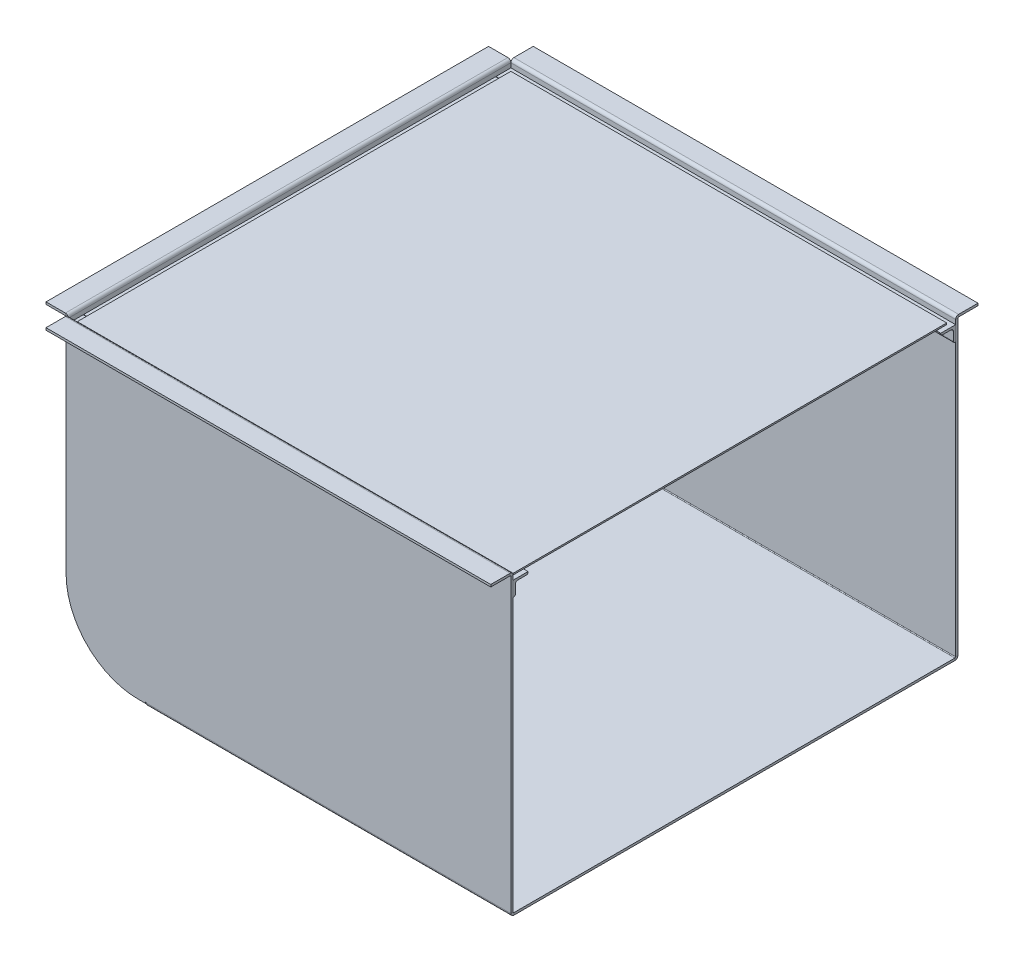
ISO-10303-21;
HEADER;
FILE_DESCRIPTION(('STEP AP214'),'2;1');
FILE_NAME('part.step','',(''),(''),'','','');
FILE_SCHEMA(('AUTOMOTIVE_DESIGN { 1 0 10303 214 1 1 1 1 }'));
ENDSEC;
DATA;
#1=APPLICATION_CONTEXT('core data for automotive mechanical design processes');
#2=APPLICATION_PROTOCOL_DEFINITION('international standard','automotive_design',2000,#1);
#3=PRODUCT_CONTEXT('',#1,'mechanical');
#4=PRODUCT('Part','Part','',(#3));
#5=PRODUCT_RELATED_PRODUCT_CATEGORY('part','',(#4));
#6=PRODUCT_DEFINITION_FORMATION('','',#4);
#7=PRODUCT_DEFINITION_CONTEXT('part definition',#1,'design');
#8=PRODUCT_DEFINITION('design','',#6,#7);
#9=PRODUCT_DEFINITION_SHAPE('','',#8);
#10=(LENGTH_UNIT() NAMED_UNIT(*) SI_UNIT(.MILLI.,.METRE.));
#11=(NAMED_UNIT(*) PLANE_ANGLE_UNIT() SI_UNIT($,.RADIAN.));
#12=(NAMED_UNIT(*) SI_UNIT($,.STERADIAN.) SOLID_ANGLE_UNIT());
#13=UNCERTAINTY_MEASURE_WITH_UNIT(LENGTH_MEASURE(1.E-05),#10,'distance_accuracy_value','');
#14=(GEOMETRIC_REPRESENTATION_CONTEXT(3) GLOBAL_UNCERTAINTY_ASSIGNED_CONTEXT((#13)) GLOBAL_UNIT_ASSIGNED_CONTEXT((#10,
#11,#12)) REPRESENTATION_CONTEXT('',''));
#15=CARTESIAN_POINT('',(0.,0.,0.));
#16=DIRECTION('',(0.,0.,1.));
#17=DIRECTION('',(1.,0.,0.));
#18=AXIS2_PLACEMENT_3D('',#15,#16,#17);
#19=CARTESIAN_POINT('',(-591.,392.,-591.));
#20=DIRECTION('',(1.,0.,0.));
#21=DIRECTION('',(0.,0.,-1.));
#22=AXIS2_PLACEMENT_3D('',#19,#20,#21);
#23=PLANE('',#22);
#24=DIRECTION('',(0.,0.,1.));
#25=VECTOR('',#24,1.);
#26=CARTESIAN_POINT('',(-591.,390.,-591.));
#27=LINE('',#26,#25);
#28=CARTESIAN_POINT('',(-591.,390.,-591.));
#29=VERTEX_POINT('',#28);
#30=CARTESIAN_POINT('',(-591.,390.,-9.));
#31=VERTEX_POINT('',#30);
#32=EDGE_CURVE('E202',#29,#31,#27,.T.);
#33=ORIENTED_EDGE('',*,*,#32,.T.);
#34=DIRECTION('',(0.,-1.,0.));
#35=VECTOR('',#34,1.);
#36=CARTESIAN_POINT('',(-591.,392.,-9.));
#37=LINE('',#36,#35);
#38=CARTESIAN_POINT('',(-591.,392.,-9.));
#39=VERTEX_POINT('',#38);
#40=EDGE_CURVE('E14',#39,#31,#37,.T.);
#41=ORIENTED_EDGE('',*,*,#40,.F.);
#42=DIRECTION('',(0.,0.,1.));
#43=VECTOR('',#42,1.);
#44=CARTESIAN_POINT('',(-591.,392.,-591.));
#45=LINE('',#44,#43);
#46=CARTESIAN_POINT('',(-591.,392.,-591.));
#47=VERTEX_POINT('',#46);
#48=EDGE_CURVE('E190',#47,#39,#45,.T.);
#49=ORIENTED_EDGE('',*,*,#48,.F.);
#50=DIRECTION('',(0.,-1.,0.));
#51=VECTOR('',#50,1.);
#52=CARTESIAN_POINT('',(-591.,392.,-591.));
#53=LINE('',#52,#51);
#54=EDGE_CURVE('E198',#47,#29,#53,.T.);
#55=ORIENTED_EDGE('',*,*,#54,.T.);
#56=EDGE_LOOP('',(#33,#41,#49,#55));
#57=FACE_BOUND('',#56,.T.);
#58=ADVANCED_FACE('F139',(#57),#23,.F.);
#59=CARTESIAN_POINT('',(-591.,392.,-9.));
#60=DIRECTION('',(0.,0.,-1.));
#61=DIRECTION('',(-1.,0.,0.));
#62=AXIS2_PLACEMENT_3D('',#59,#60,#61);
#63=PLANE('',#62);
#64=DIRECTION('',(1.,0.,0.));
#65=VECTOR('',#64,1.);
#66=CARTESIAN_POINT('',(-591.,390.,-9.));
#67=LINE('',#66,#65);
#68=CARTESIAN_POINT('',(-6.,390.,-9.));
#69=VERTEX_POINT('',#68);
#70=EDGE_CURVE('E194',#31,#69,#67,.T.);
#71=ORIENTED_EDGE('',*,*,#70,.T.);
#72=DIRECTION('',(0.,-1.,0.));
#73=VECTOR('',#72,1.);
#74=CARTESIAN_POINT('',(-6.,392.,-9.));
#75=LINE('',#74,#73);
#76=CARTESIAN_POINT('',(-6.,392.,-9.));
#77=VERTEX_POINT('',#76);
#78=EDGE_CURVE('E147',#77,#69,#75,.T.);
#79=ORIENTED_EDGE('',*,*,#78,.F.);
#80=DIRECTION('',(1.,0.,0.));
#81=VECTOR('',#80,1.);
#82=CARTESIAN_POINT('',(-591.,392.,-9.));
#83=LINE('',#82,#81);
#84=EDGE_CURVE('E185',#39,#77,#83,.T.);
#85=ORIENTED_EDGE('',*,*,#84,.F.);
#86=ORIENTED_EDGE('',*,*,#40,.T.);
#87=EDGE_LOOP('',(#71,#79,#85,#86));
#88=FACE_BOUND('',#87,.T.);
#89=ADVANCED_FACE('F193',(#88),#63,.F.);
#90=CARTESIAN_POINT('',(-6.,392.,-9.));
#91=DIRECTION('',(-1.,0.,0.));
#92=DIRECTION('',(0.,0.,1.));
#93=AXIS2_PLACEMENT_3D('',#90,#91,#92);
#94=PLANE('',#93);
#95=DIRECTION('',(0.,0.,-1.));
#96=VECTOR('',#95,1.);
#97=CARTESIAN_POINT('',(-6.,390.,-9.));
#98=LINE('',#97,#96);
#99=CARTESIAN_POINT('',(-6.,390.,-591.));
#100=VERTEX_POINT('',#99);
#101=EDGE_CURVE('E172',#69,#100,#98,.T.);
#102=ORIENTED_EDGE('',*,*,#101,.T.);
#103=DIRECTION('',(0.,-1.,0.));
#104=VECTOR('',#103,1.);
#105=CARTESIAN_POINT('',(-6.,392.,-591.));
#106=LINE('',#105,#104);
#107=CARTESIAN_POINT('',(-6.,392.,-591.));
#108=VERTEX_POINT('',#107);
#109=EDGE_CURVE('E195',#108,#100,#106,.T.);
#110=ORIENTED_EDGE('',*,*,#109,.F.);
#111=DIRECTION('',(0.,0.,-1.));
#112=VECTOR('',#111,1.);
#113=CARTESIAN_POINT('',(-6.,392.,-9.));
#114=LINE('',#113,#112);
#115=EDGE_CURVE('E188',#77,#108,#114,.T.);
#116=ORIENTED_EDGE('',*,*,#115,.F.);
#117=ORIENTED_EDGE('',*,*,#78,.T.);
#118=EDGE_LOOP('',(#102,#110,#116,#117));
#119=FACE_BOUND('',#118,.T.);
#120=ADVANCED_FACE('F196',(#119),#94,.F.);
#121=CARTESIAN_POINT('',(-6.,392.,-591.));
#122=DIRECTION('',(0.,0.,1.));
#123=DIRECTION('',(1.,0.,0.));
#124=AXIS2_PLACEMENT_3D('',#121,#122,#123);
#125=PLANE('',#124);
#126=DIRECTION('',(-1.,0.,0.));
#127=VECTOR('',#126,1.);
#128=CARTESIAN_POINT('',(-6.,390.,-591.));
#129=LINE('',#128,#127);
#130=EDGE_CURVE('E178',#100,#29,#129,.T.);
#131=ORIENTED_EDGE('',*,*,#130,.T.);
#132=ORIENTED_EDGE('',*,*,#54,.F.);
#133=DIRECTION('',(-1.,0.,0.));
#134=VECTOR('',#133,1.);
#135=CARTESIAN_POINT('',(-6.,392.,-591.));
#136=LINE('',#135,#134);
#137=EDGE_CURVE('E155',#108,#47,#136,.T.);
#138=ORIENTED_EDGE('',*,*,#137,.F.);
#139=ORIENTED_EDGE('',*,*,#109,.T.);
#140=EDGE_LOOP('',(#131,#132,#138,#139));
#141=FACE_BOUND('',#140,.T.);
#142=ADVANCED_FACE('F209',(#141),#125,.F.);
#143=CARTESIAN_POINT('',(-591.,392.,-9.));
#144=DIRECTION('',(0.,1.,0.));
#145=DIRECTION('',(0.,0.,1.));
#146=AXIS2_PLACEMENT_3D('',#143,#144,#145);
#147=PLANE('',#146);
#148=ORIENTED_EDGE('',*,*,#48,.T.);
#149=ORIENTED_EDGE('',*,*,#84,.T.);
#150=ORIENTED_EDGE('',*,*,#115,.T.);
#151=ORIENTED_EDGE('',*,*,#137,.T.);
#152=EDGE_LOOP('',(#148,#149,#150,#151));
#153=FACE_BOUND('',#152,.T.);
#154=ADVANCED_FACE('F186',(#153),#147,.T.);
#155=CARTESIAN_POINT('',(-591.,390.,-9.));
#156=DIRECTION('',(0.,1.,0.));
#157=DIRECTION('',(0.,0.,1.));
#158=AXIS2_PLACEMENT_3D('',#155,#156,#157);
#159=PLANE('',#158);
#160=ORIENTED_EDGE('',*,*,#32,.F.);
#161=ORIENTED_EDGE('',*,*,#130,.F.);
#162=ORIENTED_EDGE('',*,*,#101,.F.);
#163=ORIENTED_EDGE('',*,*,#70,.F.);
#164=EDGE_LOOP('',(#160,#161,#162,#163));
#165=FACE_BOUND('',#164,.T.);
#166=ADVANCED_FACE('F212',(#165),#159,.F.);
#167=CLOSED_SHELL('',(#58,#89,#120,#142,#154,#166));
#168=MANIFOLD_SOLID_BREP('B2',#167);
#169=CARTESIAN_POINT('',(-597.,370.,-3.99999999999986));
#170=DIRECTION('',(0.,1.,0.));
#171=DIRECTION('',(0.,0.,1.));
#172=AXIS2_PLACEMENT_3D('',#169,#170,#171);
#173=PLANE('',#172);
#174=DIRECTION('',(0.,0.,1.));
#175=VECTOR('',#174,1.);
#176=CARTESIAN_POINT('',(-597.,370.,-3.99999999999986));
#177=LINE('',#176,#175);
#178=CARTESIAN_POINT('',(-597.,370.,-3.99999999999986));
#179=VERTEX_POINT('',#178);
#180=CARTESIAN_POINT('',(-597.,370.,-2.99999999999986));
#181=VERTEX_POINT('',#180);
#182=EDGE_CURVE('E381',#179,#181,#177,.T.);
#183=ORIENTED_EDGE('',*,*,#182,.F.);
#184=DIRECTION('',(1.,0.,0.));
#185=VECTOR('',#184,1.);
#186=CARTESIAN_POINT('',(-597.,370.,-3.99999999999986));
#187=LINE('',#186,#185);
#188=CARTESIAN_POINT('',(0.,370.,-3.99999999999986));
#189=VERTEX_POINT('',#188);
#190=EDGE_CURVE('E277',#179,#189,#187,.T.);
#191=ORIENTED_EDGE('',*,*,#190,.T.);
#192=DIRECTION('',(0.,0.,1.));
#193=VECTOR('',#192,1.);
#194=CARTESIAN_POINT('',(0.,370.,-3.99999999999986));
#195=LINE('',#194,#193);
#196=CARTESIAN_POINT('',(0.,370.,-2.99999999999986));
#197=VERTEX_POINT('',#196);
#198=EDGE_CURVE('E389',#189,#197,#195,.T.);
#199=ORIENTED_EDGE('',*,*,#198,.T.);
#200=DIRECTION('',(1.,0.,0.));
#201=VECTOR('',#200,1.);
#202=CARTESIAN_POINT('',(-597.,370.,-2.99999999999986));
#203=LINE('',#202,#201);
#204=EDGE_CURVE('E332',#181,#197,#203,.T.);
#205=ORIENTED_EDGE('',*,*,#204,.F.);
#206=EDGE_LOOP('',(#183,#191,#199,#205));
#207=FACE_BOUND('',#206,.T.);
#208=ADVANCED_FACE('F273',(#207),#173,.F.);
#209=CARTESIAN_POINT('',(-597.,370.,-2.99999999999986));
#210=DIRECTION('',(0.,0.,-1.));
#211=DIRECTION('',(0.,1.,0.));
#212=AXIS2_PLACEMENT_3D('',#209,#210,#211);
#213=PLANE('',#212);
#214=DIRECTION('',(0.,1.,0.));
#215=VECTOR('',#214,1.);
#216=CARTESIAN_POINT('',(-597.,370.,-2.99999999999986));
#217=LINE('',#216,#215);
#218=CARTESIAN_POINT('',(-597.,390.,-3.));
#219=VERTEX_POINT('',#218);
#220=EDGE_CURVE('E339',#181,#219,#217,.T.);
#221=ORIENTED_EDGE('',*,*,#220,.F.);
#222=ORIENTED_EDGE('',*,*,#204,.T.);
#223=DIRECTION('',(0.,1.,0.));
#224=VECTOR('',#223,1.);
#225=CARTESIAN_POINT('',(0.,370.,-2.99999999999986));
#226=LINE('',#225,#224);
#227=CARTESIAN_POINT('',(0.,390.,-3.));
#228=VERTEX_POINT('',#227);
#229=EDGE_CURVE('E388',#197,#228,#226,.T.);
#230=ORIENTED_EDGE('',*,*,#229,.T.);
#231=DIRECTION('',(1.,0.,0.));
#232=VECTOR('',#231,1.);
#233=CARTESIAN_POINT('',(-597.,390.,-3.));
#234=LINE('',#233,#232);
#235=EDGE_CURVE('E390',#219,#228,#234,.T.);
#236=ORIENTED_EDGE('',*,*,#235,.F.);
#237=EDGE_LOOP('',(#221,#222,#230,#236));
#238=FACE_BOUND('',#237,.T.);
#239=ADVANCED_FACE('F424',(#238),#213,.F.);
#240=CARTESIAN_POINT('',(-597.,390.,-3.));
#241=DIRECTION('',(0.,-1.,0.));
#242=DIRECTION('',(0.,0.,-1.));
#243=AXIS2_PLACEMENT_3D('',#240,#241,#242);
#244=PLANE('',#243);
#245=DIRECTION('',(0.,0.,-1.));
#246=VECTOR('',#245,1.);
#247=CARTESIAN_POINT('',(-597.,390.,-3.));
#248=LINE('',#247,#246);
#249=CARTESIAN_POINT('',(-597.,390.,-23.));
#250=VERTEX_POINT('',#249);
#251=EDGE_CURVE('E377',#219,#250,#248,.T.);
#252=ORIENTED_EDGE('',*,*,#251,.F.);
#253=ORIENTED_EDGE('',*,*,#235,.T.);
#254=DIRECTION('',(0.,0.,-1.));
#255=VECTOR('',#254,1.);
#256=CARTESIAN_POINT('',(0.,390.,-3.));
#257=LINE('',#256,#255);
#258=CARTESIAN_POINT('',(0.,390.,-23.));
#259=VERTEX_POINT('',#258);
#260=EDGE_CURVE('E392',#228,#259,#257,.T.);
#261=ORIENTED_EDGE('',*,*,#260,.T.);
#262=DIRECTION('',(1.,0.,0.));
#263=VECTOR('',#262,1.);
#264=CARTESIAN_POINT('',(-597.,390.,-23.));
#265=LINE('',#264,#263);
#266=EDGE_CURVE('E393',#250,#259,#265,.T.);
#267=ORIENTED_EDGE('',*,*,#266,.F.);
#268=EDGE_LOOP('',(#252,#253,#261,#267));
#269=FACE_BOUND('',#268,.T.);
#270=ADVANCED_FACE('F427',(#269),#244,.F.);
#271=CARTESIAN_POINT('',(-597.,390.,-23.));
#272=DIRECTION('',(0.,0.,1.));
#273=DIRECTION('',(0.,-1.,0.));
#274=AXIS2_PLACEMENT_3D('',#271,#272,#273);
#275=PLANE('',#274);
#276=DIRECTION('',(0.,-1.,0.));
#277=VECTOR('',#276,1.);
#278=CARTESIAN_POINT('',(-597.,390.,-23.));
#279=LINE('',#278,#277);
#280=CARTESIAN_POINT('',(-597.,389.,-23.));
#281=VERTEX_POINT('',#280);
#282=EDGE_CURVE('E374',#250,#281,#279,.T.);
#283=ORIENTED_EDGE('',*,*,#282,.F.);
#284=ORIENTED_EDGE('',*,*,#266,.T.);
#285=DIRECTION('',(0.,-1.,0.));
#286=VECTOR('',#285,1.);
#287=CARTESIAN_POINT('',(0.,390.,-23.));
#288=LINE('',#287,#286);
#289=CARTESIAN_POINT('',(0.,389.,-23.));
#290=VERTEX_POINT('',#289);
#291=EDGE_CURVE('E395',#259,#290,#288,.T.);
#292=ORIENTED_EDGE('',*,*,#291,.T.);
#293=DIRECTION('',(1.,0.,0.));
#294=VECTOR('',#293,1.);
#295=CARTESIAN_POINT('',(-597.,389.,-23.));
#296=LINE('',#295,#294);
#297=EDGE_CURVE('E396',#281,#290,#296,.T.);
#298=ORIENTED_EDGE('',*,*,#297,.F.);
#299=EDGE_LOOP('',(#283,#284,#292,#298));
#300=FACE_BOUND('',#299,.T.);
#301=ADVANCED_FACE('F429',(#300),#275,.F.);
#302=CARTESIAN_POINT('',(-597.,389.,-21.));
#303=DIRECTION('',(1.,0.,0.));
#304=DIRECTION('',(0.,0.,-1.));
#305=AXIS2_PLACEMENT_3D('',#302,#303,#304);
#306=CYLINDRICAL_SURFACE('',#305,2.);
#307=CARTESIAN_POINT('',(-597.,389.,-21.));
#308=DIRECTION('',(-1.,0.,0.));
#309=DIRECTION('',(0.,0.,1.));
#310=AXIS2_PLACEMENT_3D('',#307,#308,#309);
#311=CIRCLE('',#310,2.);
#312=CARTESIAN_POINT('',(-597.,387.,-21.));
#313=VERTEX_POINT('',#312);
#314=EDGE_CURVE('E369',#281,#313,#311,.T.);
#315=ORIENTED_EDGE('',*,*,#314,.F.);
#316=ORIENTED_EDGE('',*,*,#297,.T.);
#317=CARTESIAN_POINT('',(0.,389.,-21.));
#318=DIRECTION('',(-1.,0.,0.));
#319=DIRECTION('',(0.,0.,-1.));
#320=AXIS2_PLACEMENT_3D('',#317,#318,#319);
#321=CIRCLE('',#320,2.);
#322=CARTESIAN_POINT('',(0.,387.,-21.));
#323=VERTEX_POINT('',#322);
#324=EDGE_CURVE('E398',#290,#323,#321,.T.);
#325=ORIENTED_EDGE('',*,*,#324,.T.);
#326=DIRECTION('',(1.,0.,0.));
#327=VECTOR('',#326,1.);
#328=CARTESIAN_POINT('',(-597.,387.,-21.));
#329=LINE('',#328,#327);
#330=EDGE_CURVE('E399',#313,#323,#329,.T.);
#331=ORIENTED_EDGE('',*,*,#330,.F.);
#332=EDGE_LOOP('',(#315,#316,#325,#331));
#333=FACE_BOUND('',#332,.T.);
#334=ADVANCED_FACE('F433',(#333),#306,.T.);
#335=CARTESIAN_POINT('',(-597.,387.,-21.));
#336=DIRECTION('',(0.,1.,0.));
#337=DIRECTION('',(0.,0.,1.));
#338=AXIS2_PLACEMENT_3D('',#335,#336,#337);
#339=PLANE('',#338);
#340=DIRECTION('',(0.,0.,1.));
#341=VECTOR('',#340,1.);
#342=CARTESIAN_POINT('',(-597.,387.,-21.));
#343=LINE('',#342,#341);
#344=CARTESIAN_POINT('',(-597.,387.,-9.49999999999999));
#345=VERTEX_POINT('',#344);
#346=EDGE_CURVE('E367',#313,#345,#343,.T.);
#347=ORIENTED_EDGE('',*,*,#346,.F.);
#348=ORIENTED_EDGE('',*,*,#330,.T.);
#349=DIRECTION('',(0.,0.,1.));
#350=VECTOR('',#349,1.);
#351=CARTESIAN_POINT('',(0.,387.,-21.));
#352=LINE('',#351,#350);
#353=CARTESIAN_POINT('',(0.,387.,-9.49999999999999));
#354=VERTEX_POINT('',#353);
#355=EDGE_CURVE('E401',#323,#354,#352,.T.);
#356=ORIENTED_EDGE('',*,*,#355,.T.);
#357=DIRECTION('',(1.,0.,0.));
#358=VECTOR('',#357,1.);
#359=CARTESIAN_POINT('',(-597.,387.,-9.49999999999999));
#360=LINE('',#359,#358);
#361=EDGE_CURVE('E402',#345,#354,#360,.T.);
#362=ORIENTED_EDGE('',*,*,#361,.F.);
#363=EDGE_LOOP('',(#347,#348,#356,#362));
#364=FACE_BOUND('',#363,.T.);
#365=ADVANCED_FACE('F437',(#364),#339,.F.);
#366=CARTESIAN_POINT('',(-597.,383.5,-9.49999999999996));
#367=DIRECTION('',(1.,0.,0.));
#368=DIRECTION('',(0.,0.,-1.));
#369=AXIS2_PLACEMENT_3D('',#366,#367,#368);
#370=CYLINDRICAL_SURFACE('',#369,3.5);
#371=CARTESIAN_POINT('',(-597.,383.5,-9.49999999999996));
#372=DIRECTION('',(-1.,0.,0.));
#373=DIRECTION('',(0.,0.,1.));
#374=AXIS2_PLACEMENT_3D('',#371,#372,#373);
#375=CIRCLE('',#374,3.5);
#376=CARTESIAN_POINT('',(-597.,383.5,-5.99999999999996));
#377=VERTEX_POINT('',#376);
#378=EDGE_CURVE('E282',#345,#377,#375,.F.);
#379=ORIENTED_EDGE('',*,*,#378,.F.);
#380=ORIENTED_EDGE('',*,*,#361,.T.);
#381=CARTESIAN_POINT('',(0.,383.5,-9.49999999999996));
#382=DIRECTION('',(1.,0.,0.));
#383=DIRECTION('',(0.,0.,1.));
#384=AXIS2_PLACEMENT_3D('',#381,#382,#383);
#385=CIRCLE('',#384,3.5);
#386=CARTESIAN_POINT('',(0.,383.5,-5.99999999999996));
#387=VERTEX_POINT('',#386);
#388=EDGE_CURVE('E361',#354,#387,#385,.T.);
#389=ORIENTED_EDGE('',*,*,#388,.T.);
#390=DIRECTION('',(1.,0.,0.));
#391=VECTOR('',#390,1.);
#392=CARTESIAN_POINT('',(-597.,383.5,-5.99999999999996));
#393=LINE('',#392,#391);
#394=EDGE_CURVE('E352',#377,#387,#393,.T.);
#395=ORIENTED_EDGE('',*,*,#394,.F.);
#396=EDGE_LOOP('',(#379,#380,#389,#395));
#397=FACE_BOUND('',#396,.T.);
#398=ADVANCED_FACE('F358',(#397),#370,.F.);
#399=CARTESIAN_POINT('',(-597.,383.5,-5.99999999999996));
#400=DIRECTION('',(0.,0.,1.));
#401=DIRECTION('',(0.,-1.,0.));
#402=AXIS2_PLACEMENT_3D('',#399,#400,#401);
#403=PLANE('',#402);
#404=DIRECTION('',(0.,-1.,0.));
#405=VECTOR('',#404,1.);
#406=CARTESIAN_POINT('',(-597.,383.5,-5.99999999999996));
#407=LINE('',#406,#405);
#408=CARTESIAN_POINT('',(-597.,372.,-5.99999999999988));
#409=VERTEX_POINT('',#408);
#410=EDGE_CURVE('E137',#377,#409,#407,.T.);
#411=ORIENTED_EDGE('',*,*,#410,.F.);
#412=ORIENTED_EDGE('',*,*,#394,.T.);
#413=DIRECTION('',(0.,-1.,0.));
#414=VECTOR('',#413,1.);
#415=CARTESIAN_POINT('',(0.,383.5,-5.99999999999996));
#416=LINE('',#415,#414);
#417=CARTESIAN_POINT('',(0.,372.,-5.99999999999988));
#418=VERTEX_POINT('',#417);
#419=EDGE_CURVE('E363',#387,#418,#416,.T.);
#420=ORIENTED_EDGE('',*,*,#419,.T.);
#421=DIRECTION('',(1.,0.,0.));
#422=VECTOR('',#421,1.);
#423=CARTESIAN_POINT('',(-597.,372.,-5.99999999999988));
#424=LINE('',#423,#422);
#425=EDGE_CURVE('E295',#409,#418,#424,.T.);
#426=ORIENTED_EDGE('',*,*,#425,.F.);
#427=EDGE_LOOP('',(#411,#412,#420,#426));
#428=FACE_BOUND('',#427,.T.);
#429=ADVANCED_FACE('F351',(#428),#403,.F.);
#430=CARTESIAN_POINT('',(-597.,372.,-3.99999999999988));
#431=DIRECTION('',(1.,0.,0.));
#432=DIRECTION('',(0.,0.,-1.));
#433=AXIS2_PLACEMENT_3D('',#430,#431,#432);
#434=CYLINDRICAL_SURFACE('',#433,2.);
#435=CARTESIAN_POINT('',(-597.,372.,-3.99999999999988));
#436=DIRECTION('',(-1.,0.,0.));
#437=DIRECTION('',(0.,0.,1.));
#438=AXIS2_PLACEMENT_3D('',#435,#436,#437);
#439=CIRCLE('',#438,2.);
#440=EDGE_CURVE('E384',#409,#179,#439,.T.);
#441=ORIENTED_EDGE('',*,*,#440,.F.);
#442=ORIENTED_EDGE('',*,*,#425,.T.);
#443=CARTESIAN_POINT('',(0.,372.,-3.99999999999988));
#444=DIRECTION('',(-1.,0.,0.));
#445=DIRECTION('',(0.,0.,-1.));
#446=AXIS2_PLACEMENT_3D('',#443,#444,#445);
#447=CIRCLE('',#446,2.);
#448=EDGE_CURVE('E386',#418,#189,#447,.T.);
#449=ORIENTED_EDGE('',*,*,#448,.T.);
#450=ORIENTED_EDGE('',*,*,#190,.F.);
#451=EDGE_LOOP('',(#441,#442,#449,#450));
#452=FACE_BOUND('',#451,.T.);
#453=ADVANCED_FACE('F419',(#452),#434,.T.);
#454=CARTESIAN_POINT('',(0.,389.,-21.));
#455=DIRECTION('',(-1.,0.,0.));
#456=DIRECTION('',(0.,0.,-1.));
#457=AXIS2_PLACEMENT_3D('',#454,#455,#456);
#458=PLANE('',#457);
#459=ORIENTED_EDGE('',*,*,#198,.F.);
#460=ORIENTED_EDGE('',*,*,#448,.F.);
#461=ORIENTED_EDGE('',*,*,#419,.F.);
#462=ORIENTED_EDGE('',*,*,#388,.F.);
#463=ORIENTED_EDGE('',*,*,#355,.F.);
#464=ORIENTED_EDGE('',*,*,#324,.F.);
#465=ORIENTED_EDGE('',*,*,#291,.F.);
#466=ORIENTED_EDGE('',*,*,#260,.F.);
#467=ORIENTED_EDGE('',*,*,#229,.F.);
#468=EDGE_LOOP('',(#459,#460,#461,#462,#463,#464,#465,#466,#467));
#469=FACE_BOUND('',#468,.T.);
#470=ADVANCED_FACE('F421',(#469),#458,.F.);
#471=CARTESIAN_POINT('',(-597.,370.,-3.));
#472=DIRECTION('',(-1.,0.,0.));
#473=DIRECTION('',(0.,0.,1.));
#474=AXIS2_PLACEMENT_3D('',#471,#472,#473);
#475=PLANE('',#474);
#476=ORIENTED_EDGE('',*,*,#440,.T.);
#477=ORIENTED_EDGE('',*,*,#182,.T.);
#478=ORIENTED_EDGE('',*,*,#220,.T.);
#479=ORIENTED_EDGE('',*,*,#251,.T.);
#480=ORIENTED_EDGE('',*,*,#282,.T.);
#481=ORIENTED_EDGE('',*,*,#314,.T.);
#482=ORIENTED_EDGE('',*,*,#346,.T.);
#483=ORIENTED_EDGE('',*,*,#378,.T.);
#484=ORIENTED_EDGE('',*,*,#410,.T.);
#485=EDGE_LOOP('',(#476,#477,#478,#479,#480,#481,#482,#483,#484));
#486=FACE_BOUND('',#485,.T.);
#487=ADVANCED_FACE('F275',(#486),#475,.T.);
#488=CLOSED_SHELL('',(#208,#239,#270,#301,#334,#365,#398,#429,#453,#470,#487));
#489=MANIFOLD_SOLID_BREP('B8',#488);
#490=CARTESIAN_POINT('',(-596.,370.,-597.));
#491=DIRECTION('',(0.,1.,0.));
#492=DIRECTION('',(-1.,0.,0.));
#493=AXIS2_PLACEMENT_3D('',#490,#491,#492);
#494=PLANE('',#493);
#495=DIRECTION('',(1.,0.,0.));
#496=VECTOR('',#495,1.);
#497=CARTESIAN_POINT('',(-596.,370.,-6.49999999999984));
#498=LINE('',#497,#496);
#499=CARTESIAN_POINT('',(-597.,370.,-6.49999999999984));
#500=VERTEX_POINT('',#499);
#501=CARTESIAN_POINT('',(-596.,370.,-6.49999999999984));
#502=VERTEX_POINT('',#501);
#503=EDGE_CURVE('E671',#500,#502,#498,.T.);
#504=ORIENTED_EDGE('',*,*,#503,.F.);
#505=DIRECTION('',(0.,0.,1.));
#506=VECTOR('',#505,1.);
#507=CARTESIAN_POINT('',(-597.,370.,-597.));
#508=LINE('',#507,#506);
#509=CARTESIAN_POINT('',(-597.,370.,-593.5));
#510=VERTEX_POINT('',#509);
#511=EDGE_CURVE('E691',#510,#500,#508,.T.);
#512=ORIENTED_EDGE('',*,*,#511,.F.);
#513=DIRECTION('',(-1.,0.,0.));
#514=VECTOR('',#513,1.);
#515=CARTESIAN_POINT('',(-596.,370.,-593.5));
#516=LINE('',#515,#514);
#517=CARTESIAN_POINT('',(-596.,370.,-593.5));
#518=VERTEX_POINT('',#517);
#519=EDGE_CURVE('E690',#518,#510,#516,.T.);
#520=ORIENTED_EDGE('',*,*,#519,.F.);
#521=DIRECTION('',(0.,0.,1.));
#522=VECTOR('',#521,1.);
#523=CARTESIAN_POINT('',(-596.,370.,-597.));
#524=LINE('',#523,#522);
#525=EDGE_CURVE('E574',#518,#502,#524,.T.);
#526=ORIENTED_EDGE('',*,*,#525,.T.);
#527=EDGE_LOOP('',(#504,#512,#520,#526));
#528=FACE_BOUND('',#527,.T.);
#529=ADVANCED_FACE('F571',(#528),#494,.F.);
#530=CARTESIAN_POINT('',(-597.,370.,-597.));
#531=DIRECTION('',(1.,0.,0.));
#532=DIRECTION('',(0.,1.,0.));
#533=AXIS2_PLACEMENT_3D('',#530,#531,#532);
#534=PLANE('',#533);
#535=DIRECTION('',(0.,-1.,0.));
#536=VECTOR('',#535,1.);
#537=CARTESIAN_POINT('',(-597.,370.000000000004,-23.4999999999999));
#538=LINE('',#537,#536);
#539=CARTESIAN_POINT('',(-597.,390.,-23.5));
#540=VERTEX_POINT('',#539);
#541=CARTESIAN_POINT('',(-597.,386.5,-23.5));
#542=VERTEX_POINT('',#541);
#543=EDGE_CURVE('E727',#540,#542,#538,.T.);
#544=ORIENTED_EDGE('',*,*,#543,.F.);
#545=DIRECTION('',(0.,0.,1.));
#546=VECTOR('',#545,1.);
#547=CARTESIAN_POINT('',(-597.,390.,-597.));
#548=LINE('',#547,#546);
#549=CARTESIAN_POINT('',(-597.,390.,-576.5));
#550=VERTEX_POINT('',#549);
#551=EDGE_CURVE('E692',#550,#540,#548,.T.);
#552=ORIENTED_EDGE('',*,*,#551,.F.);
#553=DIRECTION('',(0.,1.,0.));
#554=VECTOR('',#553,1.);
#555=CARTESIAN_POINT('',(-597.,370.,-576.5));
#556=LINE('',#555,#554);
#557=CARTESIAN_POINT('',(-597.,386.5,-576.5));
#558=VERTEX_POINT('',#557);
#559=EDGE_CURVE('E714',#558,#550,#556,.T.);
#560=ORIENTED_EDGE('',*,*,#559,.F.);
#561=DIRECTION('',(0.,0.,1.));
#562=VECTOR('',#561,1.);
#563=CARTESIAN_POINT('',(-597.,386.5,-597.));
#564=LINE('',#563,#562);
#565=CARTESIAN_POINT('',(-597.,386.5,-590.292893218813));
#566=VERTEX_POINT('',#565);
#567=EDGE_CURVE('E751',#566,#558,#564,.T.);
#568=ORIENTED_EDGE('',*,*,#567,.F.);
#569=DIRECTION('',(0.,0.707106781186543,0.707106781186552));
#570=VECTOR('',#569,1.);
#571=CARTESIAN_POINT('',(-597.,374.896446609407,-601.896446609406));
#572=LINE('',#571,#570);
#573=CARTESIAN_POINT('',(-597.,383.292893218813,-593.5));
#574=VERTEX_POINT('',#573);
#575=EDGE_CURVE('E768',#574,#566,#572,.T.);
#576=ORIENTED_EDGE('',*,*,#575,.F.);
#577=DIRECTION('',(0.,1.,0.));
#578=VECTOR('',#577,1.);
#579=CARTESIAN_POINT('',(-597.,370.,-593.5));
#580=LINE('',#579,#578);
#581=EDGE_CURVE('E771',#510,#574,#580,.T.);
#582=ORIENTED_EDGE('',*,*,#581,.F.);
#583=ORIENTED_EDGE('',*,*,#511,.T.);
#584=DIRECTION('',(0.,-1.,0.));
#585=VECTOR('',#584,1.);
#586=CARTESIAN_POINT('',(-597.,370.000000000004,-6.49999999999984));
#587=LINE('',#586,#585);
#588=CARTESIAN_POINT('',(-597.,383.292893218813,-6.49999999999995));
#589=VERTEX_POINT('',#588);
#590=EDGE_CURVE('E675',#589,#500,#587,.T.);
#591=ORIENTED_EDGE('',*,*,#590,.F.);
#592=DIRECTION('',(0.,-0.707106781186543,0.707106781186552));
#593=VECTOR('',#592,1.);
#594=CARTESIAN_POINT('',(-596.999999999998,671.896446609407,-295.103553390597));
#595=LINE('',#594,#593);
#596=CARTESIAN_POINT('',(-597.,386.5,-9.70710678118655));
#597=VERTEX_POINT('',#596);
#598=EDGE_CURVE('E718',#597,#589,#595,.T.);
#599=ORIENTED_EDGE('',*,*,#598,.F.);
#600=DIRECTION('',(0.,0.,1.));
#601=VECTOR('',#600,1.);
#602=CARTESIAN_POINT('',(-597.,386.499999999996,-597.));
#603=LINE('',#602,#601);
#604=EDGE_CURVE('E723',#542,#597,#603,.T.);
#605=ORIENTED_EDGE('',*,*,#604,.F.);
#606=EDGE_LOOP('',(#544,#552,#560,#568,#576,#582,#583,#591,#599,#605));
#607=FACE_BOUND('',#606,.T.);
#608=ADVANCED_FACE('F810',(#607),#534,.F.);
#609=CARTESIAN_POINT('',(-597.,390.,-597.));
#610=DIRECTION('',(0.,-1.,0.));
#611=DIRECTION('',(1.,0.,0.));
#612=AXIS2_PLACEMENT_3D('',#609,#610,#611);
#613=PLANE('',#612);
#614=DIRECTION('',(-1.,0.,0.));
#615=VECTOR('',#614,1.);
#616=CARTESIAN_POINT('',(-597.,390.,-23.5));
#617=LINE('',#616,#615);
#618=CARTESIAN_POINT('',(-577.,390.,-23.5));
#619=VERTEX_POINT('',#618);
#620=EDGE_CURVE('E735',#619,#540,#617,.T.);
#621=ORIENTED_EDGE('',*,*,#620,.F.);
#622=DIRECTION('',(0.,0.,1.));
#623=VECTOR('',#622,1.);
#624=CARTESIAN_POINT('',(-577.,390.,-597.));
#625=LINE('',#624,#623);
#626=CARTESIAN_POINT('',(-577.,390.,-576.5));
#627=VERTEX_POINT('',#626);
#628=EDGE_CURVE('E696',#627,#619,#625,.T.);
#629=ORIENTED_EDGE('',*,*,#628,.F.);
#630=DIRECTION('',(1.,0.,0.));
#631=VECTOR('',#630,1.);
#632=CARTESIAN_POINT('',(-597.,390.,-576.5));
#633=LINE('',#632,#631);
#634=EDGE_CURVE('E760',#550,#627,#633,.T.);
#635=ORIENTED_EDGE('',*,*,#634,.F.);
#636=ORIENTED_EDGE('',*,*,#551,.T.);
#637=EDGE_LOOP('',(#621,#629,#635,#636));
#638=FACE_BOUND('',#637,.T.);
#639=ADVANCED_FACE('F817',(#638),#613,.F.);
#640=CARTESIAN_POINT('',(-577.,390.,-597.));
#641=DIRECTION('',(-1.,0.,0.));
#642=DIRECTION('',(0.,-1.,0.));
#643=AXIS2_PLACEMENT_3D('',#640,#641,#642);
#644=PLANE('',#643);
#645=DIRECTION('',(0.,1.,0.));
#646=VECTOR('',#645,1.);
#647=CARTESIAN_POINT('',(-577.,390.000000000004,-23.5));
#648=LINE('',#647,#646);
#649=CARTESIAN_POINT('',(-577.,389.,-23.5));
#650=VERTEX_POINT('',#649);
#651=EDGE_CURVE('E740',#650,#619,#648,.T.);
#652=ORIENTED_EDGE('',*,*,#651,.F.);
#653=DIRECTION('',(0.,0.,1.));
#654=VECTOR('',#653,1.);
#655=CARTESIAN_POINT('',(-577.,389.,-597.));
#656=LINE('',#655,#654);
#657=CARTESIAN_POINT('',(-577.,389.,-576.5));
#658=VERTEX_POINT('',#657);
#659=EDGE_CURVE('E701',#658,#650,#656,.T.);
#660=ORIENTED_EDGE('',*,*,#659,.F.);
#661=DIRECTION('',(0.,-1.,0.));
#662=VECTOR('',#661,1.);
#663=CARTESIAN_POINT('',(-577.,390.,-576.5));
#664=LINE('',#663,#662);
#665=EDGE_CURVE('E762',#627,#658,#664,.T.);
#666=ORIENTED_EDGE('',*,*,#665,.F.);
#667=ORIENTED_EDGE('',*,*,#628,.T.);
#668=EDGE_LOOP('',(#652,#660,#666,#667));
#669=FACE_BOUND('',#668,.T.);
#670=ADVANCED_FACE('F820',(#669),#644,.F.);
#671=CARTESIAN_POINT('',(-579.,389.,-597.));
#672=DIRECTION('',(0.,0.,1.));
#673=DIRECTION('',(1.,0.,0.));
#674=AXIS2_PLACEMENT_3D('',#671,#672,#673);
#675=CYLINDRICAL_SURFACE('',#674,2.);
#676=CARTESIAN_POINT('',(-579.,389.,-23.5));
#677=DIRECTION('',(0.,0.,1.));
#678=DIRECTION('',(0.,-1.,0.));
#679=AXIS2_PLACEMENT_3D('',#676,#677,#678);
#680=CIRCLE('',#679,2.);
#681=CARTESIAN_POINT('',(-579.,387.,-23.5));
#682=VERTEX_POINT('',#681);
#683=EDGE_CURVE('E738',#682,#650,#680,.T.);
#684=ORIENTED_EDGE('',*,*,#683,.F.);
#685=DIRECTION('',(0.,0.,1.));
#686=VECTOR('',#685,1.);
#687=CARTESIAN_POINT('',(-579.,387.,-597.));
#688=LINE('',#687,#686);
#689=CARTESIAN_POINT('',(-579.,387.,-576.5));
#690=VERTEX_POINT('',#689);
#691=EDGE_CURVE('E704',#690,#682,#688,.T.);
#692=ORIENTED_EDGE('',*,*,#691,.F.);
#693=CARTESIAN_POINT('',(-579.,389.,-576.5));
#694=DIRECTION('',(0.,0.,-1.));
#695=DIRECTION('',(0.,1.,0.));
#696=AXIS2_PLACEMENT_3D('',#693,#694,#695);
#697=CIRCLE('',#696,2.);
#698=EDGE_CURVE('E764',#658,#690,#697,.T.);
#699=ORIENTED_EDGE('',*,*,#698,.F.);
#700=ORIENTED_EDGE('',*,*,#659,.T.);
#701=EDGE_LOOP('',(#684,#692,#699,#700));
#702=FACE_BOUND('',#701,.T.);
#703=ADVANCED_FACE('F824',(#702),#675,.T.);
#704=CARTESIAN_POINT('',(-579.,387.,-597.));
#705=DIRECTION('',(0.,1.,0.));
#706=DIRECTION('',(-1.,0.,0.));
#707=AXIS2_PLACEMENT_3D('',#704,#705,#706);
#708=PLANE('',#707);
#709=DIRECTION('',(1.,0.,0.));
#710=VECTOR('',#709,1.);
#711=CARTESIAN_POINT('',(-579.,387.,-23.5));
#712=LINE('',#711,#710);
#713=CARTESIAN_POINT('',(-590.5,387.,-23.5));
#714=VERTEX_POINT('',#713);
#715=EDGE_CURVE('E736',#714,#682,#712,.T.);
#716=ORIENTED_EDGE('',*,*,#715,.F.);
#717=DIRECTION('',(0.,0.,1.));
#718=VECTOR('',#717,1.);
#719=CARTESIAN_POINT('',(-590.5,387.,-597.));
#720=LINE('',#719,#718);
#721=CARTESIAN_POINT('',(-590.5,387.,-576.5));
#722=VERTEX_POINT('',#721);
#723=EDGE_CURVE('E707',#722,#714,#720,.T.);
#724=ORIENTED_EDGE('',*,*,#723,.F.);
#725=DIRECTION('',(-1.,0.,0.));
#726=VECTOR('',#725,1.);
#727=CARTESIAN_POINT('',(-579.,387.,-576.5));
#728=LINE('',#727,#726);
#729=EDGE_CURVE('E747',#690,#722,#728,.T.);
#730=ORIENTED_EDGE('',*,*,#729,.F.);
#731=ORIENTED_EDGE('',*,*,#691,.T.);
#732=EDGE_LOOP('',(#716,#724,#730,#731));
#733=FACE_BOUND('',#732,.T.);
#734=ADVANCED_FACE('F793',(#733),#708,.F.);
#735=CARTESIAN_POINT('',(-590.5,383.5,-597.));
#736=DIRECTION('',(0.,0.,1.));
#737=DIRECTION('',(1.,0.,0.));
#738=AXIS2_PLACEMENT_3D('',#735,#736,#737);
#739=CYLINDRICAL_SURFACE('',#738,3.5);
#740=CARTESIAN_POINT('',(-590.5,383.5,-23.5));
#741=DIRECTION('',(0.,0.,1.));
#742=DIRECTION('',(0.,-1.,0.));
#743=AXIS2_PLACEMENT_3D('',#740,#741,#742);
#744=CIRCLE('',#743,3.5);
#745=CARTESIAN_POINT('',(-592.302775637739,386.5,-23.5));
#746=VERTEX_POINT('',#745);
#747=EDGE_CURVE('E726',#746,#714,#744,.F.);
#748=ORIENTED_EDGE('',*,*,#747,.F.);
#749=DIRECTION('',(0.,0.,1.));
#750=VECTOR('',#749,1.);
#751=CARTESIAN_POINT('',(-592.302775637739,386.499999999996,-597.));
#752=LINE('',#751,#750);
#753=CARTESIAN_POINT('',(-592.302775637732,386.5,-9.70710678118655));
#754=VERTEX_POINT('',#753);
#755=EDGE_CURVE('E722',#754,#746,#752,.F.);
#756=ORIENTED_EDGE('',*,*,#755,.F.);
#757=CARTESIAN_POINT('',(-590.5,383.5,-6.70710678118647));
#758=DIRECTION('',(0.,0.707106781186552,0.707106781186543));
#759=DIRECTION('',(0.,-0.707106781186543,0.707106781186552));
#760=AXIS2_PLACEMENT_3D('',#757,#758,#759);
#761=ELLIPSE('',#760,4.94974746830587,3.5);
#762=CARTESIAN_POINT('',(-594.,383.5,-6.70710678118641));
#763=VERTEX_POINT('',#762);
#764=EDGE_CURVE('E730',#763,#754,#761,.F.);
#765=ORIENTED_EDGE('',*,*,#764,.F.);
#766=DIRECTION('',(0.,0.,1.));
#767=VECTOR('',#766,1.);
#768=CARTESIAN_POINT('',(-594.,383.5,-597.));
#769=LINE('',#768,#767);
#770=CARTESIAN_POINT('',(-594.,383.5,-593.292893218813));
#771=VERTEX_POINT('',#770);
#772=EDGE_CURVE('E710',#771,#763,#769,.T.);
#773=ORIENTED_EDGE('',*,*,#772,.F.);
#774=CARTESIAN_POINT('',(-590.5,383.5,-593.292893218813));
#775=DIRECTION('',(0.,0.707106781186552,-0.707106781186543));
#776=DIRECTION('',(0.,0.707106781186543,0.707106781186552));
#777=AXIS2_PLACEMENT_3D('',#774,#775,#776);
#778=ELLIPSE('',#777,4.94974746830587,3.5);
#779=CARTESIAN_POINT('',(-592.302775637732,386.5,-590.292893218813));
#780=VERTEX_POINT('',#779);
#781=EDGE_CURVE('E755',#780,#771,#778,.F.);
#782=ORIENTED_EDGE('',*,*,#781,.F.);
#783=DIRECTION('',(0.,0.,1.));
#784=VECTOR('',#783,1.);
#785=CARTESIAN_POINT('',(-592.302775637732,386.5,-597.));
#786=LINE('',#785,#784);
#787=CARTESIAN_POINT('',(-592.302775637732,386.5,-576.5));
#788=VERTEX_POINT('',#787);
#789=EDGE_CURVE('E748',#788,#780,#786,.F.);
#790=ORIENTED_EDGE('',*,*,#789,.F.);
#791=CARTESIAN_POINT('',(-590.5,383.5,-576.5));
#792=DIRECTION('',(0.,0.,-1.));
#793=DIRECTION('',(0.,1.,0.));
#794=AXIS2_PLACEMENT_3D('',#791,#792,#793);
#795=CIRCLE('',#794,3.5);
#796=EDGE_CURVE('E744',#722,#788,#795,.F.);
#797=ORIENTED_EDGE('',*,*,#796,.F.);
#798=ORIENTED_EDGE('',*,*,#723,.T.);
#799=EDGE_LOOP('',(#748,#756,#765,#773,#782,#790,#797,#798));
#800=FACE_BOUND('',#799,.T.);
#801=ADVANCED_FACE('F797',(#800),#739,.F.);
#802=CARTESIAN_POINT('',(-594.,383.5,-597.));
#803=DIRECTION('',(-1.,0.,0.));
#804=DIRECTION('',(0.,-1.,0.));
#805=AXIS2_PLACEMENT_3D('',#802,#803,#804);
#806=PLANE('',#805);
#807=DIRECTION('',(0.,0.707106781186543,-0.707106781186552));
#808=VECTOR('',#807,1.);
#809=CARTESIAN_POINT('',(-593.999999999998,678.646446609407,-301.853553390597));
#810=LINE('',#809,#808);
#811=CARTESIAN_POINT('',(-594.,383.292893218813,-6.49999999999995));
#812=VERTEX_POINT('',#811);
#813=EDGE_CURVE('E717',#812,#763,#810,.T.);
#814=ORIENTED_EDGE('',*,*,#813,.F.);
#815=DIRECTION('',(0.,1.,0.));
#816=VECTOR('',#815,1.);
#817=CARTESIAN_POINT('',(-594.,383.500000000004,-6.49999999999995));
#818=LINE('',#817,#816);
#819=CARTESIAN_POINT('',(-594.,372.,-6.49999999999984));
#820=VERTEX_POINT('',#819);
#821=EDGE_CURVE('E271',#820,#812,#818,.T.);
#822=ORIENTED_EDGE('',*,*,#821,.F.);
#823=DIRECTION('',(0.,0.,1.));
#824=VECTOR('',#823,1.);
#825=CARTESIAN_POINT('',(-594.,372.,-597.));
#826=LINE('',#825,#824);
#827=CARTESIAN_POINT('',(-594.,372.,-593.5));
#828=VERTEX_POINT('',#827);
#829=EDGE_CURVE('E687',#828,#820,#826,.T.);
#830=ORIENTED_EDGE('',*,*,#829,.F.);
#831=DIRECTION('',(0.,-1.,0.));
#832=VECTOR('',#831,1.);
#833=CARTESIAN_POINT('',(-594.,383.5,-593.5));
#834=LINE('',#833,#832);
#835=CARTESIAN_POINT('',(-594.,383.292893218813,-593.5));
#836=VERTEX_POINT('',#835);
#837=EDGE_CURVE('E758',#836,#828,#834,.T.);
#838=ORIENTED_EDGE('',*,*,#837,.F.);
#839=DIRECTION('',(0.,-0.707106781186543,-0.707106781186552));
#840=VECTOR('',#839,1.);
#841=CARTESIAN_POINT('',(-594.,381.646446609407,-595.146446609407));
#842=LINE('',#841,#840);
#843=EDGE_CURVE('E752',#771,#836,#842,.T.);
#844=ORIENTED_EDGE('',*,*,#843,.F.);
#845=ORIENTED_EDGE('',*,*,#772,.T.);
#846=EDGE_LOOP('',(#814,#822,#830,#838,#844,#845));
#847=FACE_BOUND('',#846,.T.);
#848=ADVANCED_FACE('F837',(#847),#806,.F.);
#849=CARTESIAN_POINT('',(-596.,372.,-597.));
#850=DIRECTION('',(0.,0.,1.));
#851=DIRECTION('',(1.,0.,0.));
#852=AXIS2_PLACEMENT_3D('',#849,#850,#851);
#853=CYLINDRICAL_SURFACE('',#852,2.);
#854=CARTESIAN_POINT('',(-596.,372.,-6.49999999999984));
#855=DIRECTION('',(0.,0.,1.));
#856=DIRECTION('',(0.,-1.,0.));
#857=AXIS2_PLACEMENT_3D('',#854,#855,#856);
#858=CIRCLE('',#857,2.);
#859=EDGE_CURVE('E580',#502,#820,#858,.T.);
#860=ORIENTED_EDGE('',*,*,#859,.F.);
#861=ORIENTED_EDGE('',*,*,#525,.F.);
#862=CARTESIAN_POINT('',(-596.,372.,-593.5));
#863=DIRECTION('',(0.,0.,-1.));
#864=DIRECTION('',(0.,1.,0.));
#865=AXIS2_PLACEMENT_3D('',#862,#863,#864);
#866=CIRCLE('',#865,2.);
#867=EDGE_CURVE('E756',#828,#518,#866,.T.);
#868=ORIENTED_EDGE('',*,*,#867,.F.);
#869=ORIENTED_EDGE('',*,*,#829,.T.);
#870=EDGE_LOOP('',(#860,#861,#868,#869));
#871=FACE_BOUND('',#870,.T.);
#872=ADVANCED_FACE('F684',(#871),#853,.T.);
#873=CARTESIAN_POINT('',(0.,390.,-576.5));
#874=DIRECTION('',(0.,0.,-1.));
#875=DIRECTION('',(0.,1.,0.));
#876=AXIS2_PLACEMENT_3D('',#873,#874,#875);
#877=PLANE('',#876);
#878=ORIENTED_EDGE('',*,*,#559,.T.);
#879=ORIENTED_EDGE('',*,*,#634,.T.);
#880=ORIENTED_EDGE('',*,*,#665,.T.);
#881=ORIENTED_EDGE('',*,*,#698,.T.);
#882=ORIENTED_EDGE('',*,*,#729,.T.);
#883=ORIENTED_EDGE('',*,*,#796,.T.);
#884=DIRECTION('',(-1.,0.,0.));
#885=VECTOR('',#884,1.);
#886=CARTESIAN_POINT('',(0.,386.5,-576.5));
#887=LINE('',#886,#885);
#888=EDGE_CURVE('E746',#788,#558,#887,.T.);
#889=ORIENTED_EDGE('',*,*,#888,.T.);
#890=EDGE_LOOP('',(#878,#879,#880,#881,#882,#883,#889));
#891=FACE_BOUND('',#890,.T.);
#892=ADVANCED_FACE('F802',(#891),#877,.T.);
#893=CARTESIAN_POINT('',(0.,386.5,-579.));
#894=DIRECTION('',(0.,1.,0.));
#895=DIRECTION('',(0.,0.,1.));
#896=AXIS2_PLACEMENT_3D('',#893,#894,#895);
#897=PLANE('',#896);
#898=ORIENTED_EDGE('',*,*,#567,.T.);
#899=ORIENTED_EDGE('',*,*,#888,.F.);
#900=ORIENTED_EDGE('',*,*,#789,.T.);
#901=DIRECTION('',(-1.,0.,0.));
#902=VECTOR('',#901,1.);
#903=CARTESIAN_POINT('',(0.,386.5,-590.292893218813));
#904=LINE('',#903,#902);
#905=EDGE_CURVE('E750',#780,#566,#904,.T.);
#906=ORIENTED_EDGE('',*,*,#905,.T.);
#907=EDGE_LOOP('',(#898,#899,#900,#906));
#908=FACE_BOUND('',#907,.T.);
#909=ADVANCED_FACE('F805',(#908),#897,.T.);
#910=CARTESIAN_POINT('',(0.,383.146446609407,-593.646446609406));
#911=DIRECTION('',(0.,0.707106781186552,-0.707106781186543));
#912=DIRECTION('',(0.,0.707106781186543,0.707106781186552));
#913=AXIS2_PLACEMENT_3D('',#910,#911,#912);
#914=PLANE('',#913);
#915=ORIENTED_EDGE('',*,*,#575,.T.);
#916=ORIENTED_EDGE('',*,*,#905,.F.);
#917=ORIENTED_EDGE('',*,*,#781,.T.);
#918=ORIENTED_EDGE('',*,*,#843,.T.);
#919=DIRECTION('',(-1.,0.,0.));
#920=VECTOR('',#919,1.);
#921=CARTESIAN_POINT('',(0.,383.292893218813,-593.5));
#922=LINE('',#921,#920);
#923=EDGE_CURVE('E754',#836,#574,#922,.T.);
#924=ORIENTED_EDGE('',*,*,#923,.T.);
#925=EDGE_LOOP('',(#915,#916,#917,#918,#924));
#926=FACE_BOUND('',#925,.T.);
#927=ADVANCED_FACE('F841',(#926),#914,.T.);
#928=CARTESIAN_POINT('',(0.,383.5,-593.5));
#929=DIRECTION('',(0.,0.,-1.));
#930=DIRECTION('',(0.,1.,0.));
#931=AXIS2_PLACEMENT_3D('',#928,#929,#930);
#932=PLANE('',#931);
#933=ORIENTED_EDGE('',*,*,#581,.T.);
#934=ORIENTED_EDGE('',*,*,#923,.F.);
#935=ORIENTED_EDGE('',*,*,#837,.T.);
#936=ORIENTED_EDGE('',*,*,#867,.T.);
#937=ORIENTED_EDGE('',*,*,#519,.T.);
#938=EDGE_LOOP('',(#933,#934,#935,#936,#937));
#939=FACE_BOUND('',#938,.T.);
#940=ADVANCED_FACE('F843',(#939),#932,.T.);
#941=CARTESIAN_POINT('',(-597.,390.,-23.5));
#942=DIRECTION('',(0.,0.,1.));
#943=DIRECTION('',(0.,-1.,0.));
#944=AXIS2_PLACEMENT_3D('',#941,#942,#943);
#945=PLANE('',#944);
#946=ORIENTED_EDGE('',*,*,#543,.T.);
#947=DIRECTION('',(1.,0.,0.));
#948=VECTOR('',#947,1.);
#949=CARTESIAN_POINT('',(-597.,386.5,-23.5));
#950=LINE('',#949,#948);
#951=EDGE_CURVE('E724',#542,#746,#950,.T.);
#952=ORIENTED_EDGE('',*,*,#951,.T.);
#953=ORIENTED_EDGE('',*,*,#747,.T.);
#954=ORIENTED_EDGE('',*,*,#715,.T.);
#955=ORIENTED_EDGE('',*,*,#683,.T.);
#956=ORIENTED_EDGE('',*,*,#651,.T.);
#957=ORIENTED_EDGE('',*,*,#620,.T.);
#958=EDGE_LOOP('',(#946,#952,#953,#954,#955,#956,#957));
#959=FACE_BOUND('',#958,.T.);
#960=ADVANCED_FACE('F786',(#959),#945,.T.);
#961=CARTESIAN_POINT('',(-597.,386.5,-21.));
#962=DIRECTION('',(0.,1.,0.));
#963=DIRECTION('',(0.,0.,1.));
#964=AXIS2_PLACEMENT_3D('',#961,#962,#963);
#965=PLANE('',#964);
#966=ORIENTED_EDGE('',*,*,#604,.T.);
#967=DIRECTION('',(1.,0.,0.));
#968=VECTOR('',#967,1.);
#969=CARTESIAN_POINT('',(-597.,386.5,-9.70710678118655));
#970=LINE('',#969,#968);
#971=EDGE_CURVE('E719',#597,#754,#970,.T.);
#972=ORIENTED_EDGE('',*,*,#971,.T.);
#973=ORIENTED_EDGE('',*,*,#755,.T.);
#974=ORIENTED_EDGE('',*,*,#951,.F.);
#975=EDGE_LOOP('',(#966,#972,#973,#974));
#976=FACE_BOUND('',#975,.T.);
#977=ADVANCED_FACE('F829',(#976),#965,.T.);
#978=CARTESIAN_POINT('',(-597.,383.146446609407,-6.35355339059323));
#979=DIRECTION('',(0.,0.707106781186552,0.707106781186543));
#980=DIRECTION('',(0.,-0.707106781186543,0.707106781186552));
#981=AXIS2_PLACEMENT_3D('',#978,#979,#980);
#982=PLANE('',#981);
#983=ORIENTED_EDGE('',*,*,#598,.T.);
#984=DIRECTION('',(1.,0.,0.));
#985=VECTOR('',#984,1.);
#986=CARTESIAN_POINT('',(-597.,383.292893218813,-6.49999999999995));
#987=LINE('',#986,#985);
#988=EDGE_CURVE('E715',#589,#812,#987,.T.);
#989=ORIENTED_EDGE('',*,*,#988,.T.);
#990=ORIENTED_EDGE('',*,*,#813,.T.);
#991=ORIENTED_EDGE('',*,*,#764,.T.);
#992=ORIENTED_EDGE('',*,*,#971,.F.);
#993=EDGE_LOOP('',(#983,#989,#990,#991,#992));
#994=FACE_BOUND('',#993,.T.);
#995=ADVANCED_FACE('F831',(#994),#982,.T.);
#996=CARTESIAN_POINT('',(-597.,383.5,-6.49999999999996));
#997=DIRECTION('',(0.,0.,1.));
#998=DIRECTION('',(0.,-1.,0.));
#999=AXIS2_PLACEMENT_3D('',#996,#997,#998);
#1000=PLANE('',#999);
#1001=ORIENTED_EDGE('',*,*,#590,.T.);
#1002=ORIENTED_EDGE('',*,*,#503,.T.);
#1003=ORIENTED_EDGE('',*,*,#859,.T.);
#1004=ORIENTED_EDGE('',*,*,#821,.T.);
#1005=ORIENTED_EDGE('',*,*,#988,.F.);
#1006=EDGE_LOOP('',(#1001,#1002,#1003,#1004,#1005));
#1007=FACE_BOUND('',#1006,.T.);
#1008=ADVANCED_FACE('F673',(#1007),#1000,.T.);
#1009=CLOSED_SHELL('',(#529,#608,#639,#670,#703,#734,#801,#848,#872,#892,#909,#927,#940,#960,
#977,#995,#1008));
#1010=MANIFOLD_SOLID_BREP('B131',#1009);
#1011=CARTESIAN_POINT('',(0.,370.,-596.));
#1012=DIRECTION('',(0.,1.,0.));
#1013=DIRECTION('',(0.,0.,1.));
#1014=AXIS2_PLACEMENT_3D('',#1011,#1012,#1013);
#1015=PLANE('',#1014);
#1016=DIRECTION('',(0.,0.,1.));
#1017=VECTOR('',#1016,1.);
#1018=CARTESIAN_POINT('',(-597.,370.,-596.));
#1019=LINE('',#1018,#1017);
#1020=CARTESIAN_POINT('',(-597.,370.,-597.));
#1021=VERTEX_POINT('',#1020);
#1022=CARTESIAN_POINT('',(-597.,370.,-596.));
#1023=VERTEX_POINT('',#1022);
#1024=EDGE_CURVE('E1156',#1021,#1023,#1019,.T.);
#1025=ORIENTED_EDGE('',*,*,#1024,.F.);
#1026=DIRECTION('',(-1.,0.,0.));
#1027=VECTOR('',#1026,1.);
#1028=CARTESIAN_POINT('',(0.,370.,-597.));
#1029=LINE('',#1028,#1027);
#1030=CARTESIAN_POINT('',(0.,370.,-597.));
#1031=VERTEX_POINT('',#1030);
#1032=EDGE_CURVE('E1161',#1031,#1021,#1029,.T.);
#1033=ORIENTED_EDGE('',*,*,#1032,.F.);
#1034=DIRECTION('',(0.,0.,-1.));
#1035=VECTOR('',#1034,1.);
#1036=CARTESIAN_POINT('',(0.,370.,-596.));
#1037=LINE('',#1036,#1035);
#1038=CARTESIAN_POINT('',(0.,370.,-596.));
#1039=VERTEX_POINT('',#1038);
#1040=EDGE_CURVE('E1148',#1039,#1031,#1037,.T.);
#1041=ORIENTED_EDGE('',*,*,#1040,.F.);
#1042=DIRECTION('',(-1.,0.,0.));
#1043=VECTOR('',#1042,1.);
#1044=CARTESIAN_POINT('',(0.,370.,-596.));
#1045=LINE('',#1044,#1043);
#1046=EDGE_CURVE('E1057',#1039,#1023,#1045,.T.);
#1047=ORIENTED_EDGE('',*,*,#1046,.T.);
#1048=EDGE_LOOP('',(#1025,#1033,#1041,#1047));
#1049=FACE_BOUND('',#1048,.T.);
#1050=ADVANCED_FACE('F1053',(#1049),#1015,.F.);
#1051=CARTESIAN_POINT('',(0.,370.,-597.));
#1052=DIRECTION('',(0.,0.,1.));
#1053=DIRECTION('',(0.,-1.,0.));
#1054=AXIS2_PLACEMENT_3D('',#1051,#1052,#1053);
#1055=PLANE('',#1054);
#1056=DIRECTION('',(0.,-1.,0.));
#1057=VECTOR('',#1056,1.);
#1058=CARTESIAN_POINT('',(-597.,370.,-597.));
#1059=LINE('',#1058,#1057);
#1060=CARTESIAN_POINT('',(-597.,390.,-597.));
#1061=VERTEX_POINT('',#1060);
#1062=EDGE_CURVE('E1111',#1061,#1021,#1059,.T.);
#1063=ORIENTED_EDGE('',*,*,#1062,.F.);
#1064=DIRECTION('',(-1.,0.,0.));
#1065=VECTOR('',#1064,1.);
#1066=CARTESIAN_POINT('',(0.,390.,-597.));
#1067=LINE('',#1066,#1065);
#1068=CARTESIAN_POINT('',(0.,390.,-597.));
#1069=VERTEX_POINT('',#1068);
#1070=EDGE_CURVE('E1163',#1069,#1061,#1067,.T.);
#1071=ORIENTED_EDGE('',*,*,#1070,.F.);
#1072=DIRECTION('',(0.,1.,0.));
#1073=VECTOR('',#1072,1.);
#1074=CARTESIAN_POINT('',(0.,370.,-597.));
#1075=LINE('',#1074,#1073);
#1076=EDGE_CURVE('E1103',#1031,#1069,#1075,.T.);
#1077=ORIENTED_EDGE('',*,*,#1076,.F.);
#1078=ORIENTED_EDGE('',*,*,#1032,.T.);
#1079=EDGE_LOOP('',(#1063,#1071,#1077,#1078));
#1080=FACE_BOUND('',#1079,.T.);
#1081=ADVANCED_FACE('F1214',(#1080),#1055,.F.);
#1082=CARTESIAN_POINT('',(0.,390.,-597.));
#1083=DIRECTION('',(0.,-1.,0.));
#1084=DIRECTION('',(0.,0.,-1.));
#1085=AXIS2_PLACEMENT_3D('',#1082,#1083,#1084);
#1086=PLANE('',#1085);
#1087=DIRECTION('',(0.,0.,-1.));
#1088=VECTOR('',#1087,1.);
#1089=CARTESIAN_POINT('',(-597.,390.,-597.));
#1090=LINE('',#1089,#1088);
#1091=CARTESIAN_POINT('',(-597.,390.,-577.));
#1092=VERTEX_POINT('',#1091);
#1093=EDGE_CURVE('E569',#1092,#1061,#1090,.T.);
#1094=ORIENTED_EDGE('',*,*,#1093,.F.);
#1095=DIRECTION('',(-1.,0.,0.));
#1096=VECTOR('',#1095,1.);
#1097=CARTESIAN_POINT('',(0.,390.,-577.));
#1098=LINE('',#1097,#1096);
#1099=CARTESIAN_POINT('',(0.,390.,-577.));
#1100=VERTEX_POINT('',#1099);
#1101=EDGE_CURVE('E1165',#1100,#1092,#1098,.T.);
#1102=ORIENTED_EDGE('',*,*,#1101,.F.);
#1103=DIRECTION('',(0.,0.,1.));
#1104=VECTOR('',#1103,1.);
#1105=CARTESIAN_POINT('',(0.,390.,-597.));
#1106=LINE('',#1105,#1104);
#1107=EDGE_CURVE('E1189',#1069,#1100,#1106,.T.);
#1108=ORIENTED_EDGE('',*,*,#1107,.F.);
#1109=ORIENTED_EDGE('',*,*,#1070,.T.);
#1110=EDGE_LOOP('',(#1094,#1102,#1108,#1109));
#1111=FACE_BOUND('',#1110,.T.);
#1112=ADVANCED_FACE('F1213',(#1111),#1086,.F.);
#1113=CARTESIAN_POINT('',(0.,390.,-577.));
#1114=DIRECTION('',(0.,0.,-1.));
#1115=DIRECTION('',(0.,1.,0.));
#1116=AXIS2_PLACEMENT_3D('',#1113,#1114,#1115);
#1117=PLANE('',#1116);
#1118=DIRECTION('',(0.,1.,0.));
#1119=VECTOR('',#1118,1.);
#1120=CARTESIAN_POINT('',(-597.,390.,-577.));
#1121=LINE('',#1120,#1119);
#1122=CARTESIAN_POINT('',(-597.,389.,-577.));
#1123=VERTEX_POINT('',#1122);
#1124=EDGE_CURVE('E1063',#1123,#1092,#1121,.T.);
#1125=ORIENTED_EDGE('',*,*,#1124,.F.);
#1126=DIRECTION('',(-1.,0.,0.));
#1127=VECTOR('',#1126,1.);
#1128=CARTESIAN_POINT('',(0.,389.,-577.));
#1129=LINE('',#1128,#1127);
#1130=CARTESIAN_POINT('',(0.,389.,-577.));
#1131=VERTEX_POINT('',#1130);
#1132=EDGE_CURVE('E1168',#1131,#1123,#1129,.T.);
#1133=ORIENTED_EDGE('',*,*,#1132,.F.);
#1134=DIRECTION('',(0.,-1.,0.));
#1135=VECTOR('',#1134,1.);
#1136=CARTESIAN_POINT('',(0.,390.,-577.));
#1137=LINE('',#1136,#1135);
#1138=EDGE_CURVE('E1191',#1100,#1131,#1137,.T.);
#1139=ORIENTED_EDGE('',*,*,#1138,.F.);
#1140=ORIENTED_EDGE('',*,*,#1101,.T.);
#1141=EDGE_LOOP('',(#1125,#1133,#1139,#1140));
#1142=FACE_BOUND('',#1141,.T.);
#1143=ADVANCED_FACE('F1208',(#1142),#1117,.F.);
#1144=CARTESIAN_POINT('',(0.,389.,-579.));
#1145=DIRECTION('',(-1.,0.,0.));
#1146=DIRECTION('',(0.,0.,1.));
#1147=AXIS2_PLACEMENT_3D('',#1144,#1145,#1146);
#1148=CYLINDRICAL_SURFACE('',#1147,2.);
#1149=CARTESIAN_POINT('',(-597.,389.,-579.));
#1150=DIRECTION('',(-1.,0.,0.));
#1151=DIRECTION('',(0.,0.,1.));
#1152=AXIS2_PLACEMENT_3D('',#1149,#1150,#1151);
#1153=CIRCLE('',#1152,2.);
#1154=CARTESIAN_POINT('',(-597.,387.,-579.));
#1155=VERTEX_POINT('',#1154);
#1156=EDGE_CURVE('E1180',#1155,#1123,#1153,.T.);
#1157=ORIENTED_EDGE('',*,*,#1156,.F.);
#1158=DIRECTION('',(-1.,0.,0.));
#1159=VECTOR('',#1158,1.);
#1160=CARTESIAN_POINT('',(0.,387.,-579.));
#1161=LINE('',#1160,#1159);
#1162=CARTESIAN_POINT('',(0.,387.,-579.));
#1163=VERTEX_POINT('',#1162);
#1164=EDGE_CURVE('E1171',#1163,#1155,#1161,.T.);
#1165=ORIENTED_EDGE('',*,*,#1164,.F.);
#1166=CARTESIAN_POINT('',(0.,389.,-579.));
#1167=DIRECTION('',(1.,0.,0.));
#1168=DIRECTION('',(0.,0.,1.));
#1169=AXIS2_PLACEMENT_3D('',#1166,#1167,#1168);
#1170=CIRCLE('',#1169,2.);
#1171=EDGE_CURVE('E1193',#1131,#1163,#1170,.T.);
#1172=ORIENTED_EDGE('',*,*,#1171,.F.);
#1173=ORIENTED_EDGE('',*,*,#1132,.T.);
#1174=EDGE_LOOP('',(#1157,#1165,#1172,#1173));
#1175=FACE_BOUND('',#1174,.T.);
#1176=ADVANCED_FACE('F1205',(#1175),#1148,.T.);
#1177=CARTESIAN_POINT('',(0.,387.,-579.));
#1178=DIRECTION('',(0.,1.,0.));
#1179=DIRECTION('',(0.,0.,1.));
#1180=AXIS2_PLACEMENT_3D('',#1177,#1178,#1179);
#1181=PLANE('',#1180);
#1182=DIRECTION('',(0.,0.,1.));
#1183=VECTOR('',#1182,1.);
#1184=CARTESIAN_POINT('',(-597.,387.,-579.));
#1185=LINE('',#1184,#1183);
#1186=CARTESIAN_POINT('',(-597.,387.,-590.5));
#1187=VERTEX_POINT('',#1186);
#1188=EDGE_CURVE('E1128',#1187,#1155,#1185,.T.);
#1189=ORIENTED_EDGE('',*,*,#1188,.F.);
#1190=DIRECTION('',(-1.,0.,0.));
#1191=VECTOR('',#1190,1.);
#1192=CARTESIAN_POINT('',(0.,387.,-590.5));
#1193=LINE('',#1192,#1191);
#1194=CARTESIAN_POINT('',(0.,387.,-590.5));
#1195=VERTEX_POINT('',#1194);
#1196=EDGE_CURVE('E1173',#1195,#1187,#1193,.T.);
#1197=ORIENTED_EDGE('',*,*,#1196,.F.);
#1198=DIRECTION('',(0.,0.,-1.));
#1199=VECTOR('',#1198,1.);
#1200=CARTESIAN_POINT('',(0.,387.,-579.));
#1201=LINE('',#1200,#1199);
#1202=EDGE_CURVE('E1195',#1163,#1195,#1201,.T.);
#1203=ORIENTED_EDGE('',*,*,#1202,.F.);
#1204=ORIENTED_EDGE('',*,*,#1164,.T.);
#1205=EDGE_LOOP('',(#1189,#1197,#1203,#1204));
#1206=FACE_BOUND('',#1205,.T.);
#1207=ADVANCED_FACE('F1203',(#1206),#1181,.F.);
#1208=CARTESIAN_POINT('',(0.,383.5,-590.5));
#1209=DIRECTION('',(-1.,0.,0.));
#1210=DIRECTION('',(0.,0.,1.));
#1211=AXIS2_PLACEMENT_3D('',#1208,#1209,#1210);
#1212=CYLINDRICAL_SURFACE('',#1211,3.5);
#1213=CARTESIAN_POINT('',(-597.,383.5,-590.5));
#1214=DIRECTION('',(-1.,0.,0.));
#1215=DIRECTION('',(0.,0.,1.));
#1216=AXIS2_PLACEMENT_3D('',#1213,#1214,#1215);
#1217=CIRCLE('',#1216,3.5);
#1218=CARTESIAN_POINT('',(-597.,383.5,-594.));
#1219=VERTEX_POINT('',#1218);
#1220=EDGE_CURVE('E1134',#1219,#1187,#1217,.F.);
#1221=ORIENTED_EDGE('',*,*,#1220,.F.);
#1222=DIRECTION('',(-1.,0.,0.));
#1223=VECTOR('',#1222,1.);
#1224=CARTESIAN_POINT('',(0.,383.5,-594.));
#1225=LINE('',#1224,#1223);
#1226=CARTESIAN_POINT('',(0.,383.5,-594.));
#1227=VERTEX_POINT('',#1226);
#1228=EDGE_CURVE('E1149',#1227,#1219,#1225,.T.);
#1229=ORIENTED_EDGE('',*,*,#1228,.F.);
#1230=CARTESIAN_POINT('',(0.,383.5,-590.5));
#1231=DIRECTION('',(-1.,0.,0.));
#1232=DIRECTION('',(0.,0.,-1.));
#1233=AXIS2_PLACEMENT_3D('',#1230,#1231,#1232);
#1234=CIRCLE('',#1233,3.5);
#1235=EDGE_CURVE('E1177',#1195,#1227,#1234,.T.);
#1236=ORIENTED_EDGE('',*,*,#1235,.F.);
#1237=ORIENTED_EDGE('',*,*,#1196,.T.);
#1238=EDGE_LOOP('',(#1221,#1229,#1236,#1237));
#1239=FACE_BOUND('',#1238,.T.);
#1240=ADVANCED_FACE('F1176',(#1239),#1212,.F.);
#1241=CARTESIAN_POINT('',(0.,383.5,-594.));
#1242=DIRECTION('',(0.,0.,-1.));
#1243=DIRECTION('',(0.,1.,0.));
#1244=AXIS2_PLACEMENT_3D('',#1241,#1242,#1243);
#1245=PLANE('',#1244);
#1246=DIRECTION('',(0.,1.,0.));
#1247=VECTOR('',#1246,1.);
#1248=CARTESIAN_POINT('',(-597.,383.5,-594.));
#1249=LINE('',#1248,#1247);
#1250=CARTESIAN_POINT('',(-597.,372.,-594.));
#1251=VERTEX_POINT('',#1250);
#1252=EDGE_CURVE('E1151',#1251,#1219,#1249,.T.);
#1253=ORIENTED_EDGE('',*,*,#1252,.F.);
#1254=DIRECTION('',(-1.,0.,0.));
#1255=VECTOR('',#1254,1.);
#1256=CARTESIAN_POINT('',(0.,372.,-594.));
#1257=LINE('',#1256,#1255);
#1258=CARTESIAN_POINT('',(0.,372.,-594.));
#1259=VERTEX_POINT('',#1258);
#1260=EDGE_CURVE('E1140',#1259,#1251,#1257,.T.);
#1261=ORIENTED_EDGE('',*,*,#1260,.F.);
#1262=DIRECTION('',(0.,-1.,0.));
#1263=VECTOR('',#1262,1.);
#1264=CARTESIAN_POINT('',(0.,383.5,-594.));
#1265=LINE('',#1264,#1263);
#1266=EDGE_CURVE('E1198',#1227,#1259,#1265,.T.);
#1267=ORIENTED_EDGE('',*,*,#1266,.F.);
#1268=ORIENTED_EDGE('',*,*,#1228,.T.);
#1269=EDGE_LOOP('',(#1253,#1261,#1267,#1268));
#1270=FACE_BOUND('',#1269,.T.);
#1271=ADVANCED_FACE('F1152',(#1270),#1245,.F.);
#1272=CARTESIAN_POINT('',(0.,372.,-596.));
#1273=DIRECTION('',(-1.,0.,0.));
#1274=DIRECTION('',(0.,0.,1.));
#1275=AXIS2_PLACEMENT_3D('',#1272,#1273,#1274);
#1276=CYLINDRICAL_SURFACE('',#1275,2.);
#1277=CARTESIAN_POINT('',(-597.,372.,-596.));
#1278=DIRECTION('',(-1.,0.,0.));
#1279=DIRECTION('',(0.,0.,1.));
#1280=AXIS2_PLACEMENT_3D('',#1277,#1278,#1279);
#1281=CIRCLE('',#1280,2.);
#1282=EDGE_CURVE('E1144',#1023,#1251,#1281,.T.);
#1283=ORIENTED_EDGE('',*,*,#1282,.F.);
#1284=ORIENTED_EDGE('',*,*,#1046,.F.);
#1285=CARTESIAN_POINT('',(0.,372.,-596.));
#1286=DIRECTION('',(1.,0.,0.));
#1287=DIRECTION('',(0.,0.,1.));
#1288=AXIS2_PLACEMENT_3D('',#1285,#1286,#1287);
#1289=CIRCLE('',#1288,2.);
#1290=EDGE_CURVE('E1072',#1259,#1039,#1289,.T.);
#1291=ORIENTED_EDGE('',*,*,#1290,.F.);
#1292=ORIENTED_EDGE('',*,*,#1260,.T.);
#1293=EDGE_LOOP('',(#1283,#1284,#1291,#1292));
#1294=FACE_BOUND('',#1293,.T.);
#1295=ADVANCED_FACE('F1142',(#1294),#1276,.T.);
#1296=CARTESIAN_POINT('',(0.,389.,-579.));
#1297=DIRECTION('',(1.,0.,0.));
#1298=DIRECTION('',(0.,0.,1.));
#1299=AXIS2_PLACEMENT_3D('',#1296,#1297,#1298);
#1300=PLANE('',#1299);
#1301=ORIENTED_EDGE('',*,*,#1040,.T.);
#1302=ORIENTED_EDGE('',*,*,#1076,.T.);
#1303=ORIENTED_EDGE('',*,*,#1107,.T.);
#1304=ORIENTED_EDGE('',*,*,#1138,.T.);
#1305=ORIENTED_EDGE('',*,*,#1171,.T.);
#1306=ORIENTED_EDGE('',*,*,#1202,.T.);
#1307=ORIENTED_EDGE('',*,*,#1235,.T.);
#1308=ORIENTED_EDGE('',*,*,#1266,.T.);
#1309=ORIENTED_EDGE('',*,*,#1290,.T.);
#1310=EDGE_LOOP('',(#1301,#1302,#1303,#1304,#1305,#1306,#1307,#1308,#1309));
#1311=FACE_BOUND('',#1310,.T.);
#1312=ADVANCED_FACE('F1200',(#1311),#1300,.T.);
#1313=CARTESIAN_POINT('',(-597.,390.,-597.));
#1314=DIRECTION('',(-1.,0.,0.));
#1315=DIRECTION('',(0.,0.,1.));
#1316=AXIS2_PLACEMENT_3D('',#1313,#1314,#1315);
#1317=PLANE('',#1316);
#1318=ORIENTED_EDGE('',*,*,#1062,.T.);
#1319=ORIENTED_EDGE('',*,*,#1024,.T.);
#1320=ORIENTED_EDGE('',*,*,#1282,.T.);
#1321=ORIENTED_EDGE('',*,*,#1252,.T.);
#1322=ORIENTED_EDGE('',*,*,#1220,.T.);
#1323=ORIENTED_EDGE('',*,*,#1188,.T.);
#1324=ORIENTED_EDGE('',*,*,#1156,.T.);
#1325=ORIENTED_EDGE('',*,*,#1124,.T.);
#1326=ORIENTED_EDGE('',*,*,#1093,.T.);
#1327=EDGE_LOOP('',(#1318,#1319,#1320,#1321,#1322,#1323,#1324,#1325,#1326));
#1328=FACE_BOUND('',#1327,.T.);
#1329=ADVANCED_FACE('F1055',(#1328),#1317,.T.);
#1330=CLOSED_SHELL('',(#1050,#1081,#1112,#1143,#1176,#1207,#1240,#1271,#1295,#1312,#1329));
#1331=MANIFOLD_SOLID_BREP('B265',#1330);
#1332=CARTESIAN_POINT('',(-600.,100.,-597.));
#1333=DIRECTION('',(1.,0.,0.));
#1334=DIRECTION('',(0.,0.,-1.));
#1335=AXIS2_PLACEMENT_3D('',#1332,#1333,#1334);
#1336=PLANE('',#1335);
#1337=DIRECTION('',(0.,0.,-1.));
#1338=VECTOR('',#1337,1.);
#1339=CARTESIAN_POINT('',(-600.,396.,-597.));
#1340=LINE('',#1339,#1338);
#1341=CARTESIAN_POINT('',(-600.,396.,-597.));
#1342=VERTEX_POINT('',#1341);
#1343=CARTESIAN_POINT('',(-600.,396.,-3.));
#1344=VERTEX_POINT('',#1343);
#1345=EDGE_CURVE('E1506',#1342,#1344,#1340,.F.);
#1346=ORIENTED_EDGE('',*,*,#1345,.F.);
#1347=DIRECTION('',(0.,1.,0.));
#1348=VECTOR('',#1347,1.);
#1349=CARTESIAN_POINT('',(-600.,100.,-597.));
#1350=LINE('',#1349,#1348);
#1351=CARTESIAN_POINT('',(-600.,100.,-597.));
#1352=VERTEX_POINT('',#1351);
#1353=EDGE_CURVE('E1461',#1352,#1342,#1350,.T.);
#1354=ORIENTED_EDGE('',*,*,#1353,.F.);
#1355=DIRECTION('',(0.,0.,1.));
#1356=VECTOR('',#1355,1.);
#1357=CARTESIAN_POINT('',(-600.,100.,-597.));
#1358=LINE('',#1357,#1356);
#1359=CARTESIAN_POINT('',(-600.,100.,-3.));
#1360=VERTEX_POINT('',#1359);
#1361=EDGE_CURVE('E1444',#1352,#1360,#1358,.T.);
#1362=ORIENTED_EDGE('',*,*,#1361,.T.);
#1363=DIRECTION('',(0.,1.,0.));
#1364=VECTOR('',#1363,1.);
#1365=CARTESIAN_POINT('',(-600.,100.,-3.));
#1366=LINE('',#1365,#1364);
#1367=EDGE_CURVE('E1445',#1360,#1344,#1366,.T.);
#1368=ORIENTED_EDGE('',*,*,#1367,.T.);
#1369=EDGE_LOOP('',(#1346,#1354,#1362,#1368));
#1370=FACE_BOUND('',#1369,.T.);
#1371=ADVANCED_FACE('F1350',(#1370),#1336,.F.);
#1372=CARTESIAN_POINT('',(-597.,100.,-597.));
#1373=DIRECTION('',(1.,0.,0.));
#1374=DIRECTION('',(0.,0.,-1.));
#1375=AXIS2_PLACEMENT_3D('',#1372,#1373,#1374);
#1376=PLANE('',#1375);
#1377=DIRECTION('',(0.,1.,0.));
#1378=VECTOR('',#1377,1.);
#1379=CARTESIAN_POINT('',(-597.,100.,-597.));
#1380=LINE('',#1379,#1378);
#1381=CARTESIAN_POINT('',(-597.,100.,-597.));
#1382=VERTEX_POINT('',#1381);
#1383=CARTESIAN_POINT('',(-597.,396.,-597.));
#1384=VERTEX_POINT('',#1383);
#1385=EDGE_CURVE('E1493',#1382,#1384,#1380,.T.);
#1386=ORIENTED_EDGE('',*,*,#1385,.T.);
#1387=DIRECTION('',(0.,0.,-1.));
#1388=VECTOR('',#1387,1.);
#1389=CARTESIAN_POINT('',(-597.,396.,-597.));
#1390=LINE('',#1389,#1388);
#1391=CARTESIAN_POINT('',(-597.,396.,-3.));
#1392=VERTEX_POINT('',#1391);
#1393=EDGE_CURVE('E1488',#1384,#1392,#1390,.F.);
#1394=ORIENTED_EDGE('',*,*,#1393,.T.);
#1395=DIRECTION('',(0.,1.,0.));
#1396=VECTOR('',#1395,1.);
#1397=CARTESIAN_POINT('',(-597.,100.,-3.));
#1398=LINE('',#1397,#1396);
#1399=CARTESIAN_POINT('',(-597.,100.,-3.));
#1400=VERTEX_POINT('',#1399);
#1401=EDGE_CURVE('E1448',#1400,#1392,#1398,.T.);
#1402=ORIENTED_EDGE('',*,*,#1401,.F.);
#1403=DIRECTION('',(0.,0.,1.));
#1404=VECTOR('',#1403,1.);
#1405=CARTESIAN_POINT('',(-597.,100.,-597.));
#1406=LINE('',#1405,#1404);
#1407=EDGE_CURVE('E1469',#1382,#1400,#1406,.T.);
#1408=ORIENTED_EDGE('',*,*,#1407,.F.);
#1409=EDGE_LOOP('',(#1386,#1394,#1402,#1408));
#1410=FACE_BOUND('',#1409,.T.);
#1411=ADVANCED_FACE('F1486',(#1410),#1376,.T.);
#1412=CARTESIAN_POINT('',(-500.,99.9999999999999,-597.));
#1413=DIRECTION('',(0.,0.,-1.));
#1414=DIRECTION('',(-1.,0.,0.));
#1415=AXIS2_PLACEMENT_3D('',#1412,#1413,#1414);
#1416=PLANE('',#1415);
#1417=ORIENTED_EDGE('',*,*,#1353,.T.);
#1418=DIRECTION('',(1.,0.,0.));
#1419=VECTOR('',#1418,1.);
#1420=CARTESIAN_POINT('',(-600.,396.,-597.));
#1421=LINE('',#1420,#1419);
#1422=EDGE_CURVE('E1497',#1342,#1384,#1421,.T.);
#1423=ORIENTED_EDGE('',*,*,#1422,.T.);
#1424=ORIENTED_EDGE('',*,*,#1385,.F.);
#1425=DIRECTION('',(-1.,0.,0.));
#1426=VECTOR('',#1425,1.);
#1427=CARTESIAN_POINT('',(-597.,100.,-597.));
#1428=LINE('',#1427,#1426);
#1429=EDGE_CURVE('E1359',#1382,#1352,#1428,.T.);
#1430=ORIENTED_EDGE('',*,*,#1429,.T.);
#1431=EDGE_LOOP('',(#1417,#1423,#1424,#1430));
#1432=FACE_BOUND('',#1431,.T.);
#1433=ADVANCED_FACE('F1629',(#1432),#1416,.T.);
#1434=CARTESIAN_POINT('',(-500.,0.,-597.));
#1435=DIRECTION('',(0.,0.,-1.));
#1436=DIRECTION('',(-1.,0.,0.));
#1437=AXIS2_PLACEMENT_3D('',#1434,#1435,#1436);
#1438=PLANE('',#1437);
#1439=DIRECTION('',(0.,1.,0.));
#1440=VECTOR('',#1439,1.);
#1441=CARTESIAN_POINT('',(-500.,0.,-597.));
#1442=LINE('',#1441,#1440);
#1443=CARTESIAN_POINT('',(-500.,0.,-597.));
#1444=VERTEX_POINT('',#1443);
#1445=CARTESIAN_POINT('',(-500.,3.00000000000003,-597.));
#1446=VERTEX_POINT('',#1445);
#1447=EDGE_CURVE('E1051',#1444,#1446,#1442,.T.);
#1448=ORIENTED_EDGE('',*,*,#1447,.F.);
#1449=CARTESIAN_POINT('',(-500.,99.9999999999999,-597.));
#1450=DIRECTION('',(0.,0.,-1.));
#1451=DIRECTION('',(-1.,0.,0.));
#1452=AXIS2_PLACEMENT_3D('',#1449,#1450,#1451);
#1453=CIRCLE('',#1452,99.9999999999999);
#1454=EDGE_CURVE('E1432',#1444,#1352,#1453,.T.);
#1455=ORIENTED_EDGE('',*,*,#1454,.T.);
#1456=ORIENTED_EDGE('',*,*,#1429,.F.);
#1457=CARTESIAN_POINT('',(-500.,99.9999999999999,-597.));
#1458=DIRECTION('',(0.,0.,-1.));
#1459=DIRECTION('',(-1.,0.,0.));
#1460=AXIS2_PLACEMENT_3D('',#1457,#1458,#1459);
#1461=CIRCLE('',#1460,96.9999999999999);
#1462=EDGE_CURVE('E1439',#1446,#1382,#1461,.T.);
#1463=ORIENTED_EDGE('',*,*,#1462,.F.);
#1464=EDGE_LOOP('',(#1448,#1455,#1456,#1463));
#1465=FACE_BOUND('',#1464,.T.);
#1466=ADVANCED_FACE('F1352',(#1465),#1438,.T.);
#1467=CARTESIAN_POINT('',(-597.,100.,-597.));
#1468=DIRECTION('',(0.,0.,-1.));
#1469=DIRECTION('',(-1.,0.,0.));
#1470=AXIS2_PLACEMENT_3D('',#1467,#1468,#1469);
#1471=PLANE('',#1470);
#1472=DIRECTION('',(-1.,0.,0.));
#1473=VECTOR('',#1472,1.);
#1474=CARTESIAN_POINT('',(-490.,0.,-597.));
#1475=LINE('',#1474,#1473);
#1476=CARTESIAN_POINT('',(-490.,0.,-597.));
#1477=VERTEX_POINT('',#1476);
#1478=EDGE_CURVE('E1427',#1477,#1444,#1475,.T.);
#1479=ORIENTED_EDGE('',*,*,#1478,.T.);
#1480=ORIENTED_EDGE('',*,*,#1447,.T.);
#1481=DIRECTION('',(-1.,0.,0.));
#1482=VECTOR('',#1481,1.);
#1483=CARTESIAN_POINT('',(-490.,3.,-597.));
#1484=LINE('',#1483,#1482);
#1485=CARTESIAN_POINT('',(-490.,3.,-597.));
#1486=VERTEX_POINT('',#1485);
#1487=EDGE_CURVE('E1437',#1486,#1446,#1484,.T.);
#1488=ORIENTED_EDGE('',*,*,#1487,.F.);
#1489=DIRECTION('',(0.,1.,0.));
#1490=VECTOR('',#1489,1.);
#1491=CARTESIAN_POINT('',(-490.,0.,-597.));
#1492=LINE('',#1491,#1490);
#1493=EDGE_CURVE('E1418',#1477,#1486,#1492,.T.);
#1494=ORIENTED_EDGE('',*,*,#1493,.F.);
#1495=EDGE_LOOP('',(#1479,#1480,#1488,#1494));
#1496=FACE_BOUND('',#1495,.T.);
#1497=ADVANCED_FACE('F1435',(#1496),#1471,.T.);
#1498=CARTESIAN_POINT('',(-600.,100.,-3.));
#1499=DIRECTION('',(0.,0.,1.));
#1500=DIRECTION('',(1.,0.,0.));
#1501=AXIS2_PLACEMENT_3D('',#1498,#1499,#1500);
#1502=PLANE('',#1501);
#1503=DIRECTION('',(1.,0.,0.));
#1504=VECTOR('',#1503,1.);
#1505=CARTESIAN_POINT('',(-600.,100.,-3.));
#1506=LINE('',#1505,#1504);
#1507=EDGE_CURVE('E1397',#1360,#1400,#1506,.T.);
#1508=ORIENTED_EDGE('',*,*,#1507,.F.);
#1509=CARTESIAN_POINT('',(-500.,99.9999999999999,-3.));
#1510=DIRECTION('',(0.,0.,-1.));
#1511=DIRECTION('',(-1.,0.,0.));
#1512=AXIS2_PLACEMENT_3D('',#1509,#1510,#1511);
#1513=CIRCLE('',#1512,99.9999999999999);
#1514=CARTESIAN_POINT('',(-500.,0.,-3.));
#1515=VERTEX_POINT('',#1514);
#1516=EDGE_CURVE('E1459',#1515,#1360,#1513,.T.);
#1517=ORIENTED_EDGE('',*,*,#1516,.F.);
#1518=DIRECTION('',(0.,-1.,0.));
#1519=VECTOR('',#1518,1.);
#1520=CARTESIAN_POINT('',(-500.,3.00000000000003,-3.));
#1521=LINE('',#1520,#1519);
#1522=CARTESIAN_POINT('',(-500.,3.00000000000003,-3.));
#1523=VERTEX_POINT('',#1522);
#1524=EDGE_CURVE('E1390',#1523,#1515,#1521,.T.);
#1525=ORIENTED_EDGE('',*,*,#1524,.F.);
#1526=CARTESIAN_POINT('',(-500.,99.9999999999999,-3.));
#1527=DIRECTION('',(0.,0.,-1.));
#1528=DIRECTION('',(-1.,0.,0.));
#1529=AXIS2_PLACEMENT_3D('',#1526,#1527,#1528);
#1530=CIRCLE('',#1529,96.9999999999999);
#1531=EDGE_CURVE('E1452',#1523,#1400,#1530,.T.);
#1532=ORIENTED_EDGE('',*,*,#1531,.T.);
#1533=EDGE_LOOP('',(#1508,#1517,#1525,#1532));
#1534=FACE_BOUND('',#1533,.T.);
#1535=ADVANCED_FACE('F1489',(#1534),#1502,.T.);
#1536=CARTESIAN_POINT('',(-500.,3.00000000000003,-3.));
#1537=DIRECTION('',(0.,0.,1.));
#1538=DIRECTION('',(1.,0.,0.));
#1539=AXIS2_PLACEMENT_3D('',#1536,#1537,#1538);
#1540=PLANE('',#1539);
#1541=DIRECTION('',(1.,0.,0.));
#1542=VECTOR('',#1541,1.);
#1543=CARTESIAN_POINT('',(-600.,396.,-3.));
#1544=LINE('',#1543,#1542);
#1545=EDGE_CURVE('E1449',#1344,#1392,#1544,.T.);
#1546=ORIENTED_EDGE('',*,*,#1545,.F.);
#1547=ORIENTED_EDGE('',*,*,#1367,.F.);
#1548=ORIENTED_EDGE('',*,*,#1507,.T.);
#1549=ORIENTED_EDGE('',*,*,#1401,.T.);
#1550=EDGE_LOOP('',(#1546,#1547,#1548,#1549));
#1551=FACE_BOUND('',#1550,.T.);
#1552=ADVANCED_FACE('F1476',(#1551),#1540,.T.);
#1553=CARTESIAN_POINT('',(-500.,99.9999999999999,-597.));
#1554=DIRECTION('',(0.,0.,1.));
#1555=DIRECTION('',(1.,0.,0.));
#1556=AXIS2_PLACEMENT_3D('',#1553,#1554,#1555);
#1557=CYLINDRICAL_SURFACE('',#1556,96.9999999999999);
#1558=ORIENTED_EDGE('',*,*,#1531,.F.);
#1559=DIRECTION('',(0.,0.,1.));
#1560=VECTOR('',#1559,1.);
#1561=CARTESIAN_POINT('',(-500.,3.00000000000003,-597.));
#1562=LINE('',#1561,#1560);
#1563=EDGE_CURVE('E1466',#1446,#1523,#1562,.T.);
#1564=ORIENTED_EDGE('',*,*,#1563,.F.);
#1565=ORIENTED_EDGE('',*,*,#1462,.T.);
#1566=ORIENTED_EDGE('',*,*,#1407,.T.);
#1567=EDGE_LOOP('',(#1558,#1564,#1565,#1566));
#1568=FACE_BOUND('',#1567,.T.);
#1569=ADVANCED_FACE('F1481',(#1568),#1557,.F.);
#1570=CARTESIAN_POINT('',(-490.,3.,-597.));
#1571=DIRECTION('',(0.,1.,0.));
#1572=DIRECTION('',(0.,0.,1.));
#1573=AXIS2_PLACEMENT_3D('',#1570,#1571,#1572);
#1574=PLANE('',#1573);
#1575=DIRECTION('',(-1.,0.,0.));
#1576=VECTOR('',#1575,1.);
#1577=CARTESIAN_POINT('',(-490.,3.,-3.));
#1578=LINE('',#1577,#1576);
#1579=CARTESIAN_POINT('',(-490.,3.,-3.));
#1580=VERTEX_POINT('',#1579);
#1581=EDGE_CURVE('E1454',#1580,#1523,#1578,.T.);
#1582=ORIENTED_EDGE('',*,*,#1581,.F.);
#1583=DIRECTION('',(0.,0.,1.));
#1584=VECTOR('',#1583,1.);
#1585=CARTESIAN_POINT('',(-490.,3.,-597.));
#1586=LINE('',#1585,#1584);
#1587=EDGE_CURVE('E1422',#1486,#1580,#1586,.T.);
#1588=ORIENTED_EDGE('',*,*,#1587,.F.);
#1589=ORIENTED_EDGE('',*,*,#1487,.T.);
#1590=ORIENTED_EDGE('',*,*,#1563,.T.);
#1591=EDGE_LOOP('',(#1582,#1588,#1589,#1590));
#1592=FACE_BOUND('',#1591,.T.);
#1593=ADVANCED_FACE('F1492',(#1592),#1574,.T.);
#1594=CARTESIAN_POINT('',(-490.,0.,-597.));
#1595=DIRECTION('',(1.,0.,0.));
#1596=DIRECTION('',(0.,0.,-1.));
#1597=AXIS2_PLACEMENT_3D('',#1594,#1595,#1596);
#1598=PLANE('',#1597);
#1599=DIRECTION('',(0.,1.,0.));
#1600=VECTOR('',#1599,1.);
#1601=CARTESIAN_POINT('',(-490.,0.,-3.));
#1602=LINE('',#1601,#1600);
#1603=CARTESIAN_POINT('',(-490.,0.,-3.));
#1604=VERTEX_POINT('',#1603);
#1605=EDGE_CURVE('E1420',#1604,#1580,#1602,.T.);
#1606=ORIENTED_EDGE('',*,*,#1605,.F.);
#1607=DIRECTION('',(0.,0.,1.));
#1608=VECTOR('',#1607,1.);
#1609=CARTESIAN_POINT('',(-490.,0.,-597.));
#1610=LINE('',#1609,#1608);
#1611=EDGE_CURVE('E1414',#1477,#1604,#1610,.T.);
#1612=ORIENTED_EDGE('',*,*,#1611,.F.);
#1613=ORIENTED_EDGE('',*,*,#1493,.T.);
#1614=ORIENTED_EDGE('',*,*,#1587,.T.);
#1615=EDGE_LOOP('',(#1606,#1612,#1613,#1614));
#1616=FACE_BOUND('',#1615,.T.);
#1617=ADVANCED_FACE('F1416',(#1616),#1598,.T.);
#1618=CARTESIAN_POINT('',(-490.,0.,-597.));
#1619=DIRECTION('',(0.,1.,0.));
#1620=DIRECTION('',(0.,0.,1.));
#1621=AXIS2_PLACEMENT_3D('',#1618,#1619,#1620);
#1622=PLANE('',#1621);
#1623=DIRECTION('',(-1.,0.,0.));
#1624=VECTOR('',#1623,1.);
#1625=CARTESIAN_POINT('',(-490.,0.,-3.));
#1626=LINE('',#1625,#1624);
#1627=EDGE_CURVE('E1457',#1604,#1515,#1626,.T.);
#1628=ORIENTED_EDGE('',*,*,#1627,.T.);
#1629=DIRECTION('',(0.,0.,1.));
#1630=VECTOR('',#1629,1.);
#1631=CARTESIAN_POINT('',(-500.,0.,-597.));
#1632=LINE('',#1631,#1630);
#1633=EDGE_CURVE('E1423',#1444,#1515,#1632,.T.);
#1634=ORIENTED_EDGE('',*,*,#1633,.F.);
#1635=ORIENTED_EDGE('',*,*,#1478,.F.);
#1636=ORIENTED_EDGE('',*,*,#1611,.T.);
#1637=EDGE_LOOP('',(#1628,#1634,#1635,#1636));
#1638=FACE_BOUND('',#1637,.T.);
#1639=ADVANCED_FACE('F1428',(#1638),#1622,.F.);
#1640=CARTESIAN_POINT('',(-500.,99.9999999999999,-597.));
#1641=DIRECTION('',(0.,0.,1.));
#1642=DIRECTION('',(1.,0.,0.));
#1643=AXIS2_PLACEMENT_3D('',#1640,#1641,#1642);
#1644=CYLINDRICAL_SURFACE('',#1643,99.9999999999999);
#1645=ORIENTED_EDGE('',*,*,#1516,.T.);
#1646=ORIENTED_EDGE('',*,*,#1361,.F.);
#1647=ORIENTED_EDGE('',*,*,#1454,.F.);
#1648=ORIENTED_EDGE('',*,*,#1633,.T.);
#1649=EDGE_LOOP('',(#1645,#1646,#1647,#1648));
#1650=FACE_BOUND('',#1649,.T.);
#1651=ADVANCED_FACE('F1614',(#1650),#1644,.T.);
#1652=CARTESIAN_POINT('',(-500.,99.9999999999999,-3.));
#1653=DIRECTION('',(0.,0.,-1.));
#1654=DIRECTION('',(-1.,0.,0.));
#1655=AXIS2_PLACEMENT_3D('',#1652,#1653,#1654);
#1656=PLANE('',#1655);
#1657=ORIENTED_EDGE('',*,*,#1581,.T.);
#1658=ORIENTED_EDGE('',*,*,#1524,.T.);
#1659=ORIENTED_EDGE('',*,*,#1627,.F.);
#1660=ORIENTED_EDGE('',*,*,#1605,.T.);
#1661=EDGE_LOOP('',(#1657,#1658,#1659,#1660));
#1662=FACE_BOUND('',#1661,.T.);
#1663=ADVANCED_FACE('F1616',(#1662),#1656,.F.);
#1664=CARTESIAN_POINT('',(-601.,396.,-3.));
#1665=DIRECTION('',(0.,0.,1.));
#1666=DIRECTION('',(1.,0.,0.));
#1667=AXIS2_PLACEMENT_3D('',#1664,#1665,#1666);
#1668=PLANE('',#1667);
#1669=DIRECTION('',(0.,1.,0.));
#1670=VECTOR('',#1669,1.);
#1671=CARTESIAN_POINT('',(-601.,400.,-3.));
#1672=LINE('',#1671,#1670);
#1673=CARTESIAN_POINT('',(-601.,397.,-3.));
#1674=VERTEX_POINT('',#1673);
#1675=CARTESIAN_POINT('',(-601.,400.,-3.));
#1676=VERTEX_POINT('',#1675);
#1677=EDGE_CURVE('E1519',#1674,#1676,#1672,.T.);
#1678=ORIENTED_EDGE('',*,*,#1677,.F.);
#1679=CARTESIAN_POINT('',(-601.,396.,-3.));
#1680=DIRECTION('',(0.,0.,-1.));
#1681=DIRECTION('',(-1.,0.,0.));
#1682=AXIS2_PLACEMENT_3D('',#1679,#1680,#1681);
#1683=CIRCLE('',#1682,1.);
#1684=EDGE_CURVE('E1510',#1344,#1674,#1683,.F.);
#1685=ORIENTED_EDGE('',*,*,#1684,.F.);
#1686=ORIENTED_EDGE('',*,*,#1545,.T.);
#1687=CARTESIAN_POINT('',(-601.,396.,-3.));
#1688=DIRECTION('',(0.,0.,-1.));
#1689=DIRECTION('',(-1.,0.,0.));
#1690=AXIS2_PLACEMENT_3D('',#1687,#1688,#1689);
#1691=CIRCLE('',#1690,4.);
#1692=EDGE_CURVE('E1500',#1392,#1676,#1691,.F.);
#1693=ORIENTED_EDGE('',*,*,#1692,.T.);
#1694=EDGE_LOOP('',(#1678,#1685,#1686,#1693));
#1695=FACE_BOUND('',#1694,.T.);
#1696=ADVANCED_FACE('F1596',(#1695),#1668,.T.);
#1697=CARTESIAN_POINT('',(-601.,396.,-597.));
#1698=DIRECTION('',(0.,0.,1.));
#1699=DIRECTION('',(1.,0.,0.));
#1700=AXIS2_PLACEMENT_3D('',#1697,#1698,#1699);
#1701=PLANE('',#1700);
#1702=CARTESIAN_POINT('',(-601.,396.,-597.));
#1703=DIRECTION('',(0.,0.,-1.));
#1704=DIRECTION('',(-1.,0.,0.));
#1705=AXIS2_PLACEMENT_3D('',#1702,#1703,#1704);
#1706=CIRCLE('',#1705,1.);
#1707=CARTESIAN_POINT('',(-601.,397.,-597.));
#1708=VERTEX_POINT('',#1707);
#1709=EDGE_CURVE('E1503',#1708,#1342,#1706,.T.);
#1710=ORIENTED_EDGE('',*,*,#1709,.F.);
#1711=DIRECTION('',(0.,1.,0.));
#1712=VECTOR('',#1711,1.);
#1713=CARTESIAN_POINT('',(-601.,397.,-597.));
#1714=LINE('',#1713,#1712);
#1715=CARTESIAN_POINT('',(-601.,400.,-597.));
#1716=VERTEX_POINT('',#1715);
#1717=EDGE_CURVE('E1525',#1708,#1716,#1714,.T.);
#1718=ORIENTED_EDGE('',*,*,#1717,.T.);
#1719=CARTESIAN_POINT('',(-601.,396.,-597.));
#1720=DIRECTION('',(0.,0.,-1.));
#1721=DIRECTION('',(-1.,0.,0.));
#1722=AXIS2_PLACEMENT_3D('',#1719,#1720,#1721);
#1723=CIRCLE('',#1722,4.);
#1724=EDGE_CURVE('E1513',#1716,#1384,#1723,.T.);
#1725=ORIENTED_EDGE('',*,*,#1724,.T.);
#1726=ORIENTED_EDGE('',*,*,#1422,.F.);
#1727=EDGE_LOOP('',(#1710,#1718,#1725,#1726));
#1728=FACE_BOUND('',#1727,.T.);
#1729=ADVANCED_FACE('F1579',(#1728),#1701,.F.);
#1730=CARTESIAN_POINT('',(-601.,396.,-597.));
#1731=DIRECTION('',(0.,0.,-1.));
#1732=DIRECTION('',(0.,1.,0.));
#1733=AXIS2_PLACEMENT_3D('',#1730,#1731,#1732);
#1734=CYLINDRICAL_SURFACE('',#1733,4.);
#1735=ORIENTED_EDGE('',*,*,#1393,.F.);
#1736=ORIENTED_EDGE('',*,*,#1724,.F.);
#1737=DIRECTION('',(0.,0.,-1.));
#1738=VECTOR('',#1737,1.);
#1739=CARTESIAN_POINT('',(-601.,400.,-597.));
#1740=LINE('',#1739,#1738);
#1741=EDGE_CURVE('E1528',#1676,#1716,#1740,.T.);
#1742=ORIENTED_EDGE('',*,*,#1741,.F.);
#1743=ORIENTED_EDGE('',*,*,#1692,.F.);
#1744=EDGE_LOOP('',(#1735,#1736,#1742,#1743));
#1745=FACE_BOUND('',#1744,.T.);
#1746=ADVANCED_FACE('F1591',(#1745),#1734,.T.);
#1747=CARTESIAN_POINT('',(-601.,396.,-597.));
#1748=DIRECTION('',(0.,0.,-1.));
#1749=DIRECTION('',(0.,1.,0.));
#1750=AXIS2_PLACEMENT_3D('',#1747,#1748,#1749);
#1751=CYLINDRICAL_SURFACE('',#1750,1.);
#1752=ORIENTED_EDGE('',*,*,#1345,.T.);
#1753=ORIENTED_EDGE('',*,*,#1684,.T.);
#1754=DIRECTION('',(0.,0.,1.));
#1755=VECTOR('',#1754,1.);
#1756=CARTESIAN_POINT('',(-601.,397.,-3.));
#1757=LINE('',#1756,#1755);
#1758=EDGE_CURVE('E1522',#1674,#1708,#1757,.F.);
#1759=ORIENTED_EDGE('',*,*,#1758,.T.);
#1760=ORIENTED_EDGE('',*,*,#1709,.T.);
#1761=EDGE_LOOP('',(#1752,#1753,#1759,#1760));
#1762=FACE_BOUND('',#1761,.T.);
#1763=ADVANCED_FACE('F1609',(#1762),#1751,.F.);
#1764=CARTESIAN_POINT('',(-600.,400.,-597.));
#1765=DIRECTION('',(0.,0.,-1.));
#1766=DIRECTION('',(-1.,0.,0.));
#1767=AXIS2_PLACEMENT_3D('',#1764,#1765,#1766);
#1768=PLANE('',#1767);
#1769=DIRECTION('',(1.,0.,0.));
#1770=VECTOR('',#1769,1.);
#1771=CARTESIAN_POINT('',(-600.,400.,-597.));
#1772=LINE('',#1771,#1770);
#1773=CARTESIAN_POINT('',(-627.,400.,-597.));
#1774=VERTEX_POINT('',#1773);
#1775=EDGE_CURVE('E1546',#1774,#1716,#1772,.T.);
#1776=ORIENTED_EDGE('',*,*,#1775,.T.);
#1777=ORIENTED_EDGE('',*,*,#1717,.F.);
#1778=DIRECTION('',(-1.,0.,0.));
#1779=VECTOR('',#1778,1.);
#1780=CARTESIAN_POINT('',(-600.,397.,-597.));
#1781=LINE('',#1780,#1779);
#1782=CARTESIAN_POINT('',(-627.,397.,-597.));
#1783=VERTEX_POINT('',#1782);
#1784=EDGE_CURVE('E1537',#1783,#1708,#1781,.F.);
#1785=ORIENTED_EDGE('',*,*,#1784,.F.);
#1786=DIRECTION('',(0.,-1.,0.));
#1787=VECTOR('',#1786,1.);
#1788=CARTESIAN_POINT('',(-627.,400.,-597.));
#1789=LINE('',#1788,#1787);
#1790=EDGE_CURVE('E1507',#1774,#1783,#1789,.T.);
#1791=ORIENTED_EDGE('',*,*,#1790,.F.);
#1792=EDGE_LOOP('',(#1776,#1777,#1785,#1791));
#1793=FACE_BOUND('',#1792,.T.);
#1794=ADVANCED_FACE('F1573',(#1793),#1768,.T.);
#1795=CARTESIAN_POINT('',(-627.,400.,-3.));
#1796=DIRECTION('',(0.,0.,1.));
#1797=DIRECTION('',(1.,0.,0.));
#1798=AXIS2_PLACEMENT_3D('',#1795,#1796,#1797);
#1799=PLANE('',#1798);
#1800=DIRECTION('',(1.,0.,0.));
#1801=VECTOR('',#1800,1.);
#1802=CARTESIAN_POINT('',(-600.,397.,-3.));
#1803=LINE('',#1802,#1801);
#1804=CARTESIAN_POINT('',(-627.,397.,-3.));
#1805=VERTEX_POINT('',#1804);
#1806=EDGE_CURVE('E1531',#1674,#1805,#1803,.F.);
#1807=ORIENTED_EDGE('',*,*,#1806,.F.);
#1808=ORIENTED_EDGE('',*,*,#1677,.T.);
#1809=DIRECTION('',(-1.,0.,0.));
#1810=VECTOR('',#1809,1.);
#1811=CARTESIAN_POINT('',(-627.,400.,-3.));
#1812=LINE('',#1811,#1810);
#1813=CARTESIAN_POINT('',(-627.,400.,-3.));
#1814=VERTEX_POINT('',#1813);
#1815=EDGE_CURVE('E1540',#1676,#1814,#1812,.T.);
#1816=ORIENTED_EDGE('',*,*,#1815,.T.);
#1817=DIRECTION('',(0.,-1.,0.));
#1818=VECTOR('',#1817,1.);
#1819=CARTESIAN_POINT('',(-627.,400.,-3.));
#1820=LINE('',#1819,#1818);
#1821=EDGE_CURVE('E1549',#1814,#1805,#1820,.T.);
#1822=ORIENTED_EDGE('',*,*,#1821,.T.);
#1823=EDGE_LOOP('',(#1807,#1808,#1816,#1822));
#1824=FACE_BOUND('',#1823,.T.);
#1825=ADVANCED_FACE('F1599',(#1824),#1799,.T.);
#1826=CARTESIAN_POINT('',(-600.,400.,-597.));
#1827=DIRECTION('',(0.,1.,0.));
#1828=DIRECTION('',(-1.,0.,0.));
#1829=AXIS2_PLACEMENT_3D('',#1826,#1827,#1828);
#1830=PLANE('',#1829);
#1831=ORIENTED_EDGE('',*,*,#1815,.F.);
#1832=ORIENTED_EDGE('',*,*,#1741,.T.);
#1833=ORIENTED_EDGE('',*,*,#1775,.F.);
#1834=DIRECTION('',(0.,0.,-1.));
#1835=VECTOR('',#1834,1.);
#1836=CARTESIAN_POINT('',(-627.,400.,-597.));
#1837=LINE('',#1836,#1835);
#1838=EDGE_CURVE('E1543',#1814,#1774,#1837,.T.);
#1839=ORIENTED_EDGE('',*,*,#1838,.F.);
#1840=EDGE_LOOP('',(#1831,#1832,#1833,#1839));
#1841=FACE_BOUND('',#1840,.T.);
#1842=ADVANCED_FACE('F1587',(#1841),#1830,.T.);
#1843=CARTESIAN_POINT('',(-600.,397.,-597.));
#1844=DIRECTION('',(0.,1.,0.));
#1845=DIRECTION('',(-1.,0.,0.));
#1846=AXIS2_PLACEMENT_3D('',#1843,#1844,#1845);
#1847=PLANE('',#1846);
#1848=ORIENTED_EDGE('',*,*,#1758,.F.);
#1849=ORIENTED_EDGE('',*,*,#1806,.T.);
#1850=DIRECTION('',(0.,0.,1.));
#1851=VECTOR('',#1850,1.);
#1852=CARTESIAN_POINT('',(-627.,397.,-597.));
#1853=LINE('',#1852,#1851);
#1854=EDGE_CURVE('E1534',#1805,#1783,#1853,.F.);
#1855=ORIENTED_EDGE('',*,*,#1854,.T.);
#1856=ORIENTED_EDGE('',*,*,#1784,.T.);
#1857=EDGE_LOOP('',(#1848,#1849,#1855,#1856));
#1858=FACE_BOUND('',#1857,.T.);
#1859=ADVANCED_FACE('F1569',(#1858),#1847,.F.);
#1860=CARTESIAN_POINT('',(-627.,400.,-597.));
#1861=DIRECTION('',(-1.,0.,0.));
#1862=DIRECTION('',(0.,-1.,0.));
#1863=AXIS2_PLACEMENT_3D('',#1860,#1861,#1862);
#1864=PLANE('',#1863);
#1865=ORIENTED_EDGE('',*,*,#1854,.F.);
#1866=ORIENTED_EDGE('',*,*,#1821,.F.);
#1867=ORIENTED_EDGE('',*,*,#1838,.T.);
#1868=ORIENTED_EDGE('',*,*,#1790,.T.);
#1869=EDGE_LOOP('',(#1865,#1866,#1867,#1868));
#1870=FACE_BOUND('',#1869,.T.);
#1871=ADVANCED_FACE('F1557',(#1870),#1864,.T.);
#1872=CLOSED_SHELL('',(#1371,#1411,#1433,#1466,#1497,#1535,#1552,#1569,#1593,#1617,#1639,#1651,
#1663,#1696,#1729,#1746,#1763,#1794,#1825,#1842,#1859,#1871));
#1873=MANIFOLD_SOLID_BREP('B563',#1872);
#1874=CARTESIAN_POINT('',(-597.,100.,833.900972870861));
#1875=DIRECTION('',(1.,0.,0.));
#1876=DIRECTION('',(0.,1.,0.));
#1877=AXIS2_PLACEMENT_3D('',#1874,#1875,#1876);
#1878=PLANE('',#1877);
#1879=DIRECTION('',(0.,0.,1.));
#1880=VECTOR('',#1879,1.);
#1881=CARTESIAN_POINT('',(-597.,396.,-600.));
#1882=LINE('',#1881,#1880);
#1883=CARTESIAN_POINT('',(-597.,396.,-600.));
#1884=VERTEX_POINT('',#1883);
#1885=CARTESIAN_POINT('',(-597.,396.,-597.));
#1886=VERTEX_POINT('',#1885);
#1887=EDGE_CURVE('E1863',#1884,#1886,#1882,.T.);
#1888=ORIENTED_EDGE('',*,*,#1887,.F.);
#1889=DIRECTION('',(0.,-1.,0.));
#1890=VECTOR('',#1889,1.);
#1891=CARTESIAN_POINT('',(-597.,100.,-600.));
#1892=LINE('',#1891,#1890);
#1893=CARTESIAN_POINT('',(-597.,100.,-600.));
#1894=VERTEX_POINT('',#1893);
#1895=EDGE_CURVE('E2269',#1884,#1894,#1892,.T.);
#1896=ORIENTED_EDGE('',*,*,#1895,.T.);
#1897=DIRECTION('',(0.,0.,-1.));
#1898=VECTOR('',#1897,1.);
#1899=CARTESIAN_POINT('',(-597.,100.,833.900972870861));
#1900=LINE('',#1899,#1898);
#1901=CARTESIAN_POINT('',(-597.,100.,-597.));
#1902=VERTEX_POINT('',#1901);
#1903=EDGE_CURVE('E2263',#1902,#1894,#1900,.T.);
#1904=ORIENTED_EDGE('',*,*,#1903,.F.);
#1905=DIRECTION('',(0.,-1.,0.));
#1906=VECTOR('',#1905,1.);
#1907=CARTESIAN_POINT('',(-597.,100.,-597.));
#1908=LINE('',#1907,#1906);
#1909=EDGE_CURVE('E2222',#1886,#1902,#1908,.T.);
#1910=ORIENTED_EDGE('',*,*,#1909,.F.);
#1911=EDGE_LOOP('',(#1888,#1896,#1904,#1910));
#1912=FACE_BOUND('',#1911,.T.);
#1913=ADVANCED_FACE('F1838',(#1912),#1878,.F.);
#1914=CARTESIAN_POINT('',(-1.31718264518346E-13,400.,833.900972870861));
#1915=DIRECTION('',(-1.,0.,0.));
#1916=DIRECTION('',(0.,-1.,0.));
#1917=AXIS2_PLACEMENT_3D('',#1914,#1915,#1916);
#1918=PLANE('',#1917);
#1919=DIRECTION('',(0.,0.,1.));
#1920=VECTOR('',#1919,1.);
#1921=CARTESIAN_POINT('',(0.,396.,-600.));
#1922=LINE('',#1921,#1920);
#1923=CARTESIAN_POINT('',(0.,396.,-600.));
#1924=VERTEX_POINT('',#1923);
#1925=CARTESIAN_POINT('',(0.,396.,-597.));
#1926=VERTEX_POINT('',#1925);
#1927=EDGE_CURVE('E2094',#1924,#1926,#1922,.T.);
#1928=ORIENTED_EDGE('',*,*,#1927,.T.);
#1929=DIRECTION('',(0.,1.,0.));
#1930=VECTOR('',#1929,1.);
#1931=CARTESIAN_POINT('',(0.,400.,-597.));
#1932=LINE('',#1931,#1930);
#1933=CARTESIAN_POINT('',(0.,4.,-597.));
#1934=VERTEX_POINT('',#1933);
#1935=EDGE_CURVE('E2224',#1934,#1926,#1932,.T.);
#1936=ORIENTED_EDGE('',*,*,#1935,.F.);
#1937=DIRECTION('',(0.,0.,-1.));
#1938=VECTOR('',#1937,1.);
#1939=CARTESIAN_POINT('',(-1.65905814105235E-13,4.,833.90097287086));
#1940=LINE('',#1939,#1938);
#1941=CARTESIAN_POINT('',(0.,3.99999999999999,-600.));
#1942=VERTEX_POINT('',#1941);
#1943=EDGE_CURVE('E2241',#1934,#1942,#1940,.T.);
#1944=ORIENTED_EDGE('',*,*,#1943,.T.);
#1945=DIRECTION('',(0.,1.,0.));
#1946=VECTOR('',#1945,1.);
#1947=CARTESIAN_POINT('',(0.,400.,-600.));
#1948=LINE('',#1947,#1946);
#1949=EDGE_CURVE('E2244',#1942,#1924,#1948,.T.);
#1950=ORIENTED_EDGE('',*,*,#1949,.T.);
#1951=EDGE_LOOP('',(#1928,#1936,#1944,#1950));
#1952=FACE_BOUND('',#1951,.T.);
#1953=ADVANCED_FACE('F2422',(#1952),#1918,.F.);
#1954=CARTESIAN_POINT('',(-500.,100.,-600.));
#1955=DIRECTION('',(0.,0.,-1.));
#1956=DIRECTION('',(-1.,0.,0.));
#1957=AXIS2_PLACEMENT_3D('',#1954,#1955,#1956);
#1958=PLANE('',#1957);
#1959=ORIENTED_EDGE('',*,*,#1895,.F.);
#1960=DIRECTION('',(1.,0.,0.));
#1961=VECTOR('',#1960,1.);
#1962=CARTESIAN_POINT('',(0.,396.,-600.));
#1963=LINE('',#1962,#1961);
#1964=EDGE_CURVE('E1855',#1924,#1884,#1963,.F.);
#1965=ORIENTED_EDGE('',*,*,#1964,.F.);
#1966=ORIENTED_EDGE('',*,*,#1949,.F.);
#1967=DIRECTION('',(1.,0.,0.));
#1968=VECTOR('',#1967,1.);
#1969=CARTESIAN_POINT('',(0.,4.,-600.));
#1970=LINE('',#1969,#1968);
#1971=CARTESIAN_POINT('',(-490.,4.00000000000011,-600.));
#1972=VERTEX_POINT('',#1971);
#1973=EDGE_CURVE('E2271',#1972,#1942,#1970,.T.);
#1974=ORIENTED_EDGE('',*,*,#1973,.F.);
#1975=DIRECTION('',(0.,-1.,0.));
#1976=VECTOR('',#1975,1.);
#1977=CARTESIAN_POINT('',(-490.,0.,-600.));
#1978=LINE('',#1977,#1976);
#1979=CARTESIAN_POINT('',(-490.,4.60000000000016,-600.));
#1980=VERTEX_POINT('',#1979);
#1981=EDGE_CURVE('E2233',#1980,#1972,#1978,.T.);
#1982=ORIENTED_EDGE('',*,*,#1981,.F.);
#1983=CARTESIAN_POINT('',(-490.3,4.60000000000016,-600.));
#1984=DIRECTION('',(0.,0.,-1.));
#1985=DIRECTION('',(-1.,0.,0.));
#1986=AXIS2_PLACEMENT_3D('',#1983,#1984,#1985);
#1987=CIRCLE('',#1986,0.3);
#1988=CARTESIAN_POINT('',(-490.6,4.60000000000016,-600.));
#1989=VERTEX_POINT('',#1988);
#1990=EDGE_CURVE('E2249',#1989,#1980,#1987,.T.);
#1991=ORIENTED_EDGE('',*,*,#1990,.F.);
#1992=DIRECTION('',(0.,-1.,0.));
#1993=VECTOR('',#1992,1.);
#1994=CARTESIAN_POINT('',(-490.6,100.,-600.));
#1995=LINE('',#1994,#1993);
#1996=CARTESIAN_POINT('',(-490.6,3.00000000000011,-600.));
#1997=VERTEX_POINT('',#1996);
#1998=EDGE_CURVE('E2239',#1989,#1997,#1995,.T.);
#1999=ORIENTED_EDGE('',*,*,#1998,.T.);
#2000=DIRECTION('',(1.,0.,0.));
#2001=VECTOR('',#2000,1.);
#2002=CARTESIAN_POINT('',(-490.,3.00000000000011,-600.));
#2003=LINE('',#2002,#2001);
#2004=CARTESIAN_POINT('',(-500.,3.00000000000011,-600.));
#2005=VERTEX_POINT('',#2004);
#2006=EDGE_CURVE('E2260',#2005,#1997,#2003,.T.);
#2007=ORIENTED_EDGE('',*,*,#2006,.F.);
#2008=CARTESIAN_POINT('',(-500.,100.,-600.));
#2009=DIRECTION('',(0.,0.,1.));
#2010=DIRECTION('',(-1.,0.,0.));
#2011=AXIS2_PLACEMENT_3D('',#2008,#2009,#2010);
#2012=CIRCLE('',#2011,96.9999999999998);
#2013=EDGE_CURVE('E2266',#1894,#2005,#2012,.T.);
#2014=ORIENTED_EDGE('',*,*,#2013,.F.);
#2015=EDGE_LOOP('',(#1959,#1965,#1966,#1974,#1982,#1991,#1999,#2007,#2014));
#2016=FACE_BOUND('',#2015,.T.);
#2017=ADVANCED_FACE('F2427',(#2016),#1958,.T.);
#2018=CARTESIAN_POINT('',(-500.,100.,-597.));
#2019=DIRECTION('',(0.,0.,-1.));
#2020=DIRECTION('',(-1.,0.,0.));
#2021=AXIS2_PLACEMENT_3D('',#2018,#2019,#2020);
#2022=PLANE('',#2021);
#2023=DIRECTION('',(1.,0.,0.));
#2024=VECTOR('',#2023,1.);
#2025=CARTESIAN_POINT('',(0.,396.,-597.));
#2026=LINE('',#2025,#2024);
#2027=EDGE_CURVE('E2044',#1926,#1886,#2026,.F.);
#2028=ORIENTED_EDGE('',*,*,#2027,.T.);
#2029=ORIENTED_EDGE('',*,*,#1909,.T.);
#2030=CARTESIAN_POINT('',(-500.,100.,-597.));
#2031=DIRECTION('',(0.,0.,-1.));
#2032=DIRECTION('',(-1.,0.,0.));
#2033=AXIS2_PLACEMENT_3D('',#2030,#2031,#2032);
#2034=CIRCLE('',#2033,96.9999999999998);
#2035=CARTESIAN_POINT('',(-500.,3.00000000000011,-597.));
#2036=VERTEX_POINT('',#2035);
#2037=EDGE_CURVE('E2219',#1902,#2036,#2034,.F.);
#2038=ORIENTED_EDGE('',*,*,#2037,.T.);
#2039=DIRECTION('',(1.,0.,0.));
#2040=VECTOR('',#2039,1.);
#2041=CARTESIAN_POINT('',(-490.,3.00000000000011,-597.));
#2042=LINE('',#2041,#2040);
#2043=CARTESIAN_POINT('',(-490.6,3.00000000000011,-597.));
#2044=VERTEX_POINT('',#2043);
#2045=EDGE_CURVE('E2216',#2036,#2044,#2042,.T.);
#2046=ORIENTED_EDGE('',*,*,#2045,.T.);
#2047=DIRECTION('',(0.,-1.,0.));
#2048=VECTOR('',#2047,1.);
#2049=CARTESIAN_POINT('',(-490.6,100.,-597.));
#2050=LINE('',#2049,#2048);
#2051=CARTESIAN_POINT('',(-490.6,4.60000000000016,-597.));
#2052=VERTEX_POINT('',#2051);
#2053=EDGE_CURVE('E2252',#2052,#2044,#2050,.T.);
#2054=ORIENTED_EDGE('',*,*,#2053,.F.);
#2055=CARTESIAN_POINT('',(-490.3,4.60000000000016,-597.));
#2056=DIRECTION('',(0.,0.,-1.));
#2057=DIRECTION('',(-1.,0.,0.));
#2058=AXIS2_PLACEMENT_3D('',#2055,#2056,#2057);
#2059=CIRCLE('',#2058,0.3);
#2060=CARTESIAN_POINT('',(-490.,4.60000000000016,-597.));
#2061=VERTEX_POINT('',#2060);
#2062=EDGE_CURVE('E2213',#2052,#2061,#2059,.T.);
#2063=ORIENTED_EDGE('',*,*,#2062,.T.);
#2064=DIRECTION('',(0.,-1.,0.));
#2065=VECTOR('',#2064,1.);
#2066=CARTESIAN_POINT('',(-490.,100.,-597.));
#2067=LINE('',#2066,#2065);
#2068=CARTESIAN_POINT('',(-490.,4.,-597.));
#2069=VERTEX_POINT('',#2068);
#2070=EDGE_CURVE('E2230',#2061,#2069,#2067,.T.);
#2071=ORIENTED_EDGE('',*,*,#2070,.T.);
#2072=DIRECTION('',(1.,0.,0.));
#2073=VECTOR('',#2072,1.);
#2074=CARTESIAN_POINT('',(0.,4.,-597.));
#2075=LINE('',#2074,#2073);
#2076=EDGE_CURVE('E2227',#2069,#1934,#2075,.T.);
#2077=ORIENTED_EDGE('',*,*,#2076,.T.);
#2078=ORIENTED_EDGE('',*,*,#1935,.T.);
#2079=EDGE_LOOP('',(#2028,#2029,#2038,#2046,#2054,#2063,#2071,#2077,#2078));
#2080=FACE_BOUND('',#2079,.T.);
#2081=ADVANCED_FACE('F2453',(#2080),#2022,.F.);
#2082=CARTESIAN_POINT('',(-597.,100.,-1433.90097287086));
#2083=DIRECTION('',(-1.,0.,0.));
#2084=DIRECTION('',(0.,1.,0.));
#2085=AXIS2_PLACEMENT_3D('',#2082,#2083,#2084);
#2086=PLANE('',#2085);
#2087=DIRECTION('',(0.,-1.,0.));
#2088=VECTOR('',#2087,1.);
#2089=CARTESIAN_POINT('',(-597.,100.,0.));
#2090=LINE('',#2089,#2088);
#2091=CARTESIAN_POINT('',(-597.,396.,0.));
#2092=VERTEX_POINT('',#2091);
#2093=CARTESIAN_POINT('',(-597.,100.,0.));
#2094=VERTEX_POINT('',#2093);
#2095=EDGE_CURVE('E2289',#2092,#2094,#2090,.T.);
#2096=ORIENTED_EDGE('',*,*,#2095,.F.);
#2097=DIRECTION('',(0.,0.,-1.));
#2098=VECTOR('',#2097,1.);
#2099=CARTESIAN_POINT('',(-597.,396.,0.));
#2100=LINE('',#2099,#2098);
#2101=CARTESIAN_POINT('',(-597.,396.,-3.00000000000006));
#2102=VERTEX_POINT('',#2101);
#2103=EDGE_CURVE('E2142',#2092,#2102,#2100,.T.);
#2104=ORIENTED_EDGE('',*,*,#2103,.T.);
#2105=DIRECTION('',(0.,-1.,0.));
#2106=VECTOR('',#2105,1.);
#2107=CARTESIAN_POINT('',(-597.,100.,-3.));
#2108=LINE('',#2107,#2106);
#2109=CARTESIAN_POINT('',(-597.,100.,-3.));
#2110=VERTEX_POINT('',#2109);
#2111=EDGE_CURVE('E2312',#2102,#2110,#2108,.T.);
#2112=ORIENTED_EDGE('',*,*,#2111,.T.);
#2113=DIRECTION('',(0.,0.,1.));
#2114=VECTOR('',#2113,1.);
#2115=CARTESIAN_POINT('',(-597.,100.,-1433.90097287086));
#2116=LINE('',#2115,#2114);
#2117=EDGE_CURVE('E2309',#2110,#2094,#2116,.T.);
#2118=ORIENTED_EDGE('',*,*,#2117,.T.);
#2119=EDGE_LOOP('',(#2096,#2104,#2112,#2118));
#2120=FACE_BOUND('',#2119,.T.);
#2121=ADVANCED_FACE('F2380',(#2120),#2086,.T.);
#2122=CARTESIAN_POINT('',(-500.,99.9999999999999,0.));
#2123=DIRECTION('',(0.,0.,-1.));
#2124=DIRECTION('',(-1.,0.,0.));
#2125=AXIS2_PLACEMENT_3D('',#2122,#2123,#2124);
#2126=PLANE('',#2125);
#2127=DIRECTION('',(-1.,0.,0.));
#2128=VECTOR('',#2127,1.);
#2129=CARTESIAN_POINT('',(-597.,396.,0.));
#2130=LINE('',#2129,#2128);
#2131=CARTESIAN_POINT('',(0.,396.,0.));
#2132=VERTEX_POINT('',#2131);
#2133=EDGE_CURVE('E2148',#2092,#2132,#2130,.F.);
#2134=ORIENTED_EDGE('',*,*,#2133,.F.);
#2135=ORIENTED_EDGE('',*,*,#2095,.T.);
#2136=CARTESIAN_POINT('',(-500.,99.9999999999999,0.));
#2137=DIRECTION('',(0.,0.,1.));
#2138=DIRECTION('',(-1.,0.,0.));
#2139=AXIS2_PLACEMENT_3D('',#2136,#2137,#2138);
#2140=CIRCLE('',#2139,96.9999999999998);
#2141=CARTESIAN_POINT('',(-500.,3.00000000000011,0.));
#2142=VERTEX_POINT('',#2141);
#2143=EDGE_CURVE('E2286',#2094,#2142,#2140,.T.);
#2144=ORIENTED_EDGE('',*,*,#2143,.T.);
#2145=DIRECTION('',(1.,0.,0.));
#2146=VECTOR('',#2145,1.);
#2147=CARTESIAN_POINT('',(-490.,3.00000000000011,0.));
#2148=LINE('',#2147,#2146);
#2149=CARTESIAN_POINT('',(-490.6,3.,0.));
#2150=VERTEX_POINT('',#2149);
#2151=EDGE_CURVE('E2283',#2142,#2150,#2148,.T.);
#2152=ORIENTED_EDGE('',*,*,#2151,.T.);
#2153=DIRECTION('',(0.,-1.,0.));
#2154=VECTOR('',#2153,1.);
#2155=CARTESIAN_POINT('',(-490.6,99.9999999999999,0.));
#2156=LINE('',#2155,#2154);
#2157=CARTESIAN_POINT('',(-490.6,4.59999999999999,0.));
#2158=VERTEX_POINT('',#2157);
#2159=EDGE_CURVE('E2326',#2158,#2150,#2156,.T.);
#2160=ORIENTED_EDGE('',*,*,#2159,.F.);
#2161=CARTESIAN_POINT('',(-490.3,4.59999999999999,0.));
#2162=DIRECTION('',(0.,0.,-1.));
#2163=DIRECTION('',(-1.,0.,0.));
#2164=AXIS2_PLACEMENT_3D('',#2161,#2162,#2163);
#2165=CIRCLE('',#2164,0.3);
#2166=CARTESIAN_POINT('',(-490.,4.59999999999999,0.));
#2167=VERTEX_POINT('',#2166);
#2168=EDGE_CURVE('E2280',#2158,#2167,#2165,.T.);
#2169=ORIENTED_EDGE('',*,*,#2168,.T.);
#2170=DIRECTION('',(0.,-1.,0.));
#2171=VECTOR('',#2170,1.);
#2172=CARTESIAN_POINT('',(-490.,0.,0.));
#2173=LINE('',#2172,#2171);
#2174=CARTESIAN_POINT('',(-490.,4.,0.));
#2175=VERTEX_POINT('',#2174);
#2176=EDGE_CURVE('E2297',#2167,#2175,#2173,.T.);
#2177=ORIENTED_EDGE('',*,*,#2176,.T.);
#2178=DIRECTION('',(1.,0.,0.));
#2179=VECTOR('',#2178,1.);
#2180=CARTESIAN_POINT('',(-490.,4.,0.));
#2181=LINE('',#2180,#2179);
#2182=CARTESIAN_POINT('',(0.,3.99999999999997,0.));
#2183=VERTEX_POINT('',#2182);
#2184=EDGE_CURVE('E2294',#2175,#2183,#2181,.T.);
#2185=ORIENTED_EDGE('',*,*,#2184,.T.);
#2186=DIRECTION('',(0.,1.,0.));
#2187=VECTOR('',#2186,1.);
#2188=CARTESIAN_POINT('',(0.,400.,0.));
#2189=LINE('',#2188,#2187);
#2190=EDGE_CURVE('E2291',#2183,#2132,#2189,.T.);
#2191=ORIENTED_EDGE('',*,*,#2190,.T.);
#2192=EDGE_LOOP('',(#2134,#2135,#2144,#2152,#2160,#2169,#2177,#2185,#2191));
#2193=FACE_BOUND('',#2192,.T.);
#2194=ADVANCED_FACE('F2352',(#2193),#2126,.F.);
#2195=CARTESIAN_POINT('',(-500.,99.9999999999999,-3.));
#2196=DIRECTION('',(0.,0.,-1.));
#2197=DIRECTION('',(-1.,0.,0.));
#2198=AXIS2_PLACEMENT_3D('',#2195,#2196,#2197);
#2199=PLANE('',#2198);
#2200=ORIENTED_EDGE('',*,*,#2111,.F.);
#2201=DIRECTION('',(-1.,0.,0.));
#2202=VECTOR('',#2201,1.);
#2203=CARTESIAN_POINT('',(-597.,396.,-3.00000000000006));
#2204=LINE('',#2203,#2202);
#2205=CARTESIAN_POINT('',(0.,396.,-3.00000000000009));
#2206=VERTEX_POINT('',#2205);
#2207=EDGE_CURVE('E2135',#2102,#2206,#2204,.F.);
#2208=ORIENTED_EDGE('',*,*,#2207,.T.);
#2209=DIRECTION('',(0.,1.,0.));
#2210=VECTOR('',#2209,1.);
#2211=CARTESIAN_POINT('',(0.,400.,-3.00000000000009));
#2212=LINE('',#2211,#2210);
#2213=CARTESIAN_POINT('',(-4.44089209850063E-13,3.99999999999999,-3.));
#2214=VERTEX_POINT('',#2213);
#2215=EDGE_CURVE('E2277',#2214,#2206,#2212,.T.);
#2216=ORIENTED_EDGE('',*,*,#2215,.F.);
#2217=DIRECTION('',(1.,0.,0.));
#2218=VECTOR('',#2217,1.);
#2219=CARTESIAN_POINT('',(-490.,4.,-3.00000000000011));
#2220=LINE('',#2219,#2218);
#2221=CARTESIAN_POINT('',(-490.,4.,-3.));
#2222=VERTEX_POINT('',#2221);
#2223=EDGE_CURVE('E1842',#2222,#2214,#2220,.T.);
#2224=ORIENTED_EDGE('',*,*,#2223,.F.);
#2225=DIRECTION('',(0.,1.,0.));
#2226=VECTOR('',#2225,1.);
#2227=CARTESIAN_POINT('',(-490.,99.9999999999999,-3.));
#2228=LINE('',#2227,#2226);
#2229=CARTESIAN_POINT('',(-490.,4.59999999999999,-3.));
#2230=VERTEX_POINT('',#2229);
#2231=EDGE_CURVE('E1847',#2222,#2230,#2228,.T.);
#2232=ORIENTED_EDGE('',*,*,#2231,.T.);
#2233=CARTESIAN_POINT('',(-490.3,4.59999999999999,-3.));
#2234=DIRECTION('',(0.,0.,-1.));
#2235=DIRECTION('',(-1.,0.,0.));
#2236=AXIS2_PLACEMENT_3D('',#2233,#2234,#2235);
#2237=CIRCLE('',#2236,0.3);
#2238=CARTESIAN_POINT('',(-490.6,4.59999999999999,-3.));
#2239=VERTEX_POINT('',#2238);
#2240=EDGE_CURVE('E2306',#2239,#2230,#2237,.T.);
#2241=ORIENTED_EDGE('',*,*,#2240,.F.);
#2242=DIRECTION('',(0.,-1.,0.));
#2243=VECTOR('',#2242,1.);
#2244=CARTESIAN_POINT('',(-490.6,99.9999999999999,-3.));
#2245=LINE('',#2244,#2243);
#2246=CARTESIAN_POINT('',(-490.6,3.,-3.));
#2247=VERTEX_POINT('',#2246);
#2248=EDGE_CURVE('E1348',#2239,#2247,#2245,.T.);
#2249=ORIENTED_EDGE('',*,*,#2248,.T.);
#2250=DIRECTION('',(1.,0.,0.));
#2251=VECTOR('',#2250,1.);
#2252=CARTESIAN_POINT('',(0.,3.,-3.));
#2253=LINE('',#2252,#2251);
#2254=CARTESIAN_POINT('',(-500.,3.00000000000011,-3.));
#2255=VERTEX_POINT('',#2254);
#2256=EDGE_CURVE('E2323',#2255,#2247,#2253,.T.);
#2257=ORIENTED_EDGE('',*,*,#2256,.F.);
#2258=CARTESIAN_POINT('',(-500.,99.9999999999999,-3.));
#2259=DIRECTION('',(0.,0.,-1.));
#2260=DIRECTION('',(-1.,0.,0.));
#2261=AXIS2_PLACEMENT_3D('',#2258,#2259,#2260);
#2262=CIRCLE('',#2261,96.9999999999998);
#2263=EDGE_CURVE('E2317',#2110,#2255,#2262,.F.);
#2264=ORIENTED_EDGE('',*,*,#2263,.F.);
#2265=EDGE_LOOP('',(#2200,#2208,#2216,#2224,#2232,#2241,#2249,#2257,#2264));
#2266=FACE_BOUND('',#2265,.T.);
#2267=ADVANCED_FACE('F1840',(#2266),#2199,.T.);
#2268=CARTESIAN_POINT('',(-490.6,99.9999999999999,-1433.90097287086));
#2269=DIRECTION('',(-1.,0.,0.));
#2270=DIRECTION('',(0.,1.,0.));
#2271=AXIS2_PLACEMENT_3D('',#2268,#2269,#2270);
#2272=PLANE('',#2271);
#2273=DIRECTION('',(0.,0.,1.));
#2274=VECTOR('',#2273,1.);
#2275=CARTESIAN_POINT('',(-490.6,4.59999999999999,-1433.90097287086));
#2276=LINE('',#2275,#2274);
#2277=EDGE_CURVE('E2328',#2239,#2158,#2276,.T.);
#2278=ORIENTED_EDGE('',*,*,#2277,.T.);
#2279=ORIENTED_EDGE('',*,*,#2159,.T.);
#2280=DIRECTION('',(0.,0.,1.));
#2281=VECTOR('',#2280,1.);
#2282=CARTESIAN_POINT('',(-490.6,3.,-1433.90097287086));
#2283=LINE('',#2282,#2281);
#2284=EDGE_CURVE('E2320',#2247,#2150,#2283,.T.);
#2285=ORIENTED_EDGE('',*,*,#2284,.F.);
#2286=ORIENTED_EDGE('',*,*,#2248,.F.);
#2287=EDGE_LOOP('',(#2278,#2279,#2285,#2286));
#2288=FACE_BOUND('',#2287,.T.);
#2289=ADVANCED_FACE('F2368',(#2288),#2272,.F.);
#2290=CARTESIAN_POINT('',(0.,3.,-1433.90097287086));
#2291=DIRECTION('',(0.,-1.,0.));
#2292=DIRECTION('',(0.,0.,-1.));
#2293=AXIS2_PLACEMENT_3D('',#2290,#2291,#2292);
#2294=PLANE('',#2293);
#2295=ORIENTED_EDGE('',*,*,#2151,.F.);
#2296=DIRECTION('',(0.,0.,1.));
#2297=VECTOR('',#2296,1.);
#2298=CARTESIAN_POINT('',(-500.,3.00000000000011,-1433.90097287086));
#2299=LINE('',#2298,#2297);
#2300=EDGE_CURVE('E2314',#2255,#2142,#2299,.T.);
#2301=ORIENTED_EDGE('',*,*,#2300,.F.);
#2302=ORIENTED_EDGE('',*,*,#2256,.T.);
#2303=ORIENTED_EDGE('',*,*,#2284,.T.);
#2304=EDGE_LOOP('',(#2295,#2301,#2302,#2303));
#2305=FACE_BOUND('',#2304,.T.);
#2306=ADVANCED_FACE('F2373',(#2305),#2294,.T.);
#2307=CARTESIAN_POINT('',(-500.,99.9999999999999,-1433.90097287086));
#2308=DIRECTION('',(0.,0.,1.));
#2309=DIRECTION('',(0.,-1.,0.));
#2310=AXIS2_PLACEMENT_3D('',#2307,#2308,#2309);
#2311=CYLINDRICAL_SURFACE('',#2310,96.9999999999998);
#2312=ORIENTED_EDGE('',*,*,#2143,.F.);
#2313=ORIENTED_EDGE('',*,*,#2117,.F.);
#2314=ORIENTED_EDGE('',*,*,#2263,.T.);
#2315=ORIENTED_EDGE('',*,*,#2300,.T.);
#2316=EDGE_LOOP('',(#2312,#2313,#2314,#2315));
#2317=FACE_BOUND('',#2316,.T.);
#2318=ADVANCED_FACE('F2375',(#2317),#2311,.T.);
#2319=CARTESIAN_POINT('',(-490.3,4.59999999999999,-1433.90097287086));
#2320=DIRECTION('',(0.,0.,1.));
#2321=DIRECTION('',(0.,-1.,0.));
#2322=AXIS2_PLACEMENT_3D('',#2319,#2320,#2321);
#2323=CYLINDRICAL_SURFACE('',#2322,0.3);
#2324=ORIENTED_EDGE('',*,*,#2168,.F.);
#2325=ORIENTED_EDGE('',*,*,#2277,.F.);
#2326=ORIENTED_EDGE('',*,*,#2240,.T.);
#2327=DIRECTION('',(0.,0.,1.));
#2328=VECTOR('',#2327,1.);
#2329=CARTESIAN_POINT('',(-490.,4.59999999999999,-1433.90097287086));
#2330=LINE('',#2329,#2328);
#2331=EDGE_CURVE('E2303',#2230,#2167,#2330,.T.);
#2332=ORIENTED_EDGE('',*,*,#2331,.T.);
#2333=EDGE_LOOP('',(#2324,#2325,#2326,#2332));
#2334=FACE_BOUND('',#2333,.T.);
#2335=ADVANCED_FACE('F2365',(#2334),#2323,.F.);
#2336=CARTESIAN_POINT('',(-490.,99.9999999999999,-1433.90097287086));
#2337=DIRECTION('',(1.,0.,0.));
#2338=DIRECTION('',(0.,-1.,0.));
#2339=AXIS2_PLACEMENT_3D('',#2336,#2337,#2338);
#2340=PLANE('',#2339);
#2341=DIRECTION('',(0.,0.,1.));
#2342=VECTOR('',#2341,1.);
#2343=CARTESIAN_POINT('',(-490.,4.,-1433.90097287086));
#2344=LINE('',#2343,#2342);
#2345=EDGE_CURVE('E2300',#2222,#2175,#2344,.T.);
#2346=ORIENTED_EDGE('',*,*,#2345,.T.);
#2347=ORIENTED_EDGE('',*,*,#2176,.F.);
#2348=ORIENTED_EDGE('',*,*,#2331,.F.);
#2349=ORIENTED_EDGE('',*,*,#2231,.F.);
#2350=EDGE_LOOP('',(#2346,#2347,#2348,#2349));
#2351=FACE_BOUND('',#2350,.T.);
#2352=ADVANCED_FACE('F2360',(#2351),#2340,.F.);
#2353=CARTESIAN_POINT('',(0.,400.,-1433.90097287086));
#2354=DIRECTION('',(1.,0.,0.));
#2355=DIRECTION('',(0.,-1.,0.));
#2356=AXIS2_PLACEMENT_3D('',#2353,#2354,#2355);
#2357=PLANE('',#2356);
#2358=DIRECTION('',(0.,0.,-1.));
#2359=VECTOR('',#2358,1.);
#2360=CARTESIAN_POINT('',(0.,396.,0.));
#2361=LINE('',#2360,#2359);
#2362=EDGE_CURVE('E2152',#2132,#2206,#2361,.T.);
#2363=ORIENTED_EDGE('',*,*,#2362,.F.);
#2364=ORIENTED_EDGE('',*,*,#2190,.F.);
#2365=DIRECTION('',(0.,0.,1.));
#2366=VECTOR('',#2365,1.);
#2367=CARTESIAN_POINT('',(0.,3.99999999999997,-1433.90097287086));
#2368=LINE('',#2367,#2366);
#2369=EDGE_CURVE('E2330',#2214,#2183,#2368,.T.);
#2370=ORIENTED_EDGE('',*,*,#2369,.F.);
#2371=ORIENTED_EDGE('',*,*,#2215,.T.);
#2372=EDGE_LOOP('',(#2363,#2364,#2370,#2371));
#2373=FACE_BOUND('',#2372,.T.);
#2374=ADVANCED_FACE('F2349',(#2373),#2357,.T.);
#2375=CARTESIAN_POINT('',(-500.,99.9999999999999,833.900972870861));
#2376=DIRECTION('',(0.,0.,-1.));
#2377=DIRECTION('',(0.,1.,0.));
#2378=AXIS2_PLACEMENT_3D('',#2375,#2376,#2377);
#2379=CYLINDRICAL_SURFACE('',#2378,96.9999999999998);
#2380=ORIENTED_EDGE('',*,*,#2013,.T.);
#2381=DIRECTION('',(0.,0.,-1.));
#2382=VECTOR('',#2381,1.);
#2383=CARTESIAN_POINT('',(-500.,3.,833.900972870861));
#2384=LINE('',#2383,#2382);
#2385=EDGE_CURVE('E2257',#2036,#2005,#2384,.T.);
#2386=ORIENTED_EDGE('',*,*,#2385,.F.);
#2387=ORIENTED_EDGE('',*,*,#2037,.F.);
#2388=ORIENTED_EDGE('',*,*,#1903,.T.);
#2389=EDGE_LOOP('',(#2380,#2386,#2387,#2388));
#2390=FACE_BOUND('',#2389,.T.);
#2391=ADVANCED_FACE('F2434',(#2390),#2379,.T.);
#2392=CARTESIAN_POINT('',(-490.,3.,833.900972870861));
#2393=DIRECTION('',(0.,1.,0.));
#2394=DIRECTION('',(0.,0.,1.));
#2395=AXIS2_PLACEMENT_3D('',#2392,#2393,#2394);
#2396=PLANE('',#2395);
#2397=ORIENTED_EDGE('',*,*,#2006,.T.);
#2398=DIRECTION('',(0.,0.,-1.));
#2399=VECTOR('',#2398,1.);
#2400=CARTESIAN_POINT('',(-490.6,3.,833.900972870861));
#2401=LINE('',#2400,#2399);
#2402=EDGE_CURVE('E2254',#2044,#1997,#2401,.T.);
#2403=ORIENTED_EDGE('',*,*,#2402,.F.);
#2404=ORIENTED_EDGE('',*,*,#2045,.F.);
#2405=ORIENTED_EDGE('',*,*,#2385,.T.);
#2406=EDGE_LOOP('',(#2397,#2403,#2404,#2405));
#2407=FACE_BOUND('',#2406,.T.);
#2408=ADVANCED_FACE('F2437',(#2407),#2396,.F.);
#2409=CARTESIAN_POINT('',(-490.6,99.9999999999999,833.900972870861));
#2410=DIRECTION('',(1.,0.,0.));
#2411=DIRECTION('',(0.,1.,0.));
#2412=AXIS2_PLACEMENT_3D('',#2409,#2410,#2411);
#2413=PLANE('',#2412);
#2414=ORIENTED_EDGE('',*,*,#2402,.T.);
#2415=ORIENTED_EDGE('',*,*,#1998,.F.);
#2416=DIRECTION('',(0.,0.,-1.));
#2417=VECTOR('',#2416,1.);
#2418=CARTESIAN_POINT('',(-490.6,4.60000000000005,833.900972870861));
#2419=LINE('',#2418,#2417);
#2420=EDGE_CURVE('E2246',#2052,#1989,#2419,.T.);
#2421=ORIENTED_EDGE('',*,*,#2420,.F.);
#2422=ORIENTED_EDGE('',*,*,#2053,.T.);
#2423=EDGE_LOOP('',(#2414,#2415,#2421,#2422));
#2424=FACE_BOUND('',#2423,.T.);
#2425=ADVANCED_FACE('F2441',(#2424),#2413,.T.);
#2426=CARTESIAN_POINT('',(-490.3,4.60000000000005,833.900972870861));
#2427=DIRECTION('',(0.,0.,-1.));
#2428=DIRECTION('',(0.,1.,0.));
#2429=AXIS2_PLACEMENT_3D('',#2426,#2427,#2428);
#2430=CYLINDRICAL_SURFACE('',#2429,0.3);
#2431=ORIENTED_EDGE('',*,*,#1990,.T.);
#2432=DIRECTION('',(0.,0.,-1.));
#2433=VECTOR('',#2432,1.);
#2434=CARTESIAN_POINT('',(-490.,4.60000000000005,833.900972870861));
#2435=LINE('',#2434,#2433);
#2436=EDGE_CURVE('E2236',#2061,#1980,#2435,.T.);
#2437=ORIENTED_EDGE('',*,*,#2436,.F.);
#2438=ORIENTED_EDGE('',*,*,#2062,.F.);
#2439=ORIENTED_EDGE('',*,*,#2420,.T.);
#2440=EDGE_LOOP('',(#2431,#2437,#2438,#2439));
#2441=FACE_BOUND('',#2440,.T.);
#2442=ADVANCED_FACE('F2445',(#2441),#2430,.F.);
#2443=CARTESIAN_POINT('',(-490.,99.9999999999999,833.900972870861));
#2444=DIRECTION('',(-1.,0.,0.));
#2445=DIRECTION('',(0.,-1.,0.));
#2446=AXIS2_PLACEMENT_3D('',#2443,#2444,#2445);
#2447=PLANE('',#2446);
#2448=ORIENTED_EDGE('',*,*,#2436,.T.);
#2449=ORIENTED_EDGE('',*,*,#1981,.T.);
#2450=DIRECTION('',(0.,0.,-1.));
#2451=VECTOR('',#2450,1.);
#2452=CARTESIAN_POINT('',(-490.,4.,833.90097287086));
#2453=LINE('',#2452,#2451);
#2454=EDGE_CURVE('E2212',#2069,#1972,#2453,.T.);
#2455=ORIENTED_EDGE('',*,*,#2454,.F.);
#2456=ORIENTED_EDGE('',*,*,#2070,.F.);
#2457=EDGE_LOOP('',(#2448,#2449,#2455,#2456));
#2458=FACE_BOUND('',#2457,.T.);
#2459=ADVANCED_FACE('F2448',(#2458),#2447,.T.);
#2460=CARTESIAN_POINT('',(-490.,1536.96323963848,-600.));
#2461=DIRECTION('',(1.,0.,0.));
#2462=DIRECTION('',(0.,0.,-1.));
#2463=AXIS2_PLACEMENT_3D('',#2460,#2461,#2462);
#2464=PLANE('',#2463);
#2465=DIRECTION('',(0.,0.,1.));
#2466=VECTOR('',#2465,1.);
#2467=CARTESIAN_POINT('',(-490.,0.,-600.));
#2468=LINE('',#2467,#2466);
#2469=CARTESIAN_POINT('',(-490.,0.,-596.));
#2470=VERTEX_POINT('',#2469);
#2471=CARTESIAN_POINT('',(-490.,1.13624387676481E-13,-4.));
#2472=VERTEX_POINT('',#2471);
#2473=EDGE_CURVE('E2176',#2470,#2472,#2468,.T.);
#2474=ORIENTED_EDGE('',*,*,#2473,.T.);
#2475=DIRECTION('',(0.,-1.,0.));
#2476=VECTOR('',#2475,1.);
#2477=CARTESIAN_POINT('',(-490.,1536.96323963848,-4.));
#2478=LINE('',#2477,#2476);
#2479=CARTESIAN_POINT('',(-490.,3.,-4.));
#2480=VERTEX_POINT('',#2479);
#2481=EDGE_CURVE('E2204',#2480,#2472,#2478,.T.);
#2482=ORIENTED_EDGE('',*,*,#2481,.F.);
#2483=DIRECTION('',(0.,0.,1.));
#2484=VECTOR('',#2483,1.);
#2485=CARTESIAN_POINT('',(-490.,3.00000000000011,-600.));
#2486=LINE('',#2485,#2484);
#2487=CARTESIAN_POINT('',(-490.,3.00000000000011,-596.));
#2488=VERTEX_POINT('',#2487);
#2489=EDGE_CURVE('E2188',#2488,#2480,#2486,.T.);
#2490=ORIENTED_EDGE('',*,*,#2489,.F.);
#2491=DIRECTION('',(0.,-1.,0.));
#2492=VECTOR('',#2491,1.);
#2493=CARTESIAN_POINT('',(-490.,1536.96323963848,-596.));
#2494=LINE('',#2493,#2492);
#2495=EDGE_CURVE('E2197',#2488,#2470,#2494,.T.);
#2496=ORIENTED_EDGE('',*,*,#2495,.T.);
#2497=EDGE_LOOP('',(#2474,#2482,#2490,#2496));
#2498=FACE_BOUND('',#2497,.T.);
#2499=ADVANCED_FACE('F2432',(#2498),#2464,.F.);
#2500=CARTESIAN_POINT('',(0.,1536.96323963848,-600.));
#2501=DIRECTION('',(1.,0.,0.));
#2502=DIRECTION('',(0.,0.,-1.));
#2503=AXIS2_PLACEMENT_3D('',#2500,#2501,#2502);
#2504=PLANE('',#2503);
#2505=DIRECTION('',(0.,-1.,0.));
#2506=VECTOR('',#2505,1.);
#2507=CARTESIAN_POINT('',(0.,1536.96323963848,-4.));
#2508=LINE('',#2507,#2506);
#2509=CARTESIAN_POINT('',(0.,3.,-4.));
#2510=VERTEX_POINT('',#2509);
#2511=CARTESIAN_POINT('',(0.,0.,-4.));
#2512=VERTEX_POINT('',#2511);
#2513=EDGE_CURVE('E2202',#2510,#2512,#2508,.T.);
#2514=ORIENTED_EDGE('',*,*,#2513,.T.);
#2515=DIRECTION('',(0.,0.,1.));
#2516=VECTOR('',#2515,1.);
#2517=CARTESIAN_POINT('',(0.,0.,-600.));
#2518=LINE('',#2517,#2516);
#2519=CARTESIAN_POINT('',(0.,0.,-596.));
#2520=VERTEX_POINT('',#2519);
#2521=EDGE_CURVE('E2183',#2520,#2512,#2518,.T.);
#2522=ORIENTED_EDGE('',*,*,#2521,.F.);
#2523=DIRECTION('',(0.,-1.,0.));
#2524=VECTOR('',#2523,1.);
#2525=CARTESIAN_POINT('',(0.,1536.96323963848,-596.));
#2526=LINE('',#2525,#2524);
#2527=CARTESIAN_POINT('',(0.,3.00000000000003,-596.));
#2528=VERTEX_POINT('',#2527);
#2529=EDGE_CURVE('E2199',#2528,#2520,#2526,.T.);
#2530=ORIENTED_EDGE('',*,*,#2529,.F.);
#2531=DIRECTION('',(0.,0.,1.));
#2532=VECTOR('',#2531,1.);
#2533=CARTESIAN_POINT('',(0.,3.,-600.));
#2534=LINE('',#2533,#2532);
#2535=EDGE_CURVE('E2191',#2528,#2510,#2534,.T.);
#2536=ORIENTED_EDGE('',*,*,#2535,.T.);
#2537=EDGE_LOOP('',(#2514,#2522,#2530,#2536));
#2538=FACE_BOUND('',#2537,.T.);
#2539=ADVANCED_FACE('F2507',(#2538),#2504,.T.);
#2540=CARTESIAN_POINT('',(0.,3.,-600.));
#2541=DIRECTION('',(0.,-1.,0.));
#2542=DIRECTION('',(0.,0.,-1.));
#2543=AXIS2_PLACEMENT_3D('',#2540,#2541,#2542);
#2544=PLANE('',#2543);
#2545=DIRECTION('',(-1.,0.,0.));
#2546=VECTOR('',#2545,1.);
#2547=CARTESIAN_POINT('',(-490.,2.99999999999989,-4.));
#2548=LINE('',#2547,#2546);
#2549=EDGE_CURVE('E2194',#2510,#2480,#2548,.T.);
#2550=ORIENTED_EDGE('',*,*,#2549,.F.);
#2551=ORIENTED_EDGE('',*,*,#2535,.F.);
#2552=DIRECTION('',(1.,0.,0.));
#2553=VECTOR('',#2552,1.);
#2554=CARTESIAN_POINT('',(0.,2.99999999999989,-596.));
#2555=LINE('',#2554,#2553);
#2556=EDGE_CURVE('E2207',#2488,#2528,#2555,.T.);
#2557=ORIENTED_EDGE('',*,*,#2556,.F.);
#2558=ORIENTED_EDGE('',*,*,#2489,.T.);
#2559=EDGE_LOOP('',(#2550,#2551,#2557,#2558));
#2560=FACE_BOUND('',#2559,.T.);
#2561=ADVANCED_FACE('F2514',(#2560),#2544,.F.);
#2562=CARTESIAN_POINT('',(0.,0.,-600.));
#2563=DIRECTION('',(0.,-1.,0.));
#2564=DIRECTION('',(0.,0.,-1.));
#2565=AXIS2_PLACEMENT_3D('',#2562,#2563,#2564);
#2566=PLANE('',#2565);
#2567=ORIENTED_EDGE('',*,*,#2521,.T.);
#2568=DIRECTION('',(-1.,0.,0.));
#2569=VECTOR('',#2568,1.);
#2570=CARTESIAN_POINT('',(-490.,0.,-4.));
#2571=LINE('',#2570,#2569);
#2572=EDGE_CURVE('E2186',#2512,#2472,#2571,.T.);
#2573=ORIENTED_EDGE('',*,*,#2572,.T.);
#2574=ORIENTED_EDGE('',*,*,#2473,.F.);
#2575=DIRECTION('',(1.,0.,0.));
#2576=VECTOR('',#2575,1.);
#2577=CARTESIAN_POINT('',(0.,0.,-596.));
#2578=LINE('',#2577,#2576);
#2579=EDGE_CURVE('E2210',#2470,#2520,#2578,.T.);
#2580=ORIENTED_EDGE('',*,*,#2579,.T.);
#2581=EDGE_LOOP('',(#2567,#2573,#2574,#2580));
#2582=FACE_BOUND('',#2581,.T.);
#2583=ADVANCED_FACE('F2522',(#2582),#2566,.T.);
#2584=CARTESIAN_POINT('',(0.,4.00000000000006,-596.));
#2585=DIRECTION('',(1.,0.,0.));
#2586=DIRECTION('',(0.,1.,0.));
#2587=AXIS2_PLACEMENT_3D('',#2584,#2585,#2586);
#2588=PLANE('',#2587);
#2589=ORIENTED_EDGE('',*,*,#1943,.F.);
#2590=CARTESIAN_POINT('',(0.,4.00000000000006,-596.));
#2591=DIRECTION('',(-1.,0.,0.));
#2592=DIRECTION('',(0.,-1.,0.));
#2593=AXIS2_PLACEMENT_3D('',#2590,#2591,#2592);
#2594=CIRCLE('',#2593,1.00000000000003);
#2595=EDGE_CURVE('E2164',#1934,#2528,#2594,.T.);
#2596=ORIENTED_EDGE('',*,*,#2595,.T.);
#2597=ORIENTED_EDGE('',*,*,#2529,.T.);
#2598=CARTESIAN_POINT('',(0.,4.00000000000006,-596.));
#2599=DIRECTION('',(-1.,0.,0.));
#2600=DIRECTION('',(0.,-1.,0.));
#2601=AXIS2_PLACEMENT_3D('',#2598,#2599,#2600);
#2602=CIRCLE('',#2601,4.00000000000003);
#2603=EDGE_CURVE('E2169',#1942,#2520,#2602,.T.);
#2604=ORIENTED_EDGE('',*,*,#2603,.F.);
#2605=EDGE_LOOP('',(#2589,#2596,#2597,#2604));
#2606=FACE_BOUND('',#2605,.T.);
#2607=ADVANCED_FACE('F2531',(#2606),#2588,.T.);
#2608=CARTESIAN_POINT('',(-490.,4.00000000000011,-596.));
#2609=DIRECTION('',(-1.,0.,0.));
#2610=DIRECTION('',(0.,-1.,0.));
#2611=AXIS2_PLACEMENT_3D('',#2608,#2609,#2610);
#2612=PLANE('',#2611);
#2613=CARTESIAN_POINT('',(-490.,4.00000000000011,-596.));
#2614=DIRECTION('',(-1.,0.,0.));
#2615=DIRECTION('',(0.,-1.,0.));
#2616=AXIS2_PLACEMENT_3D('',#2613,#2614,#2615);
#2617=CIRCLE('',#2616,1.00000000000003);
#2618=EDGE_CURVE('E2173',#2488,#2069,#2617,.F.);
#2619=ORIENTED_EDGE('',*,*,#2618,.T.);
#2620=ORIENTED_EDGE('',*,*,#2454,.T.);
#2621=CARTESIAN_POINT('',(-490.,4.00000000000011,-596.));
#2622=DIRECTION('',(-1.,0.,0.));
#2623=DIRECTION('',(0.,-1.,0.));
#2624=AXIS2_PLACEMENT_3D('',#2621,#2622,#2623);
#2625=CIRCLE('',#2624,4.00000000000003);
#2626=EDGE_CURVE('E2172',#2470,#1972,#2625,.F.);
#2627=ORIENTED_EDGE('',*,*,#2626,.F.);
#2628=ORIENTED_EDGE('',*,*,#2495,.F.);
#2629=EDGE_LOOP('',(#2619,#2620,#2627,#2628));
#2630=FACE_BOUND('',#2629,.T.);
#2631=ADVANCED_FACE('F2539',(#2630),#2612,.T.);
#2632=CARTESIAN_POINT('',(1514.48852956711,3.99999999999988,-596.));
#2633=DIRECTION('',(-1.,0.,0.));
#2634=DIRECTION('',(0.,-1.,0.));
#2635=AXIS2_PLACEMENT_3D('',#2632,#2633,#2634);
#2636=CYLINDRICAL_SURFACE('',#2635,4.00000000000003);
#2637=ORIENTED_EDGE('',*,*,#2579,.F.);
#2638=ORIENTED_EDGE('',*,*,#2626,.T.);
#2639=ORIENTED_EDGE('',*,*,#1973,.T.);
#2640=ORIENTED_EDGE('',*,*,#2603,.T.);
#2641=EDGE_LOOP('',(#2637,#2638,#2639,#2640));
#2642=FACE_BOUND('',#2641,.T.);
#2643=ADVANCED_FACE('F2542',(#2642),#2636,.T.);
#2644=CARTESIAN_POINT('',(1514.48852956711,3.99999999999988,-596.));
#2645=DIRECTION('',(-1.,0.,0.));
#2646=DIRECTION('',(0.,-1.,0.));
#2647=AXIS2_PLACEMENT_3D('',#2644,#2645,#2646);
#2648=CYLINDRICAL_SURFACE('',#2647,1.00000000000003);
#2649=ORIENTED_EDGE('',*,*,#2556,.T.);
#2650=ORIENTED_EDGE('',*,*,#2595,.F.);
#2651=ORIENTED_EDGE('',*,*,#2076,.F.);
#2652=ORIENTED_EDGE('',*,*,#2618,.F.);
#2653=EDGE_LOOP('',(#2649,#2650,#2651,#2652));
#2654=FACE_BOUND('',#2653,.T.);
#2655=ADVANCED_FACE('F2550',(#2654),#2648,.F.);
#2656=CARTESIAN_POINT('',(-490.,4.,-4.));
#2657=DIRECTION('',(-1.,0.,0.));
#2658=DIRECTION('',(0.,0.,1.));
#2659=AXIS2_PLACEMENT_3D('',#2656,#2657,#2658);
#2660=PLANE('',#2659);
#2661=ORIENTED_EDGE('',*,*,#2345,.F.);
#2662=CARTESIAN_POINT('',(-490.,4.,-4.));
#2663=DIRECTION('',(1.,0.,0.));
#2664=DIRECTION('',(0.,0.,-1.));
#2665=AXIS2_PLACEMENT_3D('',#2662,#2663,#2664);
#2666=CIRCLE('',#2665,1.);
#2667=EDGE_CURVE('E2155',#2222,#2480,#2666,.T.);
#2668=ORIENTED_EDGE('',*,*,#2667,.T.);
#2669=ORIENTED_EDGE('',*,*,#2481,.T.);
#2670=CARTESIAN_POINT('',(-490.,4.,-4.));
#2671=DIRECTION('',(1.,0.,0.));
#2672=DIRECTION('',(0.,0.,-1.));
#2673=AXIS2_PLACEMENT_3D('',#2670,#2671,#2672);
#2674=CIRCLE('',#2673,4.);
#2675=EDGE_CURVE('E2158',#2175,#2472,#2674,.T.);
#2676=ORIENTED_EDGE('',*,*,#2675,.F.);
#2677=EDGE_LOOP('',(#2661,#2668,#2669,#2676));
#2678=FACE_BOUND('',#2677,.T.);
#2679=ADVANCED_FACE('F2358',(#2678),#2660,.T.);
#2680=CARTESIAN_POINT('',(0.,4.,-4.));
#2681=DIRECTION('',(1.,0.,0.));
#2682=DIRECTION('',(0.,0.,-1.));
#2683=AXIS2_PLACEMENT_3D('',#2680,#2681,#2682);
#2684=PLANE('',#2683);
#2685=CARTESIAN_POINT('',(-4.44089209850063E-13,4.,-4.));
#2686=DIRECTION('',(1.,0.,0.));
#2687=DIRECTION('',(0.,0.,-1.));
#2688=AXIS2_PLACEMENT_3D('',#2685,#2686,#2687);
#2689=CIRCLE('',#2688,1.);
#2690=EDGE_CURVE('E2162',#2510,#2214,#2689,.F.);
#2691=ORIENTED_EDGE('',*,*,#2690,.T.);
#2692=ORIENTED_EDGE('',*,*,#2369,.T.);
#2693=CARTESIAN_POINT('',(-4.44089209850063E-13,4.,-4.));
#2694=DIRECTION('',(1.,0.,0.));
#2695=DIRECTION('',(0.,0.,-1.));
#2696=AXIS2_PLACEMENT_3D('',#2693,#2694,#2695);
#2697=CIRCLE('',#2696,4.);
#2698=EDGE_CURVE('E2161',#2512,#2183,#2697,.F.);
#2699=ORIENTED_EDGE('',*,*,#2698,.F.);
#2700=ORIENTED_EDGE('',*,*,#2513,.F.);
#2701=EDGE_LOOP('',(#2691,#2692,#2699,#2700));
#2702=FACE_BOUND('',#2701,.T.);
#2703=ADVANCED_FACE('F2345',(#2702),#2684,.T.);
#2704=CARTESIAN_POINT('',(-1718.12034061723,4.,-4.));
#2705=DIRECTION('',(1.,0.,0.));
#2706=DIRECTION('',(0.,0.,-1.));
#2707=AXIS2_PLACEMENT_3D('',#2704,#2705,#2706);
#2708=CYLINDRICAL_SURFACE('',#2707,4.);
#2709=ORIENTED_EDGE('',*,*,#2572,.F.);
#2710=ORIENTED_EDGE('',*,*,#2698,.T.);
#2711=ORIENTED_EDGE('',*,*,#2184,.F.);
#2712=ORIENTED_EDGE('',*,*,#2675,.T.);
#2713=EDGE_LOOP('',(#2709,#2710,#2711,#2712));
#2714=FACE_BOUND('',#2713,.T.);
#2715=ADVANCED_FACE('F2356',(#2714),#2708,.T.);
#2716=CARTESIAN_POINT('',(-1718.12034061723,4.,-4.));
#2717=DIRECTION('',(1.,0.,0.));
#2718=DIRECTION('',(0.,0.,-1.));
#2719=AXIS2_PLACEMENT_3D('',#2716,#2717,#2718);
#2720=CYLINDRICAL_SURFACE('',#2719,1.);
#2721=ORIENTED_EDGE('',*,*,#2549,.T.);
#2722=ORIENTED_EDGE('',*,*,#2667,.F.);
#2723=ORIENTED_EDGE('',*,*,#2223,.T.);
#2724=ORIENTED_EDGE('',*,*,#2690,.F.);
#2725=EDGE_LOOP('',(#2721,#2722,#2723,#2724));
#2726=FACE_BOUND('',#2725,.T.);
#2727=ADVANCED_FACE('F2340',(#2726),#2720,.F.);
#2728=CARTESIAN_POINT('',(0.,396.,1.00000000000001));
#2729=DIRECTION('',(1.,0.,0.));
#2730=DIRECTION('',(0.,0.,-1.));
#2731=AXIS2_PLACEMENT_3D('',#2728,#2729,#2730);
#2732=PLANE('',#2731);
#2733=DIRECTION('',(0.,1.,0.));
#2734=VECTOR('',#2733,1.);
#2735=CARTESIAN_POINT('',(0.,400.,0.999999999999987));
#2736=LINE('',#2735,#2734);
#2737=CARTESIAN_POINT('',(0.,397.,1.00000000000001));
#2738=VERTEX_POINT('',#2737);
#2739=CARTESIAN_POINT('',(0.,400.,0.999999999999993));
#2740=VERTEX_POINT('',#2739);
#2741=EDGE_CURVE('E2101',#2738,#2740,#2736,.T.);
#2742=ORIENTED_EDGE('',*,*,#2741,.F.);
#2743=CARTESIAN_POINT('',(0.,396.,1.00000000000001));
#2744=DIRECTION('',(-1.,0.,0.));
#2745=DIRECTION('',(0.,0.,1.));
#2746=AXIS2_PLACEMENT_3D('',#2743,#2744,#2745);
#2747=CIRCLE('',#2746,1.);
#2748=EDGE_CURVE('E2145',#2132,#2738,#2747,.F.);
#2749=ORIENTED_EDGE('',*,*,#2748,.F.);
#2750=ORIENTED_EDGE('',*,*,#2362,.T.);
#2751=CARTESIAN_POINT('',(0.,396.,1.00000000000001));
#2752=DIRECTION('',(-1.,0.,0.));
#2753=DIRECTION('',(0.,0.,1.));
#2754=AXIS2_PLACEMENT_3D('',#2751,#2752,#2753);
#2755=CIRCLE('',#2754,4.);
#2756=EDGE_CURVE('E2138',#2206,#2740,#2755,.F.);
#2757=ORIENTED_EDGE('',*,*,#2756,.T.);
#2758=EDGE_LOOP('',(#2742,#2749,#2750,#2757));
#2759=FACE_BOUND('',#2758,.T.);
#2760=ADVANCED_FACE('F2409',(#2759),#2732,.T.);
#2761=CARTESIAN_POINT('',(-597.,396.,0.999999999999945));
#2762=DIRECTION('',(1.,0.,0.));
#2763=DIRECTION('',(0.,0.,-1.));
#2764=AXIS2_PLACEMENT_3D('',#2761,#2762,#2763);
#2765=PLANE('',#2764);
#2766=CARTESIAN_POINT('',(-597.,396.,0.999999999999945));
#2767=DIRECTION('',(-1.,0.,0.));
#2768=DIRECTION('',(0.,0.,1.));
#2769=AXIS2_PLACEMENT_3D('',#2766,#2767,#2768);
#2770=CIRCLE('',#2769,1.);
#2771=CARTESIAN_POINT('',(-597.,397.,0.999999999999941));
#2772=VERTEX_POINT('',#2771);
#2773=EDGE_CURVE('E2105',#2772,#2092,#2770,.T.);
#2774=ORIENTED_EDGE('',*,*,#2773,.F.);
#2775=DIRECTION('',(0.,1.,0.));
#2776=VECTOR('',#2775,1.);
#2777=CARTESIAN_POINT('',(-597.,397.,0.999999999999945));
#2778=LINE('',#2777,#2776);
#2779=CARTESIAN_POINT('',(-597.,400.,0.999999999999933));
#2780=VERTEX_POINT('',#2779);
#2781=EDGE_CURVE('E2128',#2772,#2780,#2778,.T.);
#2782=ORIENTED_EDGE('',*,*,#2781,.T.);
#2783=CARTESIAN_POINT('',(-597.,396.,0.999999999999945));
#2784=DIRECTION('',(-1.,0.,0.));
#2785=DIRECTION('',(0.,0.,1.));
#2786=AXIS2_PLACEMENT_3D('',#2783,#2784,#2785);
#2787=CIRCLE('',#2786,4.);
#2788=EDGE_CURVE('E2139',#2780,#2102,#2787,.T.);
#2789=ORIENTED_EDGE('',*,*,#2788,.T.);
#2790=ORIENTED_EDGE('',*,*,#2103,.F.);
#2791=EDGE_LOOP('',(#2774,#2782,#2789,#2790));
#2792=FACE_BOUND('',#2791,.T.);
#2793=ADVANCED_FACE('F2383',(#2792),#2765,.F.);
#2794=CARTESIAN_POINT('',(-597.,396.,0.999999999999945));
#2795=DIRECTION('',(-1.,0.,0.));
#2796=DIRECTION('',(0.,1.,0.));
#2797=AXIS2_PLACEMENT_3D('',#2794,#2795,#2796);
#2798=CYLINDRICAL_SURFACE('',#2797,4.);
#2799=ORIENTED_EDGE('',*,*,#2207,.F.);
#2800=ORIENTED_EDGE('',*,*,#2788,.F.);
#2801=DIRECTION('',(-1.,0.,0.));
#2802=VECTOR('',#2801,1.);
#2803=CARTESIAN_POINT('',(-597.,400.,0.999999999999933));
#2804=LINE('',#2803,#2802);
#2805=EDGE_CURVE('E2125',#2740,#2780,#2804,.T.);
#2806=ORIENTED_EDGE('',*,*,#2805,.F.);
#2807=ORIENTED_EDGE('',*,*,#2756,.F.);
#2808=EDGE_LOOP('',(#2799,#2800,#2806,#2807));
#2809=FACE_BOUND('',#2808,.T.);
#2810=ADVANCED_FACE('F2407',(#2809),#2798,.T.);
#2811=CARTESIAN_POINT('',(-597.,396.,0.999999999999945));
#2812=DIRECTION('',(-1.,0.,0.));
#2813=DIRECTION('',(0.,1.,0.));
#2814=AXIS2_PLACEMENT_3D('',#2811,#2812,#2813);
#2815=CYLINDRICAL_SURFACE('',#2814,1.);
#2816=ORIENTED_EDGE('',*,*,#2133,.T.);
#2817=ORIENTED_EDGE('',*,*,#2748,.T.);
#2818=DIRECTION('',(1.,0.,0.));
#2819=VECTOR('',#2818,1.);
#2820=CARTESIAN_POINT('',(0.,397.,1.));
#2821=LINE('',#2820,#2819);
#2822=EDGE_CURVE('E2131',#2738,#2772,#2821,.F.);
#2823=ORIENTED_EDGE('',*,*,#2822,.T.);
#2824=ORIENTED_EDGE('',*,*,#2773,.T.);
#2825=EDGE_LOOP('',(#2816,#2817,#2823,#2824));
#2826=FACE_BOUND('',#2825,.T.);
#2827=ADVANCED_FACE('F2385',(#2826),#2815,.F.);
#2828=CARTESIAN_POINT('',(-597.,400.,0.));
#2829=DIRECTION('',(-1.,0.,0.));
#2830=DIRECTION('',(0.,-1.,0.));
#2831=AXIS2_PLACEMENT_3D('',#2828,#2829,#2830);
#2832=PLANE('',#2831);
#2833=DIRECTION('',(0.,0.,-1.));
#2834=VECTOR('',#2833,1.);
#2835=CARTESIAN_POINT('',(-597.,400.,0.));
#2836=LINE('',#2835,#2834);
#2837=CARTESIAN_POINT('',(-597.,400.,27.));
#2838=VERTEX_POINT('',#2837);
#2839=EDGE_CURVE('E2109',#2838,#2780,#2836,.T.);
#2840=ORIENTED_EDGE('',*,*,#2839,.T.);
#2841=ORIENTED_EDGE('',*,*,#2781,.F.);
#2842=DIRECTION('',(0.,0.,1.));
#2843=VECTOR('',#2842,1.);
#2844=CARTESIAN_POINT('',(-597.,397.,0.));
#2845=LINE('',#2844,#2843);
#2846=CARTESIAN_POINT('',(-597.,397.,27.));
#2847=VERTEX_POINT('',#2846);
#2848=EDGE_CURVE('E2117',#2847,#2772,#2845,.F.);
#2849=ORIENTED_EDGE('',*,*,#2848,.F.);
#2850=DIRECTION('',(0.,-1.,0.));
#2851=VECTOR('',#2850,1.);
#2852=CARTESIAN_POINT('',(-597.,400.,27.));
#2853=LINE('',#2852,#2851);
#2854=EDGE_CURVE('E2103',#2838,#2847,#2853,.T.);
#2855=ORIENTED_EDGE('',*,*,#2854,.F.);
#2856=EDGE_LOOP('',(#2840,#2841,#2849,#2855));
#2857=FACE_BOUND('',#2856,.T.);
#2858=ADVANCED_FACE('F2402',(#2857),#2832,.T.);
#2859=CARTESIAN_POINT('',(0.,400.,27.));
#2860=DIRECTION('',(1.,0.,0.));
#2861=DIRECTION('',(0.,0.,-1.));
#2862=AXIS2_PLACEMENT_3D('',#2859,#2860,#2861);
#2863=PLANE('',#2862);
#2864=DIRECTION('',(0.,0.,-1.));
#2865=VECTOR('',#2864,1.);
#2866=CARTESIAN_POINT('',(0.,397.,-1.10209627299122E-12));
#2867=LINE('',#2866,#2865);
#2868=CARTESIAN_POINT('',(0.,397.,27.));
#2869=VERTEX_POINT('',#2868);
#2870=EDGE_CURVE('E2123',#2738,#2869,#2867,.F.);
#2871=ORIENTED_EDGE('',*,*,#2870,.F.);
#2872=ORIENTED_EDGE('',*,*,#2741,.T.);
#2873=DIRECTION('',(0.,0.,1.));
#2874=VECTOR('',#2873,1.);
#2875=CARTESIAN_POINT('',(0.,400.,27.));
#2876=LINE('',#2875,#2874);
#2877=CARTESIAN_POINT('',(0.,400.,27.));
#2878=VERTEX_POINT('',#2877);
#2879=EDGE_CURVE('E2115',#2740,#2878,#2876,.T.);
#2880=ORIENTED_EDGE('',*,*,#2879,.T.);
#2881=DIRECTION('',(0.,-1.,0.));
#2882=VECTOR('',#2881,1.);
#2883=CARTESIAN_POINT('',(0.,400.,27.));
#2884=LINE('',#2883,#2882);
#2885=EDGE_CURVE('E2106',#2878,#2869,#2884,.T.);
#2886=ORIENTED_EDGE('',*,*,#2885,.T.);
#2887=EDGE_LOOP('',(#2871,#2872,#2880,#2886));
#2888=FACE_BOUND('',#2887,.T.);
#2889=ADVANCED_FACE('F2394',(#2888),#2863,.T.);
#2890=CARTESIAN_POINT('',(-597.,400.,0.));
#2891=DIRECTION('',(0.,1.,0.));
#2892=DIRECTION('',(0.,0.,1.));
#2893=AXIS2_PLACEMENT_3D('',#2890,#2891,#2892);
#2894=PLANE('',#2893);
#2895=ORIENTED_EDGE('',*,*,#2879,.F.);
#2896=ORIENTED_EDGE('',*,*,#2805,.T.);
#2897=ORIENTED_EDGE('',*,*,#2839,.F.);
#2898=DIRECTION('',(-1.,0.,0.));
#2899=VECTOR('',#2898,1.);
#2900=CARTESIAN_POINT('',(-597.,400.,27.));
#2901=LINE('',#2900,#2899);
#2902=EDGE_CURVE('E2112',#2878,#2838,#2901,.T.);
#2903=ORIENTED_EDGE('',*,*,#2902,.F.);
#2904=EDGE_LOOP('',(#2895,#2896,#2897,#2903));
#2905=FACE_BOUND('',#2904,.T.);
#2906=ADVANCED_FACE('F2405',(#2905),#2894,.T.);
#2907=CARTESIAN_POINT('',(-597.,397.,0.));
#2908=DIRECTION('',(0.,1.,0.));
#2909=DIRECTION('',(0.,0.,1.));
#2910=AXIS2_PLACEMENT_3D('',#2907,#2908,#2909);
#2911=PLANE('',#2910);
#2912=ORIENTED_EDGE('',*,*,#2822,.F.);
#2913=ORIENTED_EDGE('',*,*,#2870,.T.);
#2914=DIRECTION('',(1.,0.,0.));
#2915=VECTOR('',#2914,1.);
#2916=CARTESIAN_POINT('',(-597.,397.,27.));
#2917=LINE('',#2916,#2915);
#2918=EDGE_CURVE('E2120',#2869,#2847,#2917,.F.);
#2919=ORIENTED_EDGE('',*,*,#2918,.T.);
#2920=ORIENTED_EDGE('',*,*,#2848,.T.);
#2921=EDGE_LOOP('',(#2912,#2913,#2919,#2920));
#2922=FACE_BOUND('',#2921,.T.);
#2923=ADVANCED_FACE('F2390',(#2922),#2911,.F.);
#2924=CARTESIAN_POINT('',(-597.,400.,27.));
#2925=DIRECTION('',(0.,0.,1.));
#2926=DIRECTION('',(0.,-1.,0.));
#2927=AXIS2_PLACEMENT_3D('',#2924,#2925,#2926);
#2928=PLANE('',#2927);
#2929=ORIENTED_EDGE('',*,*,#2918,.F.);
#2930=ORIENTED_EDGE('',*,*,#2885,.F.);
#2931=ORIENTED_EDGE('',*,*,#2902,.T.);
#2932=ORIENTED_EDGE('',*,*,#2854,.T.);
#2933=EDGE_LOOP('',(#2929,#2930,#2931,#2932));
#2934=FACE_BOUND('',#2933,.T.);
#2935=ADVANCED_FACE('F2400',(#2934),#2928,.T.);
#2936=CARTESIAN_POINT('',(-597.,396.,-601.));
#2937=DIRECTION('',(-1.,0.,0.));
#2938=DIRECTION('',(0.,0.,1.));
#2939=AXIS2_PLACEMENT_3D('',#2936,#2937,#2938);
#2940=PLANE('',#2939);
#2941=DIRECTION('',(0.,1.,0.));
#2942=VECTOR('',#2941,1.);
#2943=CARTESIAN_POINT('',(-597.,400.,-601.));
#2944=LINE('',#2943,#2942);
#2945=CARTESIAN_POINT('',(-597.,397.,-601.));
#2946=VERTEX_POINT('',#2945);
#2947=CARTESIAN_POINT('',(-597.,400.,-601.));
#2948=VERTEX_POINT('',#2947);
#2949=EDGE_CURVE('E2089',#2946,#2948,#2944,.T.);
#2950=ORIENTED_EDGE('',*,*,#2949,.F.);
#2951=CARTESIAN_POINT('',(-597.,396.,-601.));
#2952=DIRECTION('',(1.,0.,0.));
#2953=DIRECTION('',(0.,0.,-1.));
#2954=AXIS2_PLACEMENT_3D('',#2951,#2952,#2953);
#2955=CIRCLE('',#2954,1.00000000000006);
#2956=EDGE_CURVE('E2047',#1884,#2946,#2955,.F.);
#2957=ORIENTED_EDGE('',*,*,#2956,.F.);
#2958=ORIENTED_EDGE('',*,*,#1887,.T.);
#2959=CARTESIAN_POINT('',(-597.,396.,-601.));
#2960=DIRECTION('',(1.,0.,0.));
#2961=DIRECTION('',(0.,0.,-1.));
#2962=AXIS2_PLACEMENT_3D('',#2959,#2960,#2961);
#2963=CIRCLE('',#2962,4.00000000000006);
#2964=EDGE_CURVE('E2093',#1886,#2948,#2963,.F.);
#2965=ORIENTED_EDGE('',*,*,#2964,.T.);
#2966=EDGE_LOOP('',(#2950,#2957,#2958,#2965));
#2967=FACE_BOUND('',#2966,.T.);
#2968=ADVANCED_FACE('F2830',(#2967),#2940,.T.);
#2969=CARTESIAN_POINT('',(0.,396.,-601.));
#2970=DIRECTION('',(-1.,0.,0.));
#2971=DIRECTION('',(0.,0.,1.));
#2972=AXIS2_PLACEMENT_3D('',#2969,#2970,#2971);
#2973=PLANE('',#2972);
#2974=CARTESIAN_POINT('',(0.,396.,-601.));
#2975=DIRECTION('',(1.,0.,0.));
#2976=DIRECTION('',(0.,0.,-1.));
#2977=AXIS2_PLACEMENT_3D('',#2974,#2975,#2976);
#2978=CIRCLE('',#2977,1.00000000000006);
#2979=CARTESIAN_POINT('',(0.,397.,-601.));
#2980=VERTEX_POINT('',#2979);
#2981=EDGE_CURVE('E2054',#2980,#1924,#2978,.T.);
#2982=ORIENTED_EDGE('',*,*,#2981,.F.);
#2983=DIRECTION('',(0.,1.,0.));
#2984=VECTOR('',#2983,1.);
#2985=CARTESIAN_POINT('',(0.,397.,-601.));
#2986=LINE('',#2985,#2984);
#2987=CARTESIAN_POINT('',(0.,400.,-601.));
#2988=VERTEX_POINT('',#2987);
#2989=EDGE_CURVE('E2051',#2980,#2988,#2986,.T.);
#2990=ORIENTED_EDGE('',*,*,#2989,.T.);
#2991=CARTESIAN_POINT('',(0.,396.,-601.));
#2992=DIRECTION('',(1.,0.,0.));
#2993=DIRECTION('',(0.,0.,-1.));
#2994=AXIS2_PLACEMENT_3D('',#2991,#2992,#2993);
#2995=CIRCLE('',#2994,4.00000000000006);
#2996=EDGE_CURVE('E2037',#2988,#1926,#2995,.T.);
#2997=ORIENTED_EDGE('',*,*,#2996,.T.);
#2998=ORIENTED_EDGE('',*,*,#1927,.F.);
#2999=EDGE_LOOP('',(#2982,#2990,#2997,#2998));
#3000=FACE_BOUND('',#2999,.T.);
#3001=ADVANCED_FACE('F2052',(#3000),#2973,.F.);
#3002=CARTESIAN_POINT('',(0.,396.,-601.));
#3003=DIRECTION('',(1.,0.,0.));
#3004=DIRECTION('',(0.,1.,0.));
#3005=AXIS2_PLACEMENT_3D('',#3002,#3003,#3004);
#3006=CYLINDRICAL_SURFACE('',#3005,4.00000000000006);
#3007=ORIENTED_EDGE('',*,*,#2027,.F.);
#3008=ORIENTED_EDGE('',*,*,#2996,.F.);
#3009=DIRECTION('',(1.,0.,0.));
#3010=VECTOR('',#3009,1.);
#3011=CARTESIAN_POINT('',(0.,400.,-601.));
#3012=LINE('',#3011,#3010);
#3013=EDGE_CURVE('E2042',#2948,#2988,#3012,.T.);
#3014=ORIENTED_EDGE('',*,*,#3013,.F.);
#3015=ORIENTED_EDGE('',*,*,#2964,.F.);
#3016=EDGE_LOOP('',(#3007,#3008,#3014,#3015));
#3017=FACE_BOUND('',#3016,.T.);
#3018=ADVANCED_FACE('F2039',(#3017),#3006,.T.);
#3019=CARTESIAN_POINT('',(0.,396.,-601.));
#3020=DIRECTION('',(1.,0.,0.));
#3021=DIRECTION('',(0.,1.,0.));
#3022=AXIS2_PLACEMENT_3D('',#3019,#3020,#3021);
#3023=CYLINDRICAL_SURFACE('',#3022,1.00000000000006);
#3024=ORIENTED_EDGE('',*,*,#1964,.T.);
#3025=ORIENTED_EDGE('',*,*,#2956,.T.);
#3026=DIRECTION('',(-1.,0.,0.));
#3027=VECTOR('',#3026,1.);
#3028=CARTESIAN_POINT('',(-597.,397.,-601.));
#3029=LINE('',#3028,#3027);
#3030=EDGE_CURVE('E2059',#2946,#2980,#3029,.F.);
#3031=ORIENTED_EDGE('',*,*,#3030,.T.);
#3032=ORIENTED_EDGE('',*,*,#2981,.T.);
#3033=EDGE_LOOP('',(#3024,#3025,#3031,#3032));
#3034=FACE_BOUND('',#3033,.T.);
#3035=ADVANCED_FACE('F2849',(#3034),#3023,.F.);
#3036=CARTESIAN_POINT('',(0.,400.,-600.));
#3037=DIRECTION('',(1.,0.,0.));
#3038=DIRECTION('',(0.,0.,-1.));
#3039=AXIS2_PLACEMENT_3D('',#3036,#3037,#3038);
#3040=PLANE('',#3039);
#3041=DIRECTION('',(0.,0.,1.));
#3042=VECTOR('',#3041,1.);
#3043=CARTESIAN_POINT('',(0.,400.,-600.));
#3044=LINE('',#3043,#3042);
#3045=CARTESIAN_POINT('',(0.,400.,-627.));
#3046=VERTEX_POINT('',#3045);
#3047=EDGE_CURVE('E2066',#3046,#2988,#3044,.T.);
#3048=ORIENTED_EDGE('',*,*,#3047,.T.);
#3049=ORIENTED_EDGE('',*,*,#2989,.F.);
#3050=DIRECTION('',(0.,0.,-1.));
#3051=VECTOR('',#3050,1.);
#3052=CARTESIAN_POINT('',(0.,397.,-600.));
#3053=LINE('',#3052,#3051);
#3054=CARTESIAN_POINT('',(0.,397.,-627.));
#3055=VERTEX_POINT('',#3054);
#3056=EDGE_CURVE('E2082',#3055,#2980,#3053,.F.);
#3057=ORIENTED_EDGE('',*,*,#3056,.F.);
#3058=DIRECTION('',(0.,-1.,0.));
#3059=VECTOR('',#3058,1.);
#3060=CARTESIAN_POINT('',(0.,400.,-627.));
#3061=LINE('',#3060,#3059);
#3062=EDGE_CURVE('E2071',#3046,#3055,#3061,.T.);
#3063=ORIENTED_EDGE('',*,*,#3062,.F.);
#3064=EDGE_LOOP('',(#3048,#3049,#3057,#3063));
#3065=FACE_BOUND('',#3064,.T.);
#3066=ADVANCED_FACE('F2070',(#3065),#3040,.T.);
#3067=CARTESIAN_POINT('',(-597.,400.,-627.));
#3068=DIRECTION('',(-1.,0.,0.));
#3069=DIRECTION('',(0.,-1.,0.));
#3070=AXIS2_PLACEMENT_3D('',#3067,#3068,#3069);
#3071=PLANE('',#3070);
#3072=DIRECTION('',(0.,0.,1.));
#3073=VECTOR('',#3072,1.);
#3074=CARTESIAN_POINT('',(-597.,397.,-600.));
#3075=LINE('',#3074,#3073);
#3076=CARTESIAN_POINT('',(-597.,397.,-627.));
#3077=VERTEX_POINT('',#3076);
#3078=EDGE_CURVE('E2068',#2946,#3077,#3075,.F.);
#3079=ORIENTED_EDGE('',*,*,#3078,.F.);
#3080=ORIENTED_EDGE('',*,*,#2949,.T.);
#3081=DIRECTION('',(0.,0.,-1.));
#3082=VECTOR('',#3081,1.);
#3083=CARTESIAN_POINT('',(-597.,400.,-627.));
#3084=LINE('',#3083,#3082);
#3085=CARTESIAN_POINT('',(-597.,400.,-627.));
#3086=VERTEX_POINT('',#3085);
#3087=EDGE_CURVE('E2067',#2948,#3086,#3084,.T.);
#3088=ORIENTED_EDGE('',*,*,#3087,.T.);
#3089=DIRECTION('',(0.,-1.,0.));
#3090=VECTOR('',#3089,1.);
#3091=CARTESIAN_POINT('',(-597.,400.,-627.));
#3092=LINE('',#3091,#3090);
#3093=EDGE_CURVE('E2073',#3086,#3077,#3092,.T.);
#3094=ORIENTED_EDGE('',*,*,#3093,.T.);
#3095=EDGE_LOOP('',(#3079,#3080,#3088,#3094));
#3096=FACE_BOUND('',#3095,.T.);
#3097=ADVANCED_FACE('F2874',(#3096),#3071,.T.);
#3098=CARTESIAN_POINT('',(0.,400.,-600.));
#3099=DIRECTION('',(0.,1.,0.));
#3100=DIRECTION('',(0.,0.,1.));
#3101=AXIS2_PLACEMENT_3D('',#3098,#3099,#3100);
#3102=PLANE('',#3101);
#3103=ORIENTED_EDGE('',*,*,#3087,.F.);
#3104=ORIENTED_EDGE('',*,*,#3013,.T.);
#3105=ORIENTED_EDGE('',*,*,#3047,.F.);
#3106=DIRECTION('',(1.,0.,0.));
#3107=VECTOR('',#3106,1.);
#3108=CARTESIAN_POINT('',(0.,400.,-627.));
#3109=LINE('',#3108,#3107);
#3110=EDGE_CURVE('E2074',#3086,#3046,#3109,.T.);
#3111=ORIENTED_EDGE('',*,*,#3110,.F.);
#3112=EDGE_LOOP('',(#3103,#3104,#3105,#3111));
#3113=FACE_BOUND('',#3112,.T.);
#3114=ADVANCED_FACE('F2064',(#3113),#3102,.T.);
#3115=CARTESIAN_POINT('',(0.,397.,-600.));
#3116=DIRECTION('',(0.,1.,0.));
#3117=DIRECTION('',(0.,0.,1.));
#3118=AXIS2_PLACEMENT_3D('',#3115,#3116,#3117);
#3119=PLANE('',#3118);
#3120=ORIENTED_EDGE('',*,*,#3030,.F.);
#3121=ORIENTED_EDGE('',*,*,#3078,.T.);
#3122=DIRECTION('',(-1.,0.,0.));
#3123=VECTOR('',#3122,1.);
#3124=CARTESIAN_POINT('',(0.,397.,-627.));
#3125=LINE('',#3124,#3123);
#3126=EDGE_CURVE('E2084',#3077,#3055,#3125,.F.);
#3127=ORIENTED_EDGE('',*,*,#3126,.T.);
#3128=ORIENTED_EDGE('',*,*,#3056,.T.);
#3129=EDGE_LOOP('',(#3120,#3121,#3127,#3128));
#3130=FACE_BOUND('',#3129,.T.);
#3131=ADVANCED_FACE('F2892',(#3130),#3119,.F.);
#3132=CARTESIAN_POINT('',(0.,400.,-627.));
#3133=DIRECTION('',(0.,0.,-1.));
#3134=DIRECTION('',(0.,1.,0.));
#3135=AXIS2_PLACEMENT_3D('',#3132,#3133,#3134);
#3136=PLANE('',#3135);
#3137=ORIENTED_EDGE('',*,*,#3126,.F.);
#3138=ORIENTED_EDGE('',*,*,#3093,.F.);
#3139=ORIENTED_EDGE('',*,*,#3110,.T.);
#3140=ORIENTED_EDGE('',*,*,#3062,.T.);
#3141=EDGE_LOOP('',(#3137,#3138,#3139,#3140));
#3142=FACE_BOUND('',#3141,.T.);
#3143=ADVANCED_FACE('F2901',(#3142),#3136,.T.);
#3144=CLOSED_SHELL('',(#1913,#1953,#2017,#2081,#2121,#2194,#2267,#2289,#2306,#2318,#2335,#2352,
#2374,#2391,#2408,#2425,#2442,#2459,#2499,#2539,#2561,#2583,#2607,#2631,#2643,#2655,#2679,#2703,
#2715,#2727,#2760,#2793,#2810,#2827,#2858,#2889,#2906,#2923,#2935,#2968,#3001,#3018,#3035,#3066,
#3097,#3114,#3131,#3143));
#3145=MANIFOLD_SOLID_BREP('B1045',#3144);
#3146=ADVANCED_BREP_SHAPE_REPRESENTATION('',(#18,#168,#489,#1010,#1331,#1873,#3145),#14);
#3147=SHAPE_DEFINITION_REPRESENTATION(#9,#3146);
ENDSEC;
END-ISO-10303-21;
